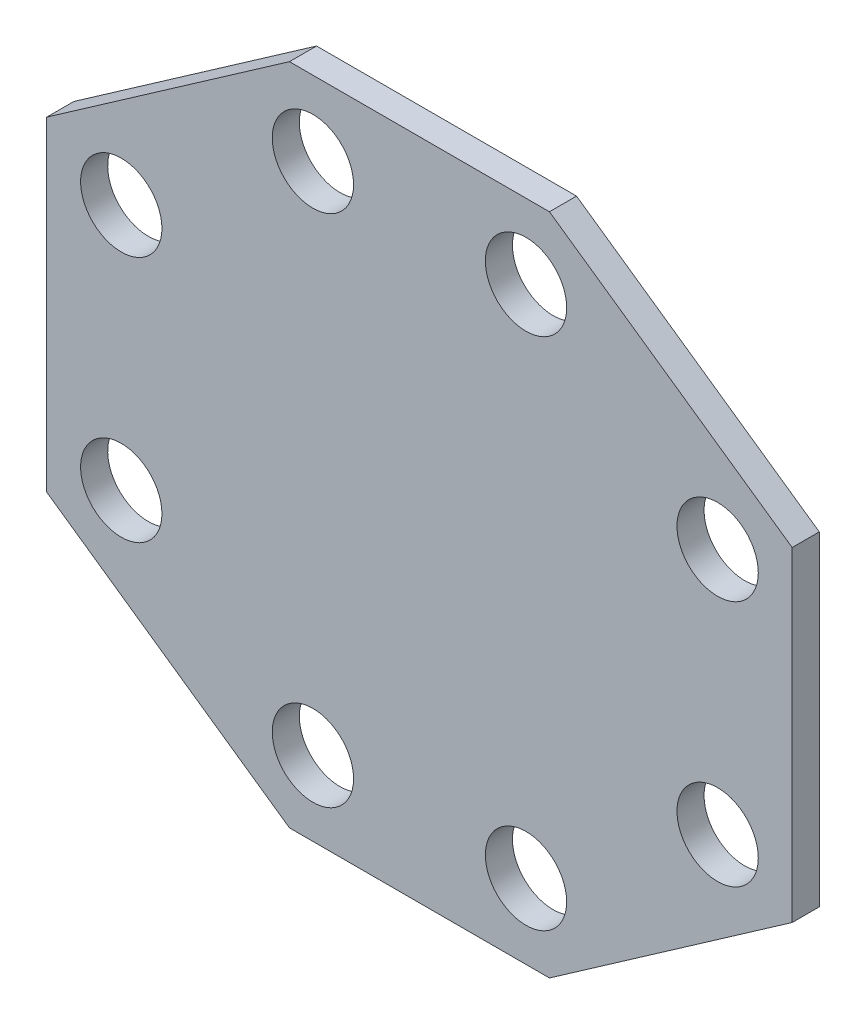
ISO-10303-21;
HEADER;
FILE_DESCRIPTION(('STEP AP214'),'2;1');
FILE_NAME('part.step','',(''),(''),'','','');
FILE_SCHEMA(('AUTOMOTIVE_DESIGN { 1 0 10303 214 1 1 1 1 }'));
ENDSEC;
DATA;
#1=APPLICATION_CONTEXT('core data for automotive mechanical design processes');
#2=APPLICATION_PROTOCOL_DEFINITION('international standard','automotive_design',2000,#1);
#3=PRODUCT_CONTEXT('',#1,'mechanical');
#4=PRODUCT('Part','Part','',(#3));
#5=PRODUCT_RELATED_PRODUCT_CATEGORY('part','',(#4));
#6=PRODUCT_DEFINITION_FORMATION('','',#4);
#7=PRODUCT_DEFINITION_CONTEXT('part definition',#1,'design');
#8=PRODUCT_DEFINITION('design','',#6,#7);
#9=PRODUCT_DEFINITION_SHAPE('','',#8);
#10=(LENGTH_UNIT() NAMED_UNIT(*) SI_UNIT(.MILLI.,.METRE.));
#11=(NAMED_UNIT(*) PLANE_ANGLE_UNIT() SI_UNIT($,.RADIAN.));
#12=(NAMED_UNIT(*) SI_UNIT($,.STERADIAN.) SOLID_ANGLE_UNIT());
#13=UNCERTAINTY_MEASURE_WITH_UNIT(LENGTH_MEASURE(1.E-05),#10,'distance_accuracy_value','');
#14=(GEOMETRIC_REPRESENTATION_CONTEXT(3) GLOBAL_UNCERTAINTY_ASSIGNED_CONTEXT((#13)) GLOBAL_UNIT_ASSIGNED_CONTEXT((#10,
#11,#12)) REPRESENTATION_CONTEXT('',''));
#15=CARTESIAN_POINT('',(0.,0.,0.));
#16=DIRECTION('',(0.,0.,1.));
#17=DIRECTION('',(1.,0.,0.));
#18=AXIS2_PLACEMENT_3D('',#15,#16,#17);
#19=CARTESIAN_POINT('',(0.,0.,0.));
#20=DIRECTION('',(0.,0.,-1.));
#21=DIRECTION('',(-1.,0.,0.));
#22=AXIS2_PLACEMENT_3D('',#19,#20,#21);
#23=PLANE('',#22);
#24=CARTESIAN_POINT('',(206.908610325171,-361.549268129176,0.));
#25=CARTESIAN_POINT('',(206.908689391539,-360.613056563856,0.));
#26=CARTESIAN_POINT('',(206.885827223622,-359.676831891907,0.));
#27=CARTESIAN_POINT('',(206.79423791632,-357.80887505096,0.));
#28=CARTESIAN_POINT('',(206.72562058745,-356.877137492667,0.));
#29=CARTESIAN_POINT('',(206.542537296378,-355.018152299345,0.));
#30=CARTESIAN_POINT('',(206.428070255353,-354.090904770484,0.));
#31=CARTESIAN_POINT('',(206.153428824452,-352.24089622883,0.));
#32=CARTESIAN_POINT('',(205.993143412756,-351.318151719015,0.));
#33=CARTESIAN_POINT('',(205.62785398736,-349.481657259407,0.));
#34=CARTESIAN_POINT('',(205.422854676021,-348.567906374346,0.));
#35=CARTESIAN_POINT('',(204.968665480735,-346.753746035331,0.));
#36=CARTESIAN_POINT('',(204.719581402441,-345.85331011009,0.));
#37=CARTESIAN_POINT('',(204.177334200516,-344.065763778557,0.));
#38=CARTESIAN_POINT('',(203.884169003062,-343.178654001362,0.));
#39=CARTESIAN_POINT('',(203.253872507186,-341.41773145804,0.));
#40=CARTESIAN_POINT('',(202.916634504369,-340.54395690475,0.));
#41=CARTESIAN_POINT('',(202.200067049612,-338.813984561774,0.));
#42=CARTESIAN_POINT('',(201.820743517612,-337.957784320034,0.));
#43=CARTESIAN_POINT('',(201.021356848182,-336.267090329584,0.));
#44=CARTESIAN_POINT('',(200.60139232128,-335.43254997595,0.));
#45=CARTESIAN_POINT('',(199.720831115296,-333.785138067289,0.));
#46=CARTESIAN_POINT('',(199.260232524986,-332.972267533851,0.));
#47=CARTESIAN_POINT('',(198.298508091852,-331.368145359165,0.));
#48=CARTESIAN_POINT('',(197.797285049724,-330.576952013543,0.));
#49=CARTESIAN_POINT('',(196.756985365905,-329.02001598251,0.));
#50=CARTESIAN_POINT('',(196.21791405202,-328.254269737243,0.));
#51=CARTESIAN_POINT('',(195.104049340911,-326.752014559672,0.));
#52=CARTESIAN_POINT('',(194.529343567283,-326.015440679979,0.));
#53=CARTESIAN_POINT('',(193.344307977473,-324.571472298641,0.));
#54=CARTESIAN_POINT('',(192.733976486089,-323.864079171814,0.));
#55=CARTESIAN_POINT('',(191.47778260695,-322.478402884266,0.));
#56=CARTESIAN_POINT('',(190.831836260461,-321.800195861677,0.));
#57=CARTESIAN_POINT('',(189.507782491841,-320.476128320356,0.));
#58=CARTESIAN_POINT('',(188.829679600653,-319.830263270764,0.));
#59=CARTESIAN_POINT('',(187.444142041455,-318.574177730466,0.));
#60=CARTESIAN_POINT('',(186.736780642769,-317.963876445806,0.));
#61=CARTESIAN_POINT('',(185.292810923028,-316.778842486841,0.));
#62=CARTESIAN_POINT('',(184.556201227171,-316.204111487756,0.));
#63=CARTESIAN_POINT('',(183.053812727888,-315.090131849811,0.));
#64=CARTESIAN_POINT('',(182.287966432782,-314.550974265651,0.));
#65=CARTESIAN_POINT('',(180.731041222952,-313.510658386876,0.));
#66=CARTESIAN_POINT('',(179.939965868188,-313.00949476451,0.));
#67=CARTESIAN_POINT('',(178.336000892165,-312.047849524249,0.));
#68=CARTESIAN_POINT('',(177.523167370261,-311.587274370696,0.));
#69=CARTESIAN_POINT('',(175.875754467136,-310.706715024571,0.));
#70=CARTESIAN_POINT('',(175.041174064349,-310.286732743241,0.));
#71=CARTESIAN_POINT('',(173.350326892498,-309.487259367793,0.));
#72=CARTESIAN_POINT('',(172.494011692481,-309.107870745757,0.));
#73=CARTESIAN_POINT('',(170.764046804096,-308.391285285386,0.));
#74=CARTESIAN_POINT('',(169.89039956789,-308.054082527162,0.));
#75=CARTESIAN_POINT('',(168.129646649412,-307.423833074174,0.));
#76=CARTESIAN_POINT('',(167.242577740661,-307.13068369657,0.));
#77=CARTESIAN_POINT('',(165.45503080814,-306.588438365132,0.));
#78=CARTESIAN_POINT('',(164.554552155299,-306.339344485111,0.));
#79=CARTESIAN_POINT('',(162.7402246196,-305.885100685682,0.));
#80=CARTESIAN_POINT('',(161.826348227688,-305.680060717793,0.));
#81=CARTESIAN_POINT('',(159.989825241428,-305.314743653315,0.));
#82=CARTESIAN_POINT('',(159.067179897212,-305.154460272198,0.));
#83=CARTESIAN_POINT('',(157.217303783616,-304.879826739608,0.));
#84=CARTESIAN_POINT('',(156.290089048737,-304.765368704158,0.));
#85=CARTESIAN_POINT('',(154.431102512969,-304.582275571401,0.));
#86=CARTESIAN_POINT('',(153.499330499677,-304.513642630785,0.));
#87=CARTESIAN_POINT('',(151.631246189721,-304.422084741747,0.));
#88=CARTESIAN_POINT('',(150.694928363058,-304.399272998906,0.));
#89=CARTESIAN_POINT('',(148.822423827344,-304.399263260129,0.));
#90=CARTESIAN_POINT('',(147.886237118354,-304.422058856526,0.));
#91=CARTESIAN_POINT('',(146.018327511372,-304.513595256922,0.));
#92=CARTESIAN_POINT('',(145.086599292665,-304.582227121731,0.));
#93=CARTESIAN_POINT('',(143.227612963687,-304.765322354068,0.));
#94=CARTESIAN_POINT('',(142.300355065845,-304.879787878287,0.));
#95=CARTESIAN_POINT('',(140.450303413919,-305.154434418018,0.));
#96=CARTESIAN_POINT('',(139.527526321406,-305.314727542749,0.));
#97=CARTESIAN_POINT('',(137.690999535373,-305.680025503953,0.));
#98=CARTESIAN_POINT('',(136.777248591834,-305.88502405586,0.));
#99=CARTESIAN_POINT('',(134.963088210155,-306.339212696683,0.));
#100=CARTESIAN_POINT('',(134.062652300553,-306.588296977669,0.));
#101=CARTESIAN_POINT('',(132.275105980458,-307.130544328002,0.));
#102=CARTESIAN_POINT('',(131.387996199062,-307.423709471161,0.));
#103=CARTESIAN_POINT('',(129.627073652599,-308.054005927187,0.));
#104=CARTESIAN_POINT('',(128.753299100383,-308.39124394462,0.));
#105=CARTESIAN_POINT('',(127.023326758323,-309.107811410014,0.));
#106=CARTESIAN_POINT('',(126.167126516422,-309.487134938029,0.));
#107=CARTESIAN_POINT('',(124.476432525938,-310.286521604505,0.));
#108=CARTESIAN_POINT('',(123.641892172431,-310.706486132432,0.));
#109=CARTESIAN_POINT('',(121.994480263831,-311.587047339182,0.));
#110=CARTESIAN_POINT('',(121.181609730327,-312.047645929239,0.));
#111=CARTESIAN_POINT('',(119.577487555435,-313.009370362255,0.));
#112=CARTESIAN_POINT('',(118.786294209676,-313.510593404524,0.));
#113=CARTESIAN_POINT('',(117.229358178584,-314.550893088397,0.));
#114=CARTESIAN_POINT('',(116.463611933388,-315.089964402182,0.));
#115=CARTESIAN_POINT('',(114.961356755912,-316.203829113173,0.));
#116=CARTESIAN_POINT('',(114.224782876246,-316.778534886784,0.));
#117=CARTESIAN_POINT('',(112.780814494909,-317.9635704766,0.));
#118=CARTESIAN_POINT('',(112.073421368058,-318.573901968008,0.));
#119=CARTESIAN_POINT('',(110.687745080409,-319.830095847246,0.));
#120=CARTESIAN_POINT('',(110.009538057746,-320.47604219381,0.));
#121=CARTESIAN_POINT('',(108.685470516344,-321.800095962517,0.));
#122=CARTESIAN_POINT('',(108.039605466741,-322.478198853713,0.));
#123=CARTESIAN_POINT('',(106.78351992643,-323.863736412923,0.));
#124=CARTESIAN_POINT('',(106.173218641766,-324.571097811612,0.));
#125=CARTESIAN_POINT('',(104.988184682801,-326.015067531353,0.));
#126=CARTESIAN_POINT('',(104.413453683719,-326.751677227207,0.));
#127=CARTESIAN_POINT('',(103.299474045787,-328.254065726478,0.));
#128=CARTESIAN_POINT('',(102.760316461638,-329.019912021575,0.));
#129=CARTESIAN_POINT('',(101.720000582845,-330.576837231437,0.));
#130=CARTESIAN_POINT('',(101.218836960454,-331.367912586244,0.));
#131=CARTESIAN_POINT('',(100.257191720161,-332.971877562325,0.));
#132=CARTESIAN_POINT('',(99.7966165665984,-333.784711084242,0.));
#133=CARTESIAN_POINT('',(98.916057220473,-335.432123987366,0.));
#134=CARTESIAN_POINT('',(98.4960749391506,-336.266704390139,0.));
#135=CARTESIAN_POINT('',(97.6966015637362,-337.957551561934,0.));
#136=CARTESIAN_POINT('',(97.3172129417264,-338.813866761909,0.));
#137=CARTESIAN_POINT('',(96.6006274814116,-340.543831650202,0.));
#138=CARTESIAN_POINT('',(96.2634247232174,-341.417478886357,0.));
#139=CARTESIAN_POINT('',(95.6331752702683,-343.178231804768,0.));
#140=CARTESIAN_POINT('',(95.3400258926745,-344.065300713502,0.));
#141=CARTESIAN_POINT('',(94.7977805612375,-345.852847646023,0.));
#142=CARTESIAN_POINT('',(94.5486866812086,-346.753326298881,0.));
#143=CARTESIAN_POINT('',(94.0944428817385,-348.567653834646,0.));
#144=CARTESIAN_POINT('',(93.8894029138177,-349.481530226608,0.));
#145=CARTESIAN_POINT('',(93.5240858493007,-351.318053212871,0.));
#146=CARTESIAN_POINT('',(93.3638024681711,-352.24069855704,0.));
#147=CARTESIAN_POINT('',(93.0891689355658,-354.090574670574,0.));
#148=CARTESIAN_POINT('',(92.9747109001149,-355.017789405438,0.));
#149=CARTESIAN_POINT('',(92.7916177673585,-356.876775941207,0.));
#150=CARTESIAN_POINT('',(92.7229848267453,-357.808547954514,0.));
#151=CARTESIAN_POINT('',(92.6314269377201,-359.676632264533,0.));
#152=CARTESIAN_POINT('',(92.6086151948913,-360.612950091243,0.));
#153=CARTESIAN_POINT('',(92.6086054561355,-362.48545462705,0.));
#154=CARTESIAN_POINT('',(92.6314010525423,-363.421641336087,0.));
#155=CARTESIAN_POINT('',(92.7229374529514,-365.28955094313,0.));
#156=CARTESIAN_POINT('',(92.7915693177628,-366.221279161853,0.));
#157=CARTESIAN_POINT('',(92.9746645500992,-368.080265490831,0.));
#158=CARTESIAN_POINT('',(93.089130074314,-369.007523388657,0.));
#159=CARTESIAN_POINT('',(93.363776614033,-370.857575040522,0.));
#160=CARTESIAN_POINT('',(93.5240697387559,-371.780352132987,0.));
#161=CARTESIAN_POINT('',(93.8893676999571,-373.616878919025,0.));
#162=CARTESIAN_POINT('',(94.0943662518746,-374.530629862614,0.));
#163=CARTESIAN_POINT('',(94.5485548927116,-376.344790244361,0.));
#164=CARTESIAN_POINT('',(94.7976391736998,-377.24522615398,0.));
#165=CARTESIAN_POINT('',(95.3398865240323,-379.032772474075,0.));
#166=CARTESIAN_POINT('',(95.6330516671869,-379.919882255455,0.));
#167=CARTESIAN_POINT('',(96.2633481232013,-381.68080480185,0.));
#168=CARTESIAN_POINT('',(96.6005861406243,-382.554579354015,0.));
#169=CARTESIAN_POINT('',(97.3171536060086,-384.284551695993,0.));
#170=CARTESIAN_POINT('',(97.6964771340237,-385.140751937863,0.));
#171=CARTESIAN_POINT('',(98.4958638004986,-386.831445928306,0.));
#172=CARTESIAN_POINT('',(98.9158283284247,-387.665986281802,0.));
#173=CARTESIAN_POINT('',(99.7963895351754,-389.313398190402,0.));
#174=CARTESIAN_POINT('',(100.256988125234,-390.126268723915,0.));
#175=CARTESIAN_POINT('',(101.21871255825,-391.730390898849,0.));
#176=CARTESIAN_POINT('',(101.719935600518,-392.52158424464,0.));
#177=CARTESIAN_POINT('',(102.760235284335,-394.078520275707,0.));
#178=CARTESIAN_POINT('',(103.299306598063,-394.844266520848,0.));
#179=CARTESIAN_POINT('',(104.413171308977,-396.346521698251,0.));
#180=CARTESIAN_POINT('',(104.987877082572,-397.083095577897,0.));
#181=CARTESIAN_POINT('',(106.172912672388,-398.527063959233,0.));
#182=CARTESIAN_POINT('',(106.783244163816,-399.234457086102,0.));
#183=CARTESIAN_POINT('',(108.039438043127,-400.620133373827,0.));
#184=CARTESIAN_POINT('',(108.685384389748,-401.298340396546,0.));
#185=CARTESIAN_POINT('',(110.009438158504,-402.622407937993,0.));
#186=CARTESIAN_POINT('',(110.68754104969,-403.268272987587,0.));
#187=CARTESIAN_POINT('',(112.073078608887,-404.524358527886,0.));
#188=CARTESIAN_POINT('',(112.780440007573,-405.134659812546,0.));
#189=CARTESIAN_POINT('',(114.224409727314,-406.319693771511,0.));
#190=CARTESIAN_POINT('',(114.961019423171,-406.894424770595,0.));
#191=CARTESIAN_POINT('',(116.463407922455,-408.008404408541,0.));
#192=CARTESIAN_POINT('',(117.229254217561,-408.5475619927,0.));
#193=CARTESIAN_POINT('',(118.786179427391,-409.587877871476,0.));
#194=CARTESIAN_POINT('',(119.577254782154,-410.089041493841,0.));
#195=CARTESIAN_POINT('',(121.181219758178,-411.050686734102,0.));
#196=CARTESIAN_POINT('',(121.994053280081,-411.511261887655,0.));
#197=CARTESIAN_POINT('',(123.641466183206,-412.39182123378,0.));
#198=CARTESIAN_POINT('',(124.476046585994,-412.81180351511,0.));
#199=CARTESIAN_POINT('',(126.166893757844,-413.611276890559,0.));
#200=CARTESIAN_POINT('',(127.023208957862,-413.990665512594,0.));
#201=CARTESIAN_POINT('',(128.753173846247,-414.707250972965,0.));
#202=CARTESIAN_POINT('',(129.626821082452,-415.04445373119,0.));
#203=CARTESIAN_POINT('',(131.387574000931,-415.674703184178,0.));
#204=CARTESIAN_POINT('',(132.274642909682,-415.967852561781,0.));
#205=CARTESIAN_POINT('',(134.062189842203,-416.510097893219,0.));
#206=CARTESIAN_POINT('',(134.962668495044,-416.75919177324,0.));
#207=CARTESIAN_POINT('',(136.776996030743,-417.21343557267,0.));
#208=CARTESIAN_POINT('',(137.690872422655,-417.418475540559,0.));
#209=CARTESIAN_POINT('',(139.527395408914,-417.783792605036,0.));
#210=CARTESIAN_POINT('',(140.45004075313,-417.944075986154,0.));
#211=CARTESIAN_POINT('',(142.299916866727,-418.218709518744,0.));
#212=CARTESIAN_POINT('',(143.227131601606,-418.333167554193,0.));
#213=CARTESIAN_POINT('',(145.086118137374,-418.51626068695,0.));
#214=CARTESIAN_POINT('',(146.017890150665,-418.584893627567,0.));
#215=CARTESIAN_POINT('',(147.885974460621,-418.676451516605,0.));
#216=CARTESIAN_POINT('',(148.822292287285,-418.699263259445,0.));
#217=CARTESIAN_POINT('',(150.694796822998,-418.699272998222,0.));
#218=CARTESIAN_POINT('',(151.630983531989,-418.676477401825,0.));
#219=CARTESIAN_POINT('',(153.49889313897,-418.584941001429,0.));
#220=CARTESIAN_POINT('',(154.430621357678,-418.51630913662,0.));
#221=CARTESIAN_POINT('',(156.289607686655,-418.333213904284,0.));
#222=CARTESIAN_POINT('',(157.216865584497,-418.218748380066,0.));
#223=CARTESIAN_POINT('',(159.066917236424,-417.944101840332,0.));
#224=CARTESIAN_POINT('',(159.989694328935,-417.783808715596,0.));
#225=CARTESIAN_POINT('',(161.826221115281,-417.418510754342,0.));
#226=CARTESIAN_POINT('',(162.739972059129,-417.213512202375,0.));
#227=CARTESIAN_POINT('',(164.554132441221,-416.759323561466,0.));
#228=CARTESIAN_POINT('',(165.454568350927,-416.510239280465,0.));
#229=CARTESIAN_POINT('',(167.242114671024,-415.967991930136,0.));
#230=CARTESIAN_POINT('',(168.129224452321,-415.674826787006,0.));
#231=CARTESIAN_POINT('',(169.890146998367,-415.044530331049,0.));
#232=CARTESIAN_POINT('',(170.763921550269,-414.707292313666,0.));
#233=CARTESIAN_POINT('',(172.493893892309,-413.990724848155,0.));
#234=CARTESIAN_POINT('',(173.350094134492,-413.611401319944,0.));
#235=CARTESIAN_POINT('',(175.040788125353,-412.812014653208,0.));
#236=CARTESIAN_POINT('',(175.875328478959,-412.392050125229,0.));
#237=CARTESIAN_POINT('',(177.52274038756,-411.511488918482,0.));
#238=CARTESIAN_POINT('',(178.335610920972,-411.050890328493,0.));
#239=CARTESIAN_POINT('',(179.939733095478,-410.08916589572,0.));
#240=CARTESIAN_POINT('',(180.73092644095,-409.587942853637,0.));
#241=CARTESIAN_POINT('',(182.287862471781,-408.547643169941,0.));
#242=CARTESIAN_POINT('',(183.053608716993,-408.008571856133,0.));
#243=CARTESIAN_POINT('',(184.555863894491,-406.894707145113,0.));
#244=CARTESIAN_POINT('',(185.292437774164,-406.320001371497,0.));
#245=CARTESIAN_POINT('',(186.736406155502,-405.134965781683,0.));
#246=CARTESIAN_POINT('',(187.443799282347,-404.524634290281,0.));
#247=CARTESIAN_POINT('',(188.829475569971,-403.268440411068,0.));
#248=CARTESIAN_POINT('',(189.507682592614,-402.622494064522,0.));
#249=CARTESIAN_POINT('',(190.831750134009,-401.298440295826,0.));
#250=CARTESIAN_POINT('',(191.477615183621,-400.620337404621,0.));
#251=CARTESIAN_POINT('',(192.733700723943,-399.234799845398,0.));
#252=CARTESIAN_POINT('',(193.34400200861,-398.527438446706,0.));
#253=CARTESIAN_POINT('',(194.529035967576,-397.083468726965,0.));
#254=CARTESIAN_POINT('',(195.103766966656,-396.346859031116,0.));
#255=CARTESIAN_POINT('',(196.217746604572,-394.844470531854,0.));
#256=CARTESIAN_POINT('',(196.756904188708,-394.078624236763,0.));
#257=CARTESIAN_POINT('',(197.797220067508,-392.521699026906,0.));
#258=CARTESIAN_POINT('',(198.29838368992,-391.730623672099,0.));
#259=CARTESIAN_POINT('',(199.260028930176,-390.126658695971,0.));
#260=CARTESIAN_POINT('',(199.720604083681,-389.313825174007,0.));
#261=CARTESIAN_POINT('',(200.601163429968,-387.666412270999,0.));
#262=CARTESIAN_POINT('',(201.021145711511,-386.83183186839,0.));
#263=CARTESIAN_POINT('',(201.820619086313,-385.140984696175,0.));
#264=CARTESIAN_POINT('',(202.200007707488,-384.284669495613,0.));
#265=CARTESIAN_POINT('',(202.91659317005,-382.554704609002,0.));
#266=CARTESIAN_POINT('',(203.253795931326,-381.681057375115,0.));
#267=CARTESIAN_POINT('',(203.884045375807,-379.920304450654,0.));
#268=CARTESIAN_POINT('',(204.177194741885,-379.033235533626,0.));
#269=CARTESIAN_POINT('',(204.719440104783,-377.245688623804,0.));
#270=CARTESIAN_POINT('',(204.96853402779,-376.345210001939,0.));
#271=CARTESIAN_POINT('',(205.422777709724,-374.530882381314,0.));
#272=CARTESIAN_POINT('',(205.627817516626,-373.617005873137,0.));
#273=CARTESIAN_POINT('',(205.993141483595,-371.780450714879,0.));
#274=CARTESIAN_POINT('',(206.153430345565,-370.857773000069,0.));
#275=CARTESIAN_POINT('',(206.428075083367,-369.007853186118,0.));
#276=CARTESIAN_POINT('',(206.542539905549,-368.0806272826,0.));
#277=CARTESIAN_POINT('',(206.725622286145,-366.221641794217,0.));
#278=CARTESIAN_POINT('',(206.794238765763,-365.289882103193,0.));
#279=CARTESIAN_POINT('',(206.885828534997,-363.421836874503,0.));
#280=CARTESIAN_POINT('',(206.908689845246,-362.485545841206,0.));
#281=CARTESIAN_POINT('',(206.908610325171,-361.549268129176,0.));
#282=B_SPLINE_CURVE_WITH_KNOTS('',3,(#24,#25,#26,#27,#28,#29,#30,#31,#32,#33,#34,#35,#36,#37,
#38,#39,#40,#41,#42,#43,#44,#45,#46,#47,#48,#49,#50,#51,#52,#53,#54,#55,#56,#57,#58,#59,#60,#61,
#62,#63,#64,#65,#66,#67,#68,#69,#70,#71,#72,#73,#74,#75,#76,#77,#78,#79,#80,#81,#82,#83,#84,#85,
#86,#87,#88,#89,#90,#91,#92,#93,#94,#95,#96,#97,#98,#99,#100,#101,#102,#103,#104,#105,#106,#107,
#108,#109,#110,#111,#112,#113,#114,#115,#116,#117,#118,#119,#120,#121,#122,#123,#124,#125,#126,
#127,#128,#129,#130,#131,#132,#133,#134,#135,#136,#137,#138,#139,#140,#141,#142,#143,#144,#145,
#146,#147,#148,#149,#150,#151,#152,#153,#154,#155,#156,#157,#158,#159,#160,#161,#162,#163,#164,
#165,#166,#167,#168,#169,#170,#171,#172,#173,#174,#175,#176,#177,#178,#179,#180,#181,#182,#183,
#184,#185,#186,#187,#188,#189,#190,#191,#192,#193,#194,#195,#196,#197,#198,#199,#200,#201,#202,
#203,#204,#205,#206,#207,#208,#209,#210,#211,#212,#213,#214,#215,#216,#217,#218,#219,#220,#221,
#222,#223,#224,#225,#226,#227,#228,#229,#230,#231,#232,#233,#234,#235,#236,#237,#238,#239,#240,
#241,#242,#243,#244,#245,#246,#247,#248,#249,#250,#251,#252,#253,#254,#255,#256,#257,#258,#259,
#260,#261,#262,#263,#264,#265,#266,#267,#268,#269,#270,#271,#272,#273,#274,#275,#276,#277,#278,
#279,#280,#281),.UNSPECIFIED.,.F.,.F.,(4,2,2,2,2,2,2,2,2,2,2,2,2,2,2,2,2,2,2,2,2,2,2,2,2,2,2,2,
2,2,2,2,2,2,2,2,2,2,2,2,2,2,2,2,2,2,2,2,2,2,2,2,2,2,2,2,2,2,2,2,2,2,2,2,2,2,2,2,2,2,2,2,2,2,2,2,
2,2,2,2,2,2,2,2,2,2,2,2,2,2,2,2,2,2,2,2,2,2,2,2,2,2,2,2,2,2,2,2,2,2,2,2,2,2,2,2,2,2,2,2,2,2,2,2,
2,2,2,2,4),(0.,2.80837150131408,5.6100271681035,8.41174876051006,11.2203175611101,
14.0285911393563,16.8302139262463,19.6319685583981,22.4406367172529,25.2489102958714,
28.0505330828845,30.8522877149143,33.6609558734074,36.4692294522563,39.2708522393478,
42.0726068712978,44.881275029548,47.6895486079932,50.4911713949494,53.292926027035,
56.1015941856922,58.9098677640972,61.7114905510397,64.5132451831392,67.3219133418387,
70.130186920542,72.9318097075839,75.7335643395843,78.5422324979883,81.3505060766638,
84.1521288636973,86.9538834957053,89.7625516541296,92.5708252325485,95.3724480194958,
98.1742026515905,100.982870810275,103.791144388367,106.592767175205,109.394521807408,
112.203189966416,115.011463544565,117.813086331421,120.614840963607,123.423509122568,
126.231782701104,129.033405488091,131.835160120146,134.643828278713,137.452101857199,
140.253724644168,143.05547927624,145.864147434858,148.672421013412,151.474043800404,
154.275798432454,157.084466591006,159.892740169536,162.694362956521,165.496117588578,
168.304785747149,171.113059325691,173.914682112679,176.716436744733,179.525104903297,
182.333378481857,185.135001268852,187.936755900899,190.745424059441,193.553697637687,
196.355320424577,199.157075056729,201.965743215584,204.774016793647,207.575639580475,
210.377394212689,213.186062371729,215.994335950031,218.795958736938,221.597713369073,
224.406381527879,227.214655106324,230.01627789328,232.818032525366,235.626700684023,
238.434974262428,241.23659704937,244.03835168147,246.847019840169,249.655293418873,
252.456916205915,255.258670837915,258.067338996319,260.875612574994,263.677235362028,
266.478989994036,269.28765815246,272.095931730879,274.897554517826,277.699309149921,
280.507977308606,283.316250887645,286.117873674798,288.919628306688,291.728296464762,
294.536570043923,297.33819283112,300.139947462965,302.9486156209,305.756889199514,
308.558511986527,311.360266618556,314.168934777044,316.977208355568,319.77883114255,
322.58058577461,325.389253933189,328.197527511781,330.999150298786,333.800904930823,
336.609573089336,339.417846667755,342.219469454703,345.021224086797,347.829892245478,
350.638265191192,353.439921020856,356.241642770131,359.050212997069),.UNSPECIFIED.);
#283=CARTESIAN_POINT('',(206.908610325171,-361.549268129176,0.));
#284=VERTEX_POINT('',#283);
#285=EDGE_CURVE('E270',#284,#284,#282,.T.);
#286=ORIENTED_EDGE('',*,*,#285,.T.);
#287=EDGE_LOOP('',(#286));
#288=FACE_BOUND('',#287,.T.);
#289=CARTESIAN_POINT('',(476.230268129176,173.588730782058,0.));
#290=CARTESIAN_POINT('',(476.230347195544,174.524942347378,0.));
#291=CARTESIAN_POINT('',(476.207485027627,175.461167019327,0.));
#292=CARTESIAN_POINT('',(476.115895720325,177.329123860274,0.));
#293=CARTESIAN_POINT('',(476.047278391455,178.260861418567,0.));
#294=CARTESIAN_POINT('',(475.864195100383,180.119846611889,0.));
#295=CARTESIAN_POINT('',(475.749728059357,181.04709414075,0.));
#296=CARTESIAN_POINT('',(475.475086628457,182.897102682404,0.));
#297=CARTESIAN_POINT('',(475.314801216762,183.819847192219,0.));
#298=CARTESIAN_POINT('',(474.949511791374,185.656341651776,0.));
#299=CARTESIAN_POINT('',(474.744512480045,186.570092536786,0.));
#300=CARTESIAN_POINT('',(474.290323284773,188.384252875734,0.));
#301=CARTESIAN_POINT('',(474.041239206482,189.284688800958,0.));
#302=CARTESIAN_POINT('',(473.498992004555,191.07223513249,0.));
#303=CARTESIAN_POINT('',(473.205826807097,191.959344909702,0.));
#304=CARTESIAN_POINT('',(472.57553031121,193.720267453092,0.));
#305=CARTESIAN_POINT('',(472.238292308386,194.594042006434,0.));
#306=CARTESIAN_POINT('',(471.521724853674,196.324014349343,0.));
#307=CARTESIAN_POINT('',(471.142401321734,197.180214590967,0.));
#308=CARTESIAN_POINT('',(470.343014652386,198.870908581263,0.));
#309=CARTESIAN_POINT('',(469.923050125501,199.705448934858,0.));
#310=CARTESIAN_POINT('',(469.042488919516,201.352860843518,0.));
#311=CARTESIAN_POINT('',(468.581890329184,202.165731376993,0.));
#312=CARTESIAN_POINT('',(467.620165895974,203.769853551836,0.));
#313=CARTESIAN_POINT('',(467.11894285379,204.561046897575,0.));
#314=CARTESIAN_POINT('',(466.078643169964,206.117982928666,0.));
#315=CARTESIAN_POINT('',(465.539571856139,206.883729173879,0.));
#316=CARTESIAN_POINT('',(464.425707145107,208.385984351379,0.));
#317=CARTESIAN_POINT('',(463.851001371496,209.122558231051,0.));
#318=CARTESIAN_POINT('',(462.665965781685,210.566526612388,0.));
#319=CARTESIAN_POINT('',(462.055634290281,211.273919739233,0.));
#320=CARTESIAN_POINT('',(460.799440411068,212.659596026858,0.));
#321=CARTESIAN_POINT('',(460.153494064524,213.337803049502,0.));
#322=CARTESIAN_POINT('',(458.829440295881,214.661870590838,0.));
#323=CARTESIAN_POINT('',(458.151337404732,215.307735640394,0.));
#324=CARTESIAN_POINT('',(456.765799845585,216.563821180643,0.));
#325=CARTESIAN_POINT('',(456.058438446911,217.17412246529,0.));
#326=CARTESIAN_POINT('',(454.614468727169,218.359156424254,0.));
#327=CARTESIAN_POINT('',(453.877859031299,218.93388742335,0.));
#328=CARTESIAN_POINT('',(452.375470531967,220.047867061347,0.));
#329=CARTESIAN_POINT('',(451.609624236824,220.587024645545,0.));
#330=CARTESIAN_POINT('',(450.052699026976,221.627340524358,0.));
#331=CARTESIAN_POINT('',(449.261623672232,222.128504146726,0.));
#332=CARTESIAN_POINT('',(447.657658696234,223.090149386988,0.));
#333=CARTESIAN_POINT('',(446.844825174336,223.55072454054,0.));
#334=CARTESIAN_POINT('',(445.197412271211,224.431283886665,0.));
#335=CARTESIAN_POINT('',(444.362831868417,224.851266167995,0.));
#336=CARTESIAN_POINT('',(442.671984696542,225.650739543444,0.));
#337=CARTESIAN_POINT('',(441.815669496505,226.030128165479,0.));
#338=CARTESIAN_POINT('',(440.08570460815,226.746713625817,0.));
#339=CARTESIAN_POINT('',(439.212057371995,227.083916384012,0.));
#340=CARTESIAN_POINT('',(437.451304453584,227.714165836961,0.));
#341=CARTESIAN_POINT('',(436.56423554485,228.007315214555,0.));
#342=CARTESIAN_POINT('',(434.776688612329,228.549560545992,0.));
#343=CARTESIAN_POINT('',(433.876209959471,228.798654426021,0.));
#344=CARTESIAN_POINT('',(432.061882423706,229.252898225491,0.));
#345=CARTESIAN_POINT('',(431.148006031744,229.457938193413,0.));
#346=CARTESIAN_POINT('',(429.311483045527,229.823255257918,0.));
#347=CARTESIAN_POINT('',(428.388837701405,229.983538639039,0.));
#348=CARTESIAN_POINT('',(426.538961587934,230.258172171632,0.));
#349=CARTESIAN_POINT('',(425.611746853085,230.372630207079,0.));
#350=CARTESIAN_POINT('',(423.752760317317,230.555723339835,0.));
#351=CARTESIAN_POINT('',(422.820988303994,230.62435628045,0.));
#352=CARTESIAN_POINT('',(420.952903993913,230.715914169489,0.));
#353=CARTESIAN_POINT('',(420.016586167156,230.738725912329,0.));
#354=CARTESIAN_POINT('',(418.144081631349,230.738735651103,0.));
#355=CARTESIAN_POINT('',(417.207894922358,230.715940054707,0.));
#356=CARTESIAN_POINT('',(415.339985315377,230.624403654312,0.));
#357=CARTESIAN_POINT('',(414.40825709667,230.555771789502,0.));
#358=CARTESIAN_POINT('',(412.549270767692,230.372676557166,0.));
#359=CARTESIAN_POINT('',(411.62201286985,230.258211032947,0.));
#360=CARTESIAN_POINT('',(409.771961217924,229.983564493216,0.));
#361=CARTESIAN_POINT('',(408.849184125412,229.823271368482,0.));
#362=CARTESIAN_POINT('',(407.012657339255,229.457973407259,0.));
#363=CARTESIAN_POINT('',(406.098906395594,229.252974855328,0.));
#364=CARTESIAN_POINT('',(404.284746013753,228.798786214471,0.));
#365=CARTESIAN_POINT('',(403.384310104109,228.549701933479,0.));
#366=CARTESIAN_POINT('',(401.596763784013,228.007454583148,0.));
#367=CARTESIAN_POINT('',(400.709654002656,227.71428944,0.));
#368=CARTESIAN_POINT('',(398.948731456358,227.083992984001,0.));
#369=CARTESIAN_POINT('',(398.074956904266,226.746754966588,0.));
#370=CARTESIAN_POINT('',(396.344984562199,226.030187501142,0.));
#371=CARTESIAN_POINT('',(395.488784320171,225.650863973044,0.));
#372=CARTESIAN_POINT('',(393.798090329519,224.851477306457,0.));
#373=CARTESIAN_POINT('',(392.963549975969,224.431512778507,0.));
#374=CARTESIAN_POINT('',(391.316138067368,223.550951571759,0.));
#375=CARTESIAN_POINT('',(390.503267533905,223.090352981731,0.));
#376=CARTESIAN_POINT('',(388.899145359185,222.128628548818,0.));
#377=CARTESIAN_POINT('',(388.107952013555,221.627405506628,0.));
#378=CARTESIAN_POINT('',(386.551015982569,220.587105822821,0.));
#379=CARTESIAN_POINT('',(385.785269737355,220.048034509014,0.));
#380=CARTESIAN_POINT('',(384.283014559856,218.934169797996,0.));
#381=CARTESIAN_POINT('',(383.546440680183,218.35946402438,0.));
#382=CARTESIAN_POINT('',(382.102472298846,217.174428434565,0.));
#383=CARTESIAN_POINT('',(381.395079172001,216.564096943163,0.));
#384=CARTESIAN_POINT('',(380.009402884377,215.30790306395,0.));
#385=CARTESIAN_POINT('',(379.331195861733,214.661956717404,0.));
#386=CARTESIAN_POINT('',(378.00712832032,213.33790294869,0.));
#387=CARTESIAN_POINT('',(377.361263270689,212.659800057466,0.));
#388=CARTESIAN_POINT('',(376.105177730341,211.274262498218,0.));
#389=CARTESIAN_POINT('',(375.494876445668,210.56690109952,0.));
#390=CARTESIAN_POINT('',(374.309842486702,209.122931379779,0.));
#391=CARTESIAN_POINT('',(373.735111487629,208.386321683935,0.));
#392=CARTESIAN_POINT('',(372.621131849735,206.8839331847,0.));
#393=CARTESIAN_POINT('',(372.081974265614,206.118086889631,0.));
#394=CARTESIAN_POINT('',(371.041658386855,204.56116167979,0.));
#395=CARTESIAN_POINT('',(370.540494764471,203.770086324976,0.));
#396=CARTESIAN_POINT('',(369.578849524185,202.166121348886,0.));
#397=CARTESIAN_POINT('',(369.118274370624,201.353287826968,0.));
#398=CARTESIAN_POINT('',(368.237715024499,199.705874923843,0.));
#399=CARTESIAN_POINT('',(367.817732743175,198.871294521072,0.));
#400=CARTESIAN_POINT('',(367.018259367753,197.180447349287,0.));
#401=CARTESIAN_POINT('',(366.638870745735,196.32413214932,0.));
#402=CARTESIAN_POINT('',(365.922285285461,194.594167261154,0.));
#403=CARTESIAN_POINT('',(365.585082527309,193.720520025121,0.));
#404=CARTESIAN_POINT('',(364.954833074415,191.959767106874,0.));
#405=CARTESIAN_POINT('',(364.661683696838,191.072698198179,0.));
#406=CARTESIAN_POINT('',(364.119438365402,189.285151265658,0.));
#407=CARTESIAN_POINT('',(363.870344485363,188.384672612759,0.));
#408=CARTESIAN_POINT('',(363.416100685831,186.570345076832,0.));
#409=CARTESIAN_POINT('',(363.211060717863,185.656468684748,0.));
#410=CARTESIAN_POINT('',(362.845743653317,183.819945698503,0.));
#411=CARTESIAN_POINT('',(362.685460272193,182.897300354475,0.));
#412=CARTESIAN_POINT('',(362.410826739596,181.047424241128,0.));
#413=CARTESIAN_POINT('',(362.296368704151,180.12020950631,0.));
#414=CARTESIAN_POINT('',(362.113275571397,178.261222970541,0.));
#415=CARTESIAN_POINT('',(362.044642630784,177.329450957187,0.));
#416=CARTESIAN_POINT('',(361.953084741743,175.461366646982,0.));
#417=CARTESIAN_POINT('',(361.930272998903,174.525048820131,0.));
#418=CARTESIAN_POINT('',(361.930263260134,172.65254428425,0.));
#419=CARTESIAN_POINT('',(361.953058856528,171.716357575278,0.));
#420=CARTESIAN_POINT('',(362.044595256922,169.848447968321,0.));
#421=CARTESIAN_POINT('',(362.113227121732,168.91671974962,0.));
#422=CARTESIAN_POINT('',(362.29632235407,167.057733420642,0.));
#423=CARTESIAN_POINT('',(362.410787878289,166.130475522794,0.));
#424=CARTESIAN_POINT('',(362.685434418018,164.280423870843,0.));
#425=CARTESIAN_POINT('',(362.845727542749,163.357646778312,0.));
#426=CARTESIAN_POINT('',(363.211025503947,161.521119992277,0.));
#427=CARTESIAN_POINT('',(363.416024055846,160.607369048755,0.));
#428=CARTESIAN_POINT('',(363.870212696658,158.793208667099,0.));
#429=CARTESIAN_POINT('',(364.119296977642,157.892772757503,0.));
#430=CARTESIAN_POINT('',(364.661544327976,156.105226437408,0.));
#431=CARTESIAN_POINT('',(364.954709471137,155.218116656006,0.));
#432=CARTESIAN_POINT('',(365.585005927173,153.45719410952,0.));
#433=CARTESIAN_POINT('',(365.922243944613,152.583419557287,0.));
#434=CARTESIAN_POINT('',(366.638811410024,150.853447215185,0.));
#435=CARTESIAN_POINT('',(367.018134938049,149.997246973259,0.));
#436=CARTESIAN_POINT('',(367.817521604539,148.306552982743,0.));
#437=CARTESIAN_POINT('',(368.237486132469,147.472012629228,0.));
#438=CARTESIAN_POINT('',(369.118047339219,145.824600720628,0.));
#439=CARTESIAN_POINT('',(369.578645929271,145.011730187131,0.));
#440=CARTESIAN_POINT('',(370.540370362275,143.407608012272,0.));
#441=CARTESIAN_POINT('',(371.041593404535,142.616414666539,0.));
#442=CARTESIAN_POINT('',(372.081893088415,141.059478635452,0.));
#443=CARTESIAN_POINT('',(372.620964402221,140.293732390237,0.));
#444=CARTESIAN_POINT('',(373.734829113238,138.791477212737,0.));
#445=CARTESIAN_POINT('',(374.309534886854,138.054903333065,0.));
#446=CARTESIAN_POINT('',(375.49457047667,136.610934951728,0.));
#447=CARTESIAN_POINT('',(376.104901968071,135.903541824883,0.));
#448=CARTESIAN_POINT('',(377.361095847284,134.517865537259,0.));
#449=CARTESIAN_POINT('',(378.00704219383,133.839658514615,0.));
#450=CARTESIAN_POINT('',(379.331095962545,132.515590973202,0.));
#451=CARTESIAN_POINT('',(380.009198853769,131.869725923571,0.));
#452=CARTESIAN_POINT('',(381.394736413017,130.613640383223,0.));
#453=CARTESIAN_POINT('',(382.102097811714,130.00333909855,0.));
#454=CARTESIAN_POINT('',(383.546067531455,128.818305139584,0.));
#455=CARTESIAN_POINT('',(384.282677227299,128.243574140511,0.));
#456=CARTESIAN_POINT('',(385.785065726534,127.129594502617,0.));
#457=CARTESIAN_POINT('',(386.550912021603,126.590436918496,0.));
#458=CARTESIAN_POINT('',(388.107837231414,125.550121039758,0.));
#459=CARTESIAN_POINT('',(388.898912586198,125.048957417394,0.));
#460=CARTESIAN_POINT('',(390.502877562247,124.087312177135,0.));
#461=CARTESIAN_POINT('',(391.315711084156,123.626737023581,0.));
#462=CARTESIAN_POINT('',(392.96312398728,122.746177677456,0.));
#463=CARTESIAN_POINT('',(393.797704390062,122.326195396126,0.));
#464=CARTESIAN_POINT('',(395.488551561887,121.526722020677,0.));
#465=CARTESIAN_POINT('',(396.344866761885,121.14733339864,0.));
#466=CARTESIAN_POINT('',(398.074831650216,120.430747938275,0.));
#467=CARTESIAN_POINT('',(398.948478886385,120.093545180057,0.));
#468=CARTESIAN_POINT('',(400.709231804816,119.463295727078,0.));
#469=CARTESIAN_POINT('',(401.596300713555,119.170146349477,0.));
#470=CARTESIAN_POINT('',(403.383847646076,118.62790101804,0.));
#471=CARTESIAN_POINT('',(404.284326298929,118.378807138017,0.));
#472=CARTESIAN_POINT('',(406.098653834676,117.924563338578,0.));
#473=CARTESIAN_POINT('',(407.012530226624,117.719523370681,0.));
#474=CARTESIAN_POINT('',(408.849053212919,117.354206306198,0.));
#475=CARTESIAN_POINT('',(409.771698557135,117.19392292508,0.));
#476=CARTESIAN_POINT('',(411.621574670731,116.91928939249,0.));
#477=CARTESIAN_POINT('',(412.548789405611,116.804831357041,0.));
#478=CARTESIAN_POINT('',(414.407775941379,116.621738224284,0.));
#479=CARTESIAN_POINT('',(415.33954795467,116.553105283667,0.));
#480=CARTESIAN_POINT('',(417.207632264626,116.461547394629,0.));
#481=CARTESIAN_POINT('',(418.14395009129,116.43873565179,0.));
#482=CARTESIAN_POINT('',(420.01645462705,116.438725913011,0.));
#483=CARTESIAN_POINT('',(420.952641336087,116.461521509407,0.));
#484=CARTESIAN_POINT('',(422.820550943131,116.553057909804,0.));
#485=CARTESIAN_POINT('',(423.752279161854,116.621689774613,0.));
#486=CARTESIAN_POINT('',(425.611265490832,116.804785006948,0.));
#487=CARTESIAN_POINT('',(426.538523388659,116.919250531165,0.));
#488=CARTESIAN_POINT('',(428.388575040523,117.193897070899,0.));
#489=CARTESIAN_POINT('',(429.311352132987,117.354190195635,0.));
#490=CARTESIAN_POINT('',(431.147878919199,117.719488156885,0.));
#491=CARTESIAN_POINT('',(432.061629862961,117.924486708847,0.));
#492=CARTESIAN_POINT('',(433.875790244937,118.378675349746,0.));
#493=CARTESIAN_POINT('',(434.776226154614,118.627759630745,0.));
#494=CARTESIAN_POINT('',(436.563772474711,119.170006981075,0.));
#495=CARTESIAN_POINT('',(437.450882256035,119.463172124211,0.));
#496=CARTESIAN_POINT('',(439.211804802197,120.093468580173,0.));
#497=CARTESIAN_POINT('',(440.085579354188,120.430706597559,0.));
#498=CARTESIAN_POINT('',(441.815551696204,121.147274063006,0.));
#499=CARTESIAN_POINT('',(442.671751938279,121.526597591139,0.));
#500=CARTESIAN_POINT('',(444.362445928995,122.325984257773,0.));
#501=CARTESIAN_POINT('',(445.196986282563,122.745948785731,0.));
#502=CARTESIAN_POINT('',(446.844398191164,123.626509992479,0.));
#503=CARTESIAN_POINT('',(447.657268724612,124.087108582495,0.));
#504=CARTESIAN_POINT('',(449.261390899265,125.048833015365,0.));
#505=CARTESIAN_POINT('',(450.052584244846,125.550056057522,0.));
#506=CARTESIAN_POINT('',(451.609520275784,126.590355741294,0.));
#507=CARTESIAN_POINT('',(452.375266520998,127.129427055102,0.));
#508=CARTESIAN_POINT('',(453.877521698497,128.24329176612,0.));
#509=CARTESIAN_POINT('',(454.614095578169,128.817997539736,0.));
#510=CARTESIAN_POINT('',(456.058063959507,130.003033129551,0.));
#511=CARTESIAN_POINT('',(456.765457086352,130.613364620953,0.));
#512=CARTESIAN_POINT('',(458.151133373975,131.869558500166,0.));
#513=CARTESIAN_POINT('',(458.829340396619,132.515504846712,0.));
#514=CARTESIAN_POINT('',(460.153407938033,133.839558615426,0.));
#515=CARTESIAN_POINT('',(460.799272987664,134.51766150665,0.));
#516=CARTESIAN_POINT('',(462.055358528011,135.903199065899,0.));
#517=CARTESIAN_POINT('',(462.665659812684,136.610560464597,0.));
#518=CARTESIAN_POINT('',(463.850693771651,138.054530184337,0.));
#519=CARTESIAN_POINT('',(464.425424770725,138.79113988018,0.));
#520=CARTESIAN_POINT('',(465.539404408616,140.293528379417,0.));
#521=CARTESIAN_POINT('',(466.078561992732,141.05937467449,0.));
#522=CARTESIAN_POINT('',(467.118877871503,142.616299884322,0.));
#523=CARTESIAN_POINT('',(467.620041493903,143.407375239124,0.));
#524=CARTESIAN_POINT('',(468.581686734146,145.011340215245,0.));
#525=CARTESIAN_POINT('',(469.042261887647,145.824173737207,0.));
#526=CARTESIAN_POINT('',(469.922821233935,147.471586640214,0.));
#527=CARTESIAN_POINT('',(470.342803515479,148.306167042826,0.));
#528=CARTESIAN_POINT('',(471.142276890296,149.997014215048,0.));
#529=CARTESIAN_POINT('',(471.521665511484,150.853329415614,0.));
#530=CARTESIAN_POINT('',(472.238250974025,152.583294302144,0.));
#531=CARTESIAN_POINT('',(472.575453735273,153.456941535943,0.));
#532=CARTESIAN_POINT('',(473.205703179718,155.217694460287,0.));
#533=CARTESIAN_POINT('',(473.498852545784,156.104763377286,0.));
#534=CARTESIAN_POINT('',(474.041097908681,157.892310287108,0.));
#535=CARTESIAN_POINT('',(474.290191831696,158.792788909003,0.));
#536=CARTESIAN_POINT('',(474.744435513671,160.607116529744,0.));
#537=CARTESIAN_POINT('',(474.949475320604,161.520993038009,0.));
#538=CARTESIAN_POINT('',(475.314799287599,163.357548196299,0.));
#539=CARTESIAN_POINT('',(475.475088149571,164.280225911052,0.));
#540=CARTESIAN_POINT('',(475.749732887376,166.130145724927,0.));
#541=CARTESIAN_POINT('',(475.864197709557,167.057371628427,0.));
#542=CARTESIAN_POINT('',(476.047280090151,168.916357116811,0.));
#543=CARTESIAN_POINT('',(476.115896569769,169.848116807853,0.));
#544=CARTESIAN_POINT('',(476.207486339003,171.716162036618,0.));
#545=CARTESIAN_POINT('',(476.230347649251,172.652453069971,0.));
#546=CARTESIAN_POINT('',(476.230268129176,173.588730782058,0.));
#547=B_SPLINE_CURVE_WITH_KNOTS('',3,(#289,#290,#291,#292,#293,#294,#295,#296,#297,#298,#299,
#300,#301,#302,#303,#304,#305,#306,#307,#308,#309,#310,#311,#312,#313,#314,#315,#316,#317,#318,
#319,#320,#321,#322,#323,#324,#325,#326,#327,#328,#329,#330,#331,#332,#333,#334,#335,#336,#337,
#338,#339,#340,#341,#342,#343,#344,#345,#346,#347,#348,#349,#350,#351,#352,#353,#354,#355,#356,
#357,#358,#359,#360,#361,#362,#363,#364,#365,#366,#367,#368,#369,#370,#371,#372,#373,#374,#375,
#376,#377,#378,#379,#380,#381,#382,#383,#384,#385,#386,#387,#388,#389,#390,#391,#392,#393,#394,
#395,#396,#397,#398,#399,#400,#401,#402,#403,#404,#405,#406,#407,#408,#409,#410,#411,#412,#413,
#414,#415,#416,#417,#418,#419,#420,#421,#422,#423,#424,#425,#426,#427,#428,#429,#430,#431,#432,
#433,#434,#435,#436,#437,#438,#439,#440,#441,#442,#443,#444,#445,#446,#447,#448,#449,#450,#451,
#452,#453,#454,#455,#456,#457,#458,#459,#460,#461,#462,#463,#464,#465,#466,#467,#468,#469,#470,
#471,#472,#473,#474,#475,#476,#477,#478,#479,#480,#481,#482,#483,#484,#485,#486,#487,#488,#489,
#490,#491,#492,#493,#494,#495,#496,#497,#498,#499,#500,#501,#502,#503,#504,#505,#506,#507,#508,
#509,#510,#511,#512,#513,#514,#515,#516,#517,#518,#519,#520,#521,#522,#523,#524,#525,#526,#527,
#528,#529,#530,#531,#532,#533,#534,#535,#536,#537,#538,#539,#540,#541,#542,#543,#544,#545,#546),
.UNSPECIFIED.,.F.,.F.,(4,2,2,2,2,2,2,2,2,2,2,2,2,2,2,2,2,2,2,2,2,2,2,2,2,2,2,2,2,2,2,2,2,2,2,2,
2,2,2,2,2,2,2,2,2,2,2,2,2,2,2,2,2,2,2,2,2,2,2,2,2,2,2,2,2,2,2,2,2,2,2,2,2,2,2,2,2,2,2,2,2,2,2,2,
2,2,2,2,2,2,2,2,2,2,2,2,2,2,2,2,2,2,2,2,2,2,2,2,2,2,2,2,2,2,2,2,2,2,2,2,2,2,2,2,2,2,2,2,4),(0.,
2.80837150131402,5.61002716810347,8.41174876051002,11.2203175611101,14.0285911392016,
16.8302139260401,19.631968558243,22.4406367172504,25.2489102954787,28.0505330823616,
30.8522877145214,33.6609558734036,36.4692294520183,39.2708522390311,42.0726068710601,
44.8812750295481,47.6895486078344,50.4911713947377,53.2929260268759,56.1015941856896,
58.9098677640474,61.7114905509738,64.5132451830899,67.3219133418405,70.1301869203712,
72.9318097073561,75.733564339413,78.5422324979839,81.350506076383,84.1521288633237,
86.953883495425,89.7625516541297,92.5708252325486,95.372448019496,98.1742026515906,
100.982870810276,103.791144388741,106.592767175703,109.394521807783,112.203189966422,
115.011463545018,117.813086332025,120.61484096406,123.423509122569,126.231782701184,
129.033405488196,131.835160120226,134.643828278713,137.452101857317,140.253724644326,
143.05547927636,145.86414743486,148.672421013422,151.474043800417,154.275798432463,
157.084466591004,159.892740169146,162.694362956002,165.496117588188,168.304785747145,
171.113059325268,173.914682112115,176.71643674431,179.525104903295,182.333378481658,
185.135001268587,187.9367559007,190.74542405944,193.553697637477,196.355320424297,
199.157075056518,201.965743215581,204.774016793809,207.575639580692,210.377394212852,
213.186062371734,215.994335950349,218.795958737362,221.597713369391,224.406381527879,
227.214655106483,230.016277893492,232.818032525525,235.626700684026,238.434974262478,
241.236597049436,244.038351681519,246.847019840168,249.655293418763,252.456916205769,
255.258670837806,258.067338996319,260.875612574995,263.677235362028,266.478989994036,
269.28765815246,272.09593173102,274.897554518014,277.699309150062,280.507977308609,
283.316250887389,286.117873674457,288.919628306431,291.728296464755,294.536570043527,
297.338192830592,300.139947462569,302.9486156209,305.756889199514,308.558511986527,
311.360266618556,314.168934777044,316.977208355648,319.778831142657,322.58058577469,
325.389253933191,328.197527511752,330.999150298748,333.800904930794,336.609573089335,
339.417846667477,342.219469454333,345.021224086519,347.829892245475,350.638265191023,
353.439921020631,356.241642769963,359.050212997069),.UNSPECIFIED.);
#548=CARTESIAN_POINT('',(476.230268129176,173.588730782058,0.));
#549=VERTEX_POINT('',#548);
#550=EDGE_CURVE('E373',#549,#549,#547,.T.);
#551=ORIENTED_EDGE('',*,*,#550,.T.);
#552=EDGE_LOOP('',(#551));
#553=FACE_BOUND('',#552,.T.);
#554=CARTESIAN_POINT('',(-92.6086103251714,361.549268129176,0.));
#555=CARTESIAN_POINT('',(-92.6085312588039,362.485479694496,0.));
#556=CARTESIAN_POINT('',(-92.6313934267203,363.421704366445,0.));
#557=CARTESIAN_POINT('',(-92.722982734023,365.289661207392,0.));
#558=CARTESIAN_POINT('',(-92.7916000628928,366.221398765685,0.));
#559=CARTESIAN_POINT('',(-92.9746833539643,368.080383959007,0.));
#560=CARTESIAN_POINT('',(-93.0891503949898,369.007631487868,0.));
#561=CARTESIAN_POINT('',(-93.363791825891,370.857640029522,0.));
#562=CARTESIAN_POINT('',(-93.5240772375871,371.780384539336,0.));
#563=CARTESIAN_POINT('',(-93.8893666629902,373.616878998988,0.));
#564=CARTESIAN_POINT('',(-94.094365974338,374.530629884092,0.));
#565=CARTESIAN_POINT('',(-94.5485551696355,376.344790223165,0.));
#566=CARTESIAN_POINT('',(-94.7976392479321,377.24522614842,0.));
#567=CARTESIAN_POINT('',(-95.3398864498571,379.032772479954,0.));
#568=CARTESIAN_POINT('',(-95.6330516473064,379.919882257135,0.));
#569=CARTESIAN_POINT('',(-96.263348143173,381.680804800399,0.));
#570=CARTESIAN_POINT('',(-96.6005861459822,382.554579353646,0.));
#571=CARTESIAN_POINT('',(-97.3171536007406,384.284551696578,0.));
#572=CARTESIAN_POINT('',(-97.6964771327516,385.140751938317,0.));
#573=CARTESIAN_POINT('',(-98.4958638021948,386.831445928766,0.));
#574=CARTESIAN_POINT('',(-98.9158283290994,387.665986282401,0.));
#575=CARTESIAN_POINT('',(-99.796389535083,389.313398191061,0.));
#576=CARTESIAN_POINT('',(-100.25698812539,390.126268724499,0.));
#577=CARTESIAN_POINT('',(-101.218712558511,391.730390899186,0.));
#578=CARTESIAN_POINT('',(-101.719935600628,392.521584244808,0.));
#579=CARTESIAN_POINT('',(-102.760235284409,394.078520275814,0.));
#580=CARTESIAN_POINT('',(-103.299306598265,394.844266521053,0.));
#581=CARTESIAN_POINT('',(-104.413171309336,396.346521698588,0.));
#582=CARTESIAN_POINT('',(-104.987877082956,397.083095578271,0.));
#583=CARTESIAN_POINT('',(-106.172912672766,398.527063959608,0.));
#584=CARTESIAN_POINT('',(-106.78324416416,399.234457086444,0.));
#585=CARTESIAN_POINT('',(-108.039438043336,400.620133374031,0.));
#586=CARTESIAN_POINT('',(-108.685384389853,401.298340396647,0.));
#587=CARTESIAN_POINT('',(-110.009438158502,402.622407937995,0.));
#588=CARTESIAN_POINT('',(-110.68754104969,403.268272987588,0.));
#589=CARTESIAN_POINT('',(-112.073078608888,404.524358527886,0.));
#590=CARTESIAN_POINT('',(-112.780440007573,405.134659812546,0.));
#591=CARTESIAN_POINT('',(-114.224409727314,406.319693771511,0.));
#592=CARTESIAN_POINT('',(-114.961019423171,406.894424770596,0.));
#593=CARTESIAN_POINT('',(-116.463407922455,408.008404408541,0.));
#594=CARTESIAN_POINT('',(-117.229254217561,408.547561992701,0.));
#595=CARTESIAN_POINT('',(-118.786179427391,409.587877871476,0.));
#596=CARTESIAN_POINT('',(-119.577254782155,410.089041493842,0.));
#597=CARTESIAN_POINT('',(-121.181219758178,411.050686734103,0.));
#598=CARTESIAN_POINT('',(-121.994053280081,411.511261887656,0.));
#599=CARTESIAN_POINT('',(-123.641466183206,412.39182123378,0.));
#600=CARTESIAN_POINT('',(-124.476046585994,412.81180351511,0.));
#601=CARTESIAN_POINT('',(-126.166893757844,413.61127689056,0.));
#602=CARTESIAN_POINT('',(-127.023208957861,413.990665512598,0.));
#603=CARTESIAN_POINT('',(-128.753173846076,414.707250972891,0.));
#604=CARTESIAN_POINT('',(-129.626821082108,415.044453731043,0.));
#605=CARTESIAN_POINT('',(-131.387574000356,415.674703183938,0.));
#606=CARTESIAN_POINT('',(-132.27464290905,415.967852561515,0.));
#607=CARTESIAN_POINT('',(-134.062189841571,416.51009789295,0.));
#608=CARTESIAN_POINT('',(-134.962668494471,416.75919177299,0.));
#609=CARTESIAN_POINT('',(-136.776996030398,417.213435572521,0.));
#610=CARTESIAN_POINT('',(-137.690872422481,417.418475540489,0.));
#611=CARTESIAN_POINT('',(-139.527395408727,417.783792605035,0.));
#612=CARTESIAN_POINT('',(-140.450040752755,417.944075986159,0.));
#613=CARTESIAN_POINT('',(-142.299916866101,418.218709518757,0.));
#614=CARTESIAN_POINT('',(-143.227131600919,418.333167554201,0.));
#615=CARTESIAN_POINT('',(-145.086118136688,418.516260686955,0.));
#616=CARTESIAN_POINT('',(-146.017890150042,418.584893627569,0.));
#617=CARTESIAN_POINT('',(-147.885974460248,418.67645151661,0.));
#618=CARTESIAN_POINT('',(-148.822292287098,418.699263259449,0.));
#619=CARTESIAN_POINT('',(-150.694796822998,418.699272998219,0.));
#620=CARTESIAN_POINT('',(-151.630983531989,418.676477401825,0.));
#621=CARTESIAN_POINT('',(-153.49889313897,418.584941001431,0.));
#622=CARTESIAN_POINT('',(-154.430621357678,418.516309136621,0.));
#623=CARTESIAN_POINT('',(-156.289607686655,418.333213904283,0.));
#624=CARTESIAN_POINT('',(-157.216865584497,418.218748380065,0.));
#625=CARTESIAN_POINT('',(-159.066917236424,417.944101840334,0.));
#626=CARTESIAN_POINT('',(-159.989694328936,417.783808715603,0.));
#627=CARTESIAN_POINT('',(-161.82622111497,417.418510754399,0.));
#628=CARTESIAN_POINT('',(-162.739972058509,417.213512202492,0.));
#629=CARTESIAN_POINT('',(-164.554132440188,416.759323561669,0.));
#630=CARTESIAN_POINT('',(-165.45456834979,416.510239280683,0.));
#631=CARTESIAN_POINT('',(-167.242114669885,415.96799193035,0.));
#632=CARTESIAN_POINT('',(-168.129224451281,415.674826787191,0.));
#633=CARTESIAN_POINT('',(-169.890146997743,415.044530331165,0.));
#634=CARTESIAN_POINT('',(-170.76392154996,414.707292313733,0.));
#635=CARTESIAN_POINT('',(-172.493893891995,413.990724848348,0.));
#636=CARTESIAN_POINT('',(-173.350094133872,413.611401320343,0.));
#637=CARTESIAN_POINT('',(-175.040788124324,412.812014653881,0.));
#638=CARTESIAN_POINT('',(-175.875328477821,412.392050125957,0.));
#639=CARTESIAN_POINT('',(-177.522740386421,411.511488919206,0.));
#640=CARTESIAN_POINT('',(-178.335610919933,411.050890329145,0.));
#641=CARTESIAN_POINT('',(-179.939733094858,410.089165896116,0.));
#642=CARTESIAN_POINT('',(-180.730926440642,409.587942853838,0.));
#643=CARTESIAN_POINT('',(-182.28786247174,408.547643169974,0.));
#644=CARTESIAN_POINT('',(-183.053608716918,408.008571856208,0.));
#645=CARTESIAN_POINT('',(-184.55586389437,406.894707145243,0.));
#646=CARTESIAN_POINT('',(-185.292437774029,406.320001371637,0.));
#647=CARTESIAN_POINT('',(-186.736406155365,405.134965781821,0.));
#648=CARTESIAN_POINT('',(-187.443799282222,404.524634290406,0.));
#649=CARTESIAN_POINT('',(-188.829475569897,403.268440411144,0.));
#650=CARTESIAN_POINT('',(-189.507682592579,402.622494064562,0.));
#651=CARTESIAN_POINT('',(-190.83175013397,401.298440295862,0.));
#652=CARTESIAN_POINT('',(-191.477615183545,400.620337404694,0.));
#653=CARTESIAN_POINT('',(-192.733700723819,399.234799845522,0.));
#654=CARTESIAN_POINT('',(-193.344002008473,398.527438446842,0.));
#655=CARTESIAN_POINT('',(-194.529035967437,397.083468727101,0.));
#656=CARTESIAN_POINT('',(-195.103766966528,396.346859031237,0.));
#657=CARTESIAN_POINT('',(-196.217746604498,394.844470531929,0.));
#658=CARTESIAN_POINT('',(-196.756904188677,394.078624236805,0.));
#659=CARTESIAN_POINT('',(-197.797220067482,392.521699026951,0.));
#660=CARTESIAN_POINT('',(-198.298383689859,391.730623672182,0.));
#661=CARTESIAN_POINT('',(-199.260028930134,390.126658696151,0.));
#662=CARTESIAN_POINT('',(-199.72060408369,389.313825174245,0.));
#663=CARTESIAN_POINT('',(-200.601163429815,387.66641227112,0.));
#664=CARTESIAN_POINT('',(-201.021145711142,386.831831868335,0.));
#665=CARTESIAN_POINT('',(-201.820619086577,385.140984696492,0.));
#666=CARTESIAN_POINT('',(-202.200007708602,384.28466949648,0.));
#667=CARTESIAN_POINT('',(-202.91659316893,382.55470460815,0.));
#668=CARTESIAN_POINT('',(-203.253795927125,381.681057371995,0.));
#669=CARTESIAN_POINT('',(-203.884045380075,379.920304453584,0.));
#670=CARTESIAN_POINT('',(-204.177194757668,379.03323554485,0.));
#671=CARTESIAN_POINT('',(-204.719440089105,377.245688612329,0.));
#672=CARTESIAN_POINT('',(-204.968533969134,376.345209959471,0.));
#673=CARTESIAN_POINT('',(-205.422777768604,374.530882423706,0.));
#674=CARTESIAN_POINT('',(-205.627817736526,373.617006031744,0.));
#675=CARTESIAN_POINT('',(-205.993134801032,371.780483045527,0.));
#676=CARTESIAN_POINT('',(-206.153418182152,370.857837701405,0.));
#677=CARTESIAN_POINT('',(-206.428051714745,369.007961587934,0.));
#678=CARTESIAN_POINT('',(-206.542509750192,368.080746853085,0.));
#679=CARTESIAN_POINT('',(-206.725602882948,366.221760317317,0.));
#680=CARTESIAN_POINT('',(-206.794235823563,365.289988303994,0.));
#681=CARTESIAN_POINT('',(-206.885793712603,363.421903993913,0.));
#682=CARTESIAN_POINT('',(-206.908605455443,362.485586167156,0.));
#683=CARTESIAN_POINT('',(-206.908615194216,360.613081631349,0.));
#684=CARTESIAN_POINT('',(-206.88581959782,359.676894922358,0.));
#685=CARTESIAN_POINT('',(-206.794283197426,357.808985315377,0.));
#686=CARTESIAN_POINT('',(-206.725651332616,356.87725709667,0.));
#687=CARTESIAN_POINT('',(-206.542556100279,355.018270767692,0.));
#688=CARTESIAN_POINT('',(-206.42809057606,354.09101286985,0.));
#689=CARTESIAN_POINT('',(-206.153444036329,352.240961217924,0.));
#690=CARTESIAN_POINT('',(-205.993150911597,351.318184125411,0.));
#691=CARTESIAN_POINT('',(-205.627852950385,349.481657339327,0.));
#692=CARTESIAN_POINT('',(-205.422854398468,348.567906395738,0.));
#693=CARTESIAN_POINT('',(-204.968665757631,346.753746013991,0.));
#694=CARTESIAN_POINT('',(-204.719581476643,345.853310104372,0.));
#695=CARTESIAN_POINT('',(-204.17733412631,344.065763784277,0.));
#696=CARTESIAN_POINT('',(-203.884168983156,343.178654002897,0.));
#697=CARTESIAN_POINT('',(-203.253872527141,341.417731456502,0.));
#698=CARTESIAN_POINT('',(-202.916634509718,340.543956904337,0.));
#699=CARTESIAN_POINT('',(-202.200067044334,338.813984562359,0.));
#700=CARTESIAN_POINT('',(-201.820743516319,337.957784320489,0.));
#701=CARTESIAN_POINT('',(-201.021356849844,336.267090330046,0.));
#702=CARTESIAN_POINT('',(-200.601392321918,335.43254997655,0.));
#703=CARTESIAN_POINT('',(-199.720831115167,333.78513806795,0.));
#704=CARTESIAN_POINT('',(-199.260232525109,332.972267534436,0.));
#705=CARTESIAN_POINT('',(-198.298508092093,331.368145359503,0.));
#706=CARTESIAN_POINT('',(-197.797285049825,330.576952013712,0.));
#707=CARTESIAN_POINT('',(-196.756985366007,329.020015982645,0.));
#708=CARTESIAN_POINT('',(-196.21791405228,328.254269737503,0.));
#709=CARTESIAN_POINT('',(-195.104049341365,326.752014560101,0.));
#710=CARTESIAN_POINT('',(-194.529343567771,326.015440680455,0.));
#711=CARTESIAN_POINT('',(-193.344307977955,324.571472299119,0.));
#712=CARTESIAN_POINT('',(-192.733976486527,323.86407917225,0.));
#713=CARTESIAN_POINT('',(-191.477782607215,322.478402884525,0.));
#714=CARTESIAN_POINT('',(-190.831836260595,321.800195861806,0.));
#715=CARTESIAN_POINT('',(-189.507782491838,320.476128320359,0.));
#716=CARTESIAN_POINT('',(-188.829679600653,319.830263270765,0.));
#717=CARTESIAN_POINT('',(-187.444142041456,318.574177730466,0.));
#718=CARTESIAN_POINT('',(-186.73678064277,317.963876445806,0.));
#719=CARTESIAN_POINT('',(-185.292810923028,316.778842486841,0.));
#720=CARTESIAN_POINT('',(-184.556201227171,316.204111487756,0.));
#721=CARTESIAN_POINT('',(-183.053812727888,315.090131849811,0.));
#722=CARTESIAN_POINT('',(-182.287966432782,314.550974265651,0.));
#723=CARTESIAN_POINT('',(-180.731041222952,313.510658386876,0.));
#724=CARTESIAN_POINT('',(-179.939965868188,313.009494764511,0.));
#725=CARTESIAN_POINT('',(-178.336000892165,312.04784952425,0.));
#726=CARTESIAN_POINT('',(-177.523167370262,311.587274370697,0.));
#727=CARTESIAN_POINT('',(-175.875754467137,310.706715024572,0.));
#728=CARTESIAN_POINT('',(-175.041174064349,310.286732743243,0.));
#729=CARTESIAN_POINT('',(-173.350326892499,309.487259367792,0.));
#730=CARTESIAN_POINT('',(-172.494011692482,309.107870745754,0.));
#731=CARTESIAN_POINT('',(-170.764046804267,308.391285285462,0.));
#732=CARTESIAN_POINT('',(-169.890399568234,308.054082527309,0.));
#733=CARTESIAN_POINT('',(-168.129646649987,307.423833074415,0.));
#734=CARTESIAN_POINT('',(-167.242577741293,307.130683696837,0.));
#735=CARTESIAN_POINT('',(-165.455030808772,306.588438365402,0.));
#736=CARTESIAN_POINT('',(-164.554552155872,306.339344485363,0.));
#737=CARTESIAN_POINT('',(-162.740224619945,305.885100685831,0.));
#738=CARTESIAN_POINT('',(-161.826348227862,305.680060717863,0.));
#739=CARTESIAN_POINT('',(-159.989825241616,305.314743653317,0.));
#740=CARTESIAN_POINT('',(-159.067179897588,305.154460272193,0.));
#741=CARTESIAN_POINT('',(-157.217303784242,304.879826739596,0.));
#742=CARTESIAN_POINT('',(-156.290089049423,304.765368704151,0.));
#743=CARTESIAN_POINT('',(-154.431102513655,304.582275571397,0.));
#744=CARTESIAN_POINT('',(-153.499330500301,304.513642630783,0.));
#745=CARTESIAN_POINT('',(-151.631246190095,304.422084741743,0.));
#746=CARTESIAN_POINT('',(-150.694928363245,304.399272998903,0.));
#747=CARTESIAN_POINT('',(-148.822423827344,304.399263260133,0.));
#748=CARTESIAN_POINT('',(-147.886237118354,304.422058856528,0.));
#749=CARTESIAN_POINT('',(-146.018327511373,304.513595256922,0.));
#750=CARTESIAN_POINT('',(-145.086599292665,304.582227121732,0.));
#751=CARTESIAN_POINT('',(-143.227612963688,304.765322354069,0.));
#752=CARTESIAN_POINT('',(-142.300355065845,304.879787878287,0.));
#753=CARTESIAN_POINT('',(-140.450303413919,305.154434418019,0.));
#754=CARTESIAN_POINT('',(-139.527526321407,305.314727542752,0.));
#755=CARTESIAN_POINT('',(-137.690999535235,305.680025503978,0.));
#756=CARTESIAN_POINT('',(-136.77724859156,305.885024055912,0.));
#757=CARTESIAN_POINT('',(-134.963088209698,306.339212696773,0.));
#758=CARTESIAN_POINT('',(-134.06265230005,306.588296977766,0.));
#759=CARTESIAN_POINT('',(-132.275105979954,307.130544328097,0.));
#760=CARTESIAN_POINT('',(-131.387996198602,307.423709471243,0.));
#761=CARTESIAN_POINT('',(-129.627073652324,308.054005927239,0.));
#762=CARTESIAN_POINT('',(-128.753299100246,308.391243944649,0.));
#763=CARTESIAN_POINT('',(-127.023326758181,309.1078114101,0.));
#764=CARTESIAN_POINT('',(-126.167126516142,309.487134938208,0.));
#765=CARTESIAN_POINT('',(-124.476432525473,310.286521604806,0.));
#766=CARTESIAN_POINT('',(-123.641892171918,310.706486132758,0.));
#767=CARTESIAN_POINT('',(-121.994480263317,311.587047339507,0.));
#768=CARTESIAN_POINT('',(-121.181609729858,312.047645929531,0.));
#769=CARTESIAN_POINT('',(-119.577487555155,313.009370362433,0.));
#770=CARTESIAN_POINT('',(-118.786294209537,313.510593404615,0.));
#771=CARTESIAN_POINT('',(-117.229358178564,314.550893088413,0.));
#772=CARTESIAN_POINT('',(-116.46361193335,315.08996440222,0.));
#773=CARTESIAN_POINT('',(-114.961356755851,316.203829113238,0.));
#774=CARTESIAN_POINT('',(-114.224782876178,316.778534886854,0.));
#775=CARTESIAN_POINT('',(-112.780814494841,317.96357047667,0.));
#776=CARTESIAN_POINT('',(-112.073421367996,318.573901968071,0.));
#777=CARTESIAN_POINT('',(-110.687745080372,319.830095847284,0.));
#778=CARTESIAN_POINT('',(-110.009538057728,320.476042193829,0.));
#779=CARTESIAN_POINT('',(-108.685470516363,321.800095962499,0.));
#780=CARTESIAN_POINT('',(-108.039605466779,322.478198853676,0.));
#781=CARTESIAN_POINT('',(-106.783519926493,323.863736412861,0.));
#782=CARTESIAN_POINT('',(-106.173218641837,324.571097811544,0.));
#783=CARTESIAN_POINT('',(-104.988184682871,326.015067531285,0.));
#784=CARTESIAN_POINT('',(-104.413453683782,326.751677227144,0.));
#785=CARTESIAN_POINT('',(-103.299474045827,328.254065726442,0.));
#786=CARTESIAN_POINT('',(-102.760316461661,329.01991202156,0.));
#787=CARTESIAN_POINT('',(-101.720000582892,330.576837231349,0.));
#788=CARTESIAN_POINT('',(-101.218836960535,331.367912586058,0.));
#789=CARTESIAN_POINT('',(-100.257191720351,332.971877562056,0.));
#790=CARTESIAN_POINT('',(-99.7966165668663,333.784711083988,0.));
#791=CARTESIAN_POINT('',(-98.9160572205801,335.432123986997,0.));
#792=CARTESIAN_POINT('',(-98.4960749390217,336.266704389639,0.));
#793=CARTESIAN_POINT('',(-97.6966015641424,337.957551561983,0.));
#794=CARTESIAN_POINT('',(-97.3172129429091,338.81386676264,0.));
#795=CARTESIAN_POINT('',(-96.6006274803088,340.543831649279,0.));
#796=CARTESIAN_POINT('',(-96.2634247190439,341.417478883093,0.));
#797=CARTESIAN_POINT('',(-95.6331752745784,343.178231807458,0.));
#798=CARTESIAN_POINT('',(-95.3400259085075,344.065300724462,0.));
#799=CARTESIAN_POINT('',(-94.7977805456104,345.852847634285,0.));
#800=CARTESIAN_POINT('',(-94.5486866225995,346.753326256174,0.));
#801=CARTESIAN_POINT('',(-94.0944429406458,348.567653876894,0.));
#802=CARTESIAN_POINT('',(-93.8894031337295,349.481530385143,0.));
#803=CARTESIAN_POINT('',(-93.524079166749,351.318085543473,0.));
#804=CARTESIAN_POINT('',(-93.3637903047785,352.240763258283,0.));
#805=CARTESIAN_POINT('',(-93.089145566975,354.090683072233,0.));
#806=CARTESIAN_POINT('',(-92.9746807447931,355.017908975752,0.));
#807=CARTESIAN_POINT('',(-92.791598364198,356.876894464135,0.));
#808=CARTESIAN_POINT('',(-92.7229818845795,357.808654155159,0.));
#809=CARTESIAN_POINT('',(-92.6313921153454,359.676699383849,0.));
#810=CARTESIAN_POINT('',(-92.6085308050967,360.612990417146,0.));
#811=CARTESIAN_POINT('',(-92.6086103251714,361.549268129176,0.));
#812=B_SPLINE_CURVE_WITH_KNOTS('',3,(#554,#555,#556,#557,#558,#559,#560,#561,#562,#563,#564,
#565,#566,#567,#568,#569,#570,#571,#572,#573,#574,#575,#576,#577,#578,#579,#580,#581,#582,#583,
#584,#585,#586,#587,#588,#589,#590,#591,#592,#593,#594,#595,#596,#597,#598,#599,#600,#601,#602,
#603,#604,#605,#606,#607,#608,#609,#610,#611,#612,#613,#614,#615,#616,#617,#618,#619,#620,#621,
#622,#623,#624,#625,#626,#627,#628,#629,#630,#631,#632,#633,#634,#635,#636,#637,#638,#639,#640,
#641,#642,#643,#644,#645,#646,#647,#648,#649,#650,#651,#652,#653,#654,#655,#656,#657,#658,#659,
#660,#661,#662,#663,#664,#665,#666,#667,#668,#669,#670,#671,#672,#673,#674,#675,#676,#677,#678,
#679,#680,#681,#682,#683,#684,#685,#686,#687,#688,#689,#690,#691,#692,#693,#694,#695,#696,#697,
#698,#699,#700,#701,#702,#703,#704,#705,#706,#707,#708,#709,#710,#711,#712,#713,#714,#715,#716,
#717,#718,#719,#720,#721,#722,#723,#724,#725,#726,#727,#728,#729,#730,#731,#732,#733,#734,#735,
#736,#737,#738,#739,#740,#741,#742,#743,#744,#745,#746,#747,#748,#749,#750,#751,#752,#753,#754,
#755,#756,#757,#758,#759,#760,#761,#762,#763,#764,#765,#766,#767,#768,#769,#770,#771,#772,#773,
#774,#775,#776,#777,#778,#779,#780,#781,#782,#783,#784,#785,#786,#787,#788,#789,#790,#791,#792,
#793,#794,#795,#796,#797,#798,#799,#800,#801,#802,#803,#804,#805,#806,#807,#808,#809,#810,#811),
.UNSPECIFIED.,.F.,.F.,(4,2,2,2,2,2,2,2,2,2,2,2,2,2,2,2,2,2,2,2,2,2,2,2,2,2,2,2,2,2,2,2,2,2,2,2,
2,2,2,2,2,2,2,2,2,2,2,2,2,2,2,2,2,2,2,2,2,2,2,2,2,2,2,2,2,2,2,2,2,2,2,2,2,2,2,2,2,2,2,2,2,2,2,2,
2,2,2,2,2,2,2,2,2,2,2,2,2,2,2,2,2,2,2,2,2,2,2,2,2,2,2,2,2,2,2,2,2,2,2,2,2,2,2,2,2,2,2,2,4),(0.,
2.80837150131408,5.6100271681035,8.41174876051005,11.2203175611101,14.0285911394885,
16.8302139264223,19.6319685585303,22.440636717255,25.2489102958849,28.0505330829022,
30.8522877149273,33.6609558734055,36.4692294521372,39.2708522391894,42.0726068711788,
44.881275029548,47.6895486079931,50.4911713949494,53.2929260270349,56.1015941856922,
58.9098677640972,61.7114905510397,64.5132451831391,67.3219133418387,70.130186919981,
72.9318097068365,75.7335643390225,78.5422324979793,81.3505060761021,84.15212886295,
86.9538834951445,89.7625516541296,92.5708252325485,95.3724480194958,98.1742026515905,
100.982870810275,103.791144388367,106.592767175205,109.394521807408,112.203189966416,
115.011463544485,117.813086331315,120.614840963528,123.423509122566,126.231782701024,
129.033405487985,131.835160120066,134.643828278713,137.45210185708,140.25372464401,
143.055479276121,145.864147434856,148.672421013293,151.474043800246,154.275798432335,
157.084466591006,159.892740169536,162.694362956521,165.496117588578,168.304785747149,
171.113059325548,173.914682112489,176.71643674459,179.525104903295,182.333378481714,
185.135001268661,187.936755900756,190.745424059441,193.553697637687,196.355320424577,
199.157075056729,201.965743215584,204.774016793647,207.575639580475,210.377394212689,
213.186062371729,215.994335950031,218.795958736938,221.597713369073,224.406381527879,
227.214655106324,230.01627789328,232.818032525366,235.626700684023,238.434974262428,
241.23659704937,244.03835168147,246.847019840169,249.655293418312,252.456916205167,
255.258670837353,258.06733899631,260.875612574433,263.677235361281,266.478989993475,
269.28765815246,272.095931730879,274.897554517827,277.699309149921,280.507977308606,
283.316250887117,286.117873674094,288.919628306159,291.728296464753,294.536570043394,
297.338192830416,300.139947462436,302.948615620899,305.756889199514,308.558511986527,
311.360266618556,314.168934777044,316.977208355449,319.778831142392,322.580585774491,
325.389253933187,328.197527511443,330.999150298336,333.800904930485,336.609573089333,
339.417846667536,342.219469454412,345.021224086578,347.829892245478,350.638265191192,
353.439921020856,356.241642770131,359.050212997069),.UNSPECIFIED.);
#813=CARTESIAN_POINT('',(-92.6086103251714,361.549268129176,0.));
#814=VERTEX_POINT('',#813);
#815=EDGE_CURVE('E351',#814,#814,#812,.T.);
#816=ORIENTED_EDGE('',*,*,#815,.T.);
#817=EDGE_LOOP('',(#816));
#818=FACE_BOUND('',#817,.T.);
#819=CARTESIAN_POINT('',(-361.930268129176,-173.588730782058,0.));
#820=CARTESIAN_POINT('',(-361.930189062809,-172.652519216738,0.));
#821=CARTESIAN_POINT('',(-361.953051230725,-171.716294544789,0.));
#822=CARTESIAN_POINT('',(-362.044640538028,-169.848337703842,0.));
#823=CARTESIAN_POINT('',(-362.113257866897,-168.916600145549,0.));
#824=CARTESIAN_POINT('',(-362.296341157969,-167.057614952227,0.));
#825=CARTESIAN_POINT('',(-362.410808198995,-166.130367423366,0.));
#826=CARTESIAN_POINT('',(-362.685449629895,-164.280358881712,0.));
#827=CARTESIAN_POINT('',(-362.84573504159,-163.357614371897,0.));
#828=CARTESIAN_POINT('',(-363.211024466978,-161.52111991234,0.));
#829=CARTESIAN_POINT('',(-363.416023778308,-160.60736902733,0.));
#830=CARTESIAN_POINT('',(-363.870212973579,-158.793208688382,0.));
#831=CARTESIAN_POINT('',(-364.119297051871,-157.892772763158,0.));
#832=CARTESIAN_POINT('',(-364.661544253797,-156.105226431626,0.));
#833=CARTESIAN_POINT('',(-364.954709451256,-155.218116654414,0.));
#834=CARTESIAN_POINT('',(-365.585005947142,-153.457194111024,0.));
#835=CARTESIAN_POINT('',(-365.922243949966,-152.583419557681,0.));
#836=CARTESIAN_POINT('',(-366.638811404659,-150.853447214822,0.));
#837=CARTESIAN_POINT('',(-367.018134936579,-149.997246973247,0.));
#838=CARTESIAN_POINT('',(-367.817521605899,-148.306552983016,0.));
#839=CARTESIAN_POINT('',(-368.237486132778,-147.472012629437,0.));
#840=CARTESIAN_POINT('',(-369.118047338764,-145.824600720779,0.));
#841=CARTESIAN_POINT('',(-369.578645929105,-145.011730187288,0.));
#842=CARTESIAN_POINT('',(-370.540370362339,-143.407608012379,0.));
#843=CARTESIAN_POINT('',(-371.04159340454,-142.616414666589,0.));
#844=CARTESIAN_POINT('',(-372.081893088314,-141.059478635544,0.));
#845=CARTESIAN_POINT('',(-372.620964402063,-140.293732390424,0.));
#846=CARTESIAN_POINT('',(-373.734829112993,-138.791477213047,0.));
#847=CARTESIAN_POINT('',(-374.309534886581,-138.054903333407,0.));
#848=CARTESIAN_POINT('',(-375.494570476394,-136.610934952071,0.));
#849=CARTESIAN_POINT('',(-376.104901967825,-135.903541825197,0.));
#850=CARTESIAN_POINT('',(-377.361095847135,-134.517865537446,0.));
#851=CARTESIAN_POINT('',(-378.007042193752,-133.839658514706,0.));
#852=CARTESIAN_POINT('',(-379.331095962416,-132.515590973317,0.));
#853=CARTESIAN_POINT('',(-380.009198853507,-131.869725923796,0.));
#854=CARTESIAN_POINT('',(-381.394736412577,-130.613640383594,0.));
#855=CARTESIAN_POINT('',(-382.102097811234,-130.003339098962,0.));
#856=CARTESIAN_POINT('',(-383.546067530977,-128.818305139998,0.));
#857=CARTESIAN_POINT('',(-384.282677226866,-128.24357414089,0.));
#858=CARTESIAN_POINT('',(-385.785065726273,-127.129594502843,0.));
#859=CARTESIAN_POINT('',(-386.550912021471,-126.590436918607,0.));
#860=CARTESIAN_POINT('',(-388.107837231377,-125.550121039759,0.));
#861=CARTESIAN_POINT('',(-388.898912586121,-125.048957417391,0.));
#862=CARTESIAN_POINT('',(-390.502877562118,-124.087312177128,0.));
#863=CARTESIAN_POINT('',(-391.315711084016,-123.626737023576,0.));
#864=CARTESIAN_POINT('',(-392.963123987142,-122.746177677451,0.));
#865=CARTESIAN_POINT('',(-393.797704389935,-122.326195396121,0.));
#866=CARTESIAN_POINT('',(-395.488551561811,-121.526722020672,0.));
#867=CARTESIAN_POINT('',(-396.344866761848,-121.147333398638,0.));
#868=CARTESIAN_POINT('',(-398.074831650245,-120.430747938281,0.));
#869=CARTESIAN_POINT('',(-398.948478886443,-120.093545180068,0.));
#870=CARTESIAN_POINT('',(-400.709231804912,-119.463295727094,0.));
#871=CARTESIAN_POINT('',(-401.59630071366,-119.170146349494,0.));
#872=CARTESIAN_POINT('',(-403.383847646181,-118.627901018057,0.));
#873=CARTESIAN_POINT('',(-404.284326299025,-118.378807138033,0.));
#874=CARTESIAN_POINT('',(-406.098653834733,-117.924563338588,0.));
#875=CARTESIAN_POINT('',(-407.012530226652,-117.719523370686,0.));
#876=CARTESIAN_POINT('',(-408.849053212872,-117.354206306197,0.));
#877=CARTESIAN_POINT('',(-409.771698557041,-117.193922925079,0.));
#878=CARTESIAN_POINT('',(-411.621574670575,-116.919289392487,0.));
#879=CARTESIAN_POINT('',(-412.548789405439,-116.804831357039,0.));
#880=CARTESIAN_POINT('',(-414.407775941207,-116.621738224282,0.));
#881=CARTESIAN_POINT('',(-415.339547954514,-116.553105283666,0.));
#882=CARTESIAN_POINT('',(-417.207632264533,-116.461547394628,0.));
#883=CARTESIAN_POINT('',(-418.143950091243,-116.438735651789,0.));
#884=CARTESIAN_POINT('',(-420.01645462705,-116.438725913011,0.));
#885=CARTESIAN_POINT('',(-420.952641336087,-116.461521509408,0.));
#886=CARTESIAN_POINT('',(-422.820550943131,-116.553057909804,0.));
#887=CARTESIAN_POINT('',(-423.752279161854,-116.621689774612,0.));
#888=CARTESIAN_POINT('',(-425.611265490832,-116.804785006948,0.));
#889=CARTESIAN_POINT('',(-426.538523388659,-116.919250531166,0.));
#890=CARTESIAN_POINT('',(-428.388575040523,-117.193897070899,0.));
#891=CARTESIAN_POINT('',(-429.311352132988,-117.354190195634,0.));
#892=CARTESIAN_POINT('',(-431.147878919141,-117.719488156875,0.));
#893=CARTESIAN_POINT('',(-432.061629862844,-117.924486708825,0.));
#894=CARTESIAN_POINT('',(-433.875790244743,-118.378675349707,0.));
#895=CARTESIAN_POINT('',(-434.776226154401,-118.627759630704,0.));
#896=CARTESIAN_POINT('',(-436.563772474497,-119.170006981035,0.));
#897=CARTESIAN_POINT('',(-437.45088225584,-119.463172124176,0.));
#898=CARTESIAN_POINT('',(-439.21180480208,-120.093468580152,0.));
#899=CARTESIAN_POINT('',(-440.085579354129,-120.430706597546,0.));
#900=CARTESIAN_POINT('',(-441.815551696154,-121.147274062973,0.));
#901=CARTESIAN_POINT('',(-442.671751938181,-121.526597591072,0.));
#902=CARTESIAN_POINT('',(-444.362445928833,-122.325984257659,0.));
#903=CARTESIAN_POINT('',(-445.196986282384,-122.745948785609,0.));
#904=CARTESIAN_POINT('',(-446.844398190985,-123.626509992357,0.));
#905=CARTESIAN_POINT('',(-447.657268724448,-124.087108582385,0.));
#906=CARTESIAN_POINT('',(-449.261390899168,-125.048833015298,0.));
#907=CARTESIAN_POINT('',(-450.052584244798,-125.550056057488,0.));
#908=CARTESIAN_POINT('',(-451.609520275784,-126.590355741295,0.));
#909=CARTESIAN_POINT('',(-452.375266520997,-127.129427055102,0.));
#910=CARTESIAN_POINT('',(-453.877521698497,-128.24329176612,0.));
#911=CARTESIAN_POINT('',(-454.614095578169,-128.817997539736,0.));
#912=CARTESIAN_POINT('',(-456.058063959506,-130.003033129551,0.));
#913=CARTESIAN_POINT('',(-456.765457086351,-130.613364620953,0.));
#914=CARTESIAN_POINT('',(-458.151133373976,-131.869558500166,0.));
#915=CARTESIAN_POINT('',(-458.82934039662,-132.515504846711,0.));
#916=CARTESIAN_POINT('',(-460.153407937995,-133.83955861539,0.));
#917=CARTESIAN_POINT('',(-460.799272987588,-134.517661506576,0.));
#918=CARTESIAN_POINT('',(-462.055358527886,-135.903199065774,0.));
#919=CARTESIAN_POINT('',(-462.665659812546,-136.61056046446,0.));
#920=CARTESIAN_POINT('',(-463.850693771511,-138.054530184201,0.));
#921=CARTESIAN_POINT('',(-464.425424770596,-138.791139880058,0.));
#922=CARTESIAN_POINT('',(-465.539404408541,-140.293528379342,0.));
#923=CARTESIAN_POINT('',(-466.078561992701,-141.059374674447,0.));
#924=CARTESIAN_POINT('',(-467.118877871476,-142.616299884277,0.));
#925=CARTESIAN_POINT('',(-467.620041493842,-143.407375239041,0.));
#926=CARTESIAN_POINT('',(-468.581686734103,-145.011340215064,0.));
#927=CARTESIAN_POINT('',(-469.042261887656,-145.824173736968,0.));
#928=CARTESIAN_POINT('',(-469.92282123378,-147.471586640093,0.));
#929=CARTESIAN_POINT('',(-470.34280351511,-148.306167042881,0.));
#930=CARTESIAN_POINT('',(-471.14227689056,-149.99701421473,0.));
#931=CARTESIAN_POINT('',(-471.521665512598,-150.853329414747,0.));
#932=CARTESIAN_POINT('',(-472.238250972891,-152.583294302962,0.));
#933=CARTESIAN_POINT('',(-472.575453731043,-153.456941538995,0.));
#934=CARTESIAN_POINT('',(-473.205703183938,-155.217694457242,0.));
#935=CARTESIAN_POINT('',(-473.498852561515,-156.104763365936,0.));
#936=CARTESIAN_POINT('',(-474.04109789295,-157.892310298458,0.));
#937=CARTESIAN_POINT('',(-474.29019177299,-158.792788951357,0.));
#938=CARTESIAN_POINT('',(-474.744435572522,-160.607116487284,0.));
#939=CARTESIAN_POINT('',(-474.949475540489,-161.520992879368,0.));
#940=CARTESIAN_POINT('',(-475.314792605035,-163.357515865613,0.));
#941=CARTESIAN_POINT('',(-475.475075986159,-164.280161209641,0.));
#942=CARTESIAN_POINT('',(-475.749709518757,-166.130037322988,0.));
#943=CARTESIAN_POINT('',(-475.864167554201,-167.057252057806,0.));
#944=CARTESIAN_POINT('',(-476.047260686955,-168.916238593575,0.));
#945=CARTESIAN_POINT('',(-476.115893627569,-169.848010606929,0.));
#946=CARTESIAN_POINT('',(-476.20745151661,-171.716094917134,0.));
#947=CARTESIAN_POINT('',(-476.23026325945,-172.652412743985,0.));
#948=CARTESIAN_POINT('',(-476.230272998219,-174.524917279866,0.));
#949=CARTESIAN_POINT('',(-476.207477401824,-175.461103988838,0.));
#950=CARTESIAN_POINT('',(-476.115941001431,-177.329013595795,0.));
#951=CARTESIAN_POINT('',(-476.04730913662,-178.260741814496,0.));
#952=CARTESIAN_POINT('',(-475.864213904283,-180.119728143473,0.));
#953=CARTESIAN_POINT('',(-475.749748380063,-181.046986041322,0.));
#954=CARTESIAN_POINT('',(-475.475101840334,-182.897037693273,0.));
#955=CARTESIAN_POINT('',(-475.314808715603,-183.819814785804,0.));
#956=CARTESIAN_POINT('',(-474.949510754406,-185.656341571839,0.));
#957=CARTESIAN_POINT('',(-474.744512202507,-186.570092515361,0.));
#958=CARTESIAN_POINT('',(-474.290323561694,-188.384252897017,0.));
#959=CARTESIAN_POINT('',(-474.04123928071,-189.284688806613,0.));
#960=CARTESIAN_POINT('',(-473.498991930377,-191.072235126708,0.));
#961=CARTESIAN_POINT('',(-473.205826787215,-191.95934490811,0.));
#962=CARTESIAN_POINT('',(-472.575530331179,-193.720267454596,0.));
#963=CARTESIAN_POINT('',(-472.238292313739,-194.594042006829,0.));
#964=CARTESIAN_POINT('',(-471.521724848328,-196.324014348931,0.));
#965=CARTESIAN_POINT('',(-471.142401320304,-197.180214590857,0.));
#966=CARTESIAN_POINT('',(-470.343014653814,-198.870908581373,0.));
#967=CARTESIAN_POINT('',(-469.923050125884,-199.705448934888,0.));
#968=CARTESIAN_POINT('',(-469.042488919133,-201.352860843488,0.));
#969=CARTESIAN_POINT('',(-468.581890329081,-202.165731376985,0.));
#970=CARTESIAN_POINT('',(-467.620165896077,-203.769853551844,0.));
#971=CARTESIAN_POINT('',(-467.118942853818,-204.561046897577,0.));
#972=CARTESIAN_POINT('',(-466.078643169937,-206.117982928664,0.));
#973=CARTESIAN_POINT('',(-465.539571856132,-206.883729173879,0.));
#974=CARTESIAN_POINT('',(-464.425707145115,-208.385984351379,0.));
#975=CARTESIAN_POINT('',(-463.851001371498,-209.122558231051,0.));
#976=CARTESIAN_POINT('',(-462.665965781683,-210.566526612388,0.));
#977=CARTESIAN_POINT('',(-462.055634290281,-211.273919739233,0.));
#978=CARTESIAN_POINT('',(-460.799440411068,-212.659596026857,0.));
#979=CARTESIAN_POINT('',(-460.153494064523,-213.337803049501,0.));
#980=CARTESIAN_POINT('',(-458.829440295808,-214.661870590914,0.));
#981=CARTESIAN_POINT('',(-458.151337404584,-215.307735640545,0.));
#982=CARTESIAN_POINT('',(-456.765799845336,-216.563821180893,0.));
#983=CARTESIAN_POINT('',(-456.058438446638,-217.174122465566,0.));
#984=CARTESIAN_POINT('',(-454.614468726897,-218.359156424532,0.));
#985=CARTESIAN_POINT('',(-453.877859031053,-218.933887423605,0.));
#986=CARTESIAN_POINT('',(-452.375470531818,-220.047867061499,0.));
#987=CARTESIAN_POINT('',(-451.609624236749,-220.58702464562,0.));
#988=CARTESIAN_POINT('',(-450.052699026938,-221.627340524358,0.));
#989=CARTESIAN_POINT('',(-449.261623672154,-222.128504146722,0.));
#990=CARTESIAN_POINT('',(-447.657658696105,-223.090149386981,0.));
#991=CARTESIAN_POINT('',(-446.844825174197,-223.550724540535,0.));
#992=CARTESIAN_POINT('',(-445.197412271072,-224.43128388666,0.));
#993=CARTESIAN_POINT('',(-444.362831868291,-224.85126616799,0.));
#994=CARTESIAN_POINT('',(-442.671984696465,-225.650739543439,0.));
#995=CARTESIAN_POINT('',(-441.815669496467,-226.030128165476,0.));
#996=CARTESIAN_POINT('',(-440.085704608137,-226.746713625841,0.));
#997=CARTESIAN_POINT('',(-439.212057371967,-227.083916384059,0.));
#998=CARTESIAN_POINT('',(-437.451304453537,-227.714165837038,0.));
#999=CARTESIAN_POINT('',(-436.564235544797,-228.007315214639,0.));
#1000=CARTESIAN_POINT('',(-434.776688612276,-228.549560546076,0.));
#1001=CARTESIAN_POINT('',(-433.876209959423,-228.798654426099,0.));
#1002=CARTESIAN_POINT('',(-432.061882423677,-229.252898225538,0.));
#1003=CARTESIAN_POINT('',(-431.148006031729,-229.457938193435,0.));
#1004=CARTESIAN_POINT('',(-429.311483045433,-229.823255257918,0.));
#1005=CARTESIAN_POINT('',(-428.388837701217,-229.983538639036,0.));
#1006=CARTESIAN_POINT('',(-426.538961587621,-230.258172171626,0.));
#1007=CARTESIAN_POINT('',(-425.611746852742,-230.372630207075,0.));
#1008=CARTESIAN_POINT('',(-423.752760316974,-230.555723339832,0.));
#1009=CARTESIAN_POINT('',(-422.820988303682,-230.624356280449,0.));
#1010=CARTESIAN_POINT('',(-420.952903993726,-230.715914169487,0.));
#1011=CARTESIAN_POINT('',(-420.016586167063,-230.738725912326,0.));
#1012=CARTESIAN_POINT('',(-418.144081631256,-230.738735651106,0.));
#1013=CARTESIAN_POINT('',(-417.207894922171,-230.71594005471,0.));
#1014=CARTESIAN_POINT('',(-415.339985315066,-230.624403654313,0.));
#1015=CARTESIAN_POINT('',(-414.408257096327,-230.555771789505,0.));
#1016=CARTESIAN_POINT('',(-412.549270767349,-230.372676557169,0.));
#1017=CARTESIAN_POINT('',(-411.622012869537,-230.258211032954,0.));
#1018=CARTESIAN_POINT('',(-409.771961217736,-229.983564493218,0.));
#1019=CARTESIAN_POINT('',(-408.849184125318,-229.823271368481,0.));
#1020=CARTESIAN_POINT('',(-407.012657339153,-229.457973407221,0.));
#1021=CARTESIAN_POINT('',(-406.098906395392,-229.252974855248,0.));
#1022=CARTESIAN_POINT('',(-404.284746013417,-228.798786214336,0.));
#1023=CARTESIAN_POINT('',(-403.384310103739,-228.549701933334,0.));
#1024=CARTESIAN_POINT('',(-401.596763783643,-228.007454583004,0.));
#1025=CARTESIAN_POINT('',(-400.709654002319,-227.714289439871,0.));
#1026=CARTESIAN_POINT('',(-398.948731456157,-227.083992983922,0.));
#1027=CARTESIAN_POINT('',(-398.074956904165,-226.746754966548,0.));
#1028=CARTESIAN_POINT('',(-396.344984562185,-226.030187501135,0.));
#1029=CARTESIAN_POINT('',(-395.488784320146,-225.650863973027,0.));
#1030=CARTESIAN_POINT('',(-393.798090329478,-224.851477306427,0.));
#1031=CARTESIAN_POINT('',(-392.963549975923,-224.431512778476,0.));
#1032=CARTESIAN_POINT('',(-391.316138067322,-223.550951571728,0.));
#1033=CARTESIAN_POINT('',(-390.503267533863,-223.090352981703,0.));
#1034=CARTESIAN_POINT('',(-388.89914535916,-222.128628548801,0.));
#1035=CARTESIAN_POINT('',(-388.107952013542,-221.62740550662,0.));
#1036=CARTESIAN_POINT('',(-386.551015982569,-220.587105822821,0.));
#1037=CARTESIAN_POINT('',(-385.785269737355,-220.048034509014,0.));
#1038=CARTESIAN_POINT('',(-384.283014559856,-218.934169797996,0.));
#1039=CARTESIAN_POINT('',(-383.546440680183,-218.35946402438,0.));
#1040=CARTESIAN_POINT('',(-382.102472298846,-217.174428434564,0.));
#1041=CARTESIAN_POINT('',(-381.395079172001,-216.564096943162,0.));
#1042=CARTESIAN_POINT('',(-380.009402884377,-215.30790306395,0.));
#1043=CARTESIAN_POINT('',(-379.331195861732,-214.661956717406,0.));
#1044=CARTESIAN_POINT('',(-378.007128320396,-213.337902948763,0.));
#1045=CARTESIAN_POINT('',(-377.36126327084,-212.659800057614,0.));
#1046=CARTESIAN_POINT('',(-376.105177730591,-211.274262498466,0.));
#1047=CARTESIAN_POINT('',(-375.494876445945,-210.566901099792,0.));
#1048=CARTESIAN_POINT('',(-374.30984248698,-209.122931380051,0.));
#1049=CARTESIAN_POINT('',(-373.735111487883,-208.386321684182,0.));
#1050=CARTESIAN_POINT('',(-372.621131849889,-206.883933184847,0.));
#1051=CARTESIAN_POINT('',(-372.081974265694,-206.118086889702,0.));
#1052=CARTESIAN_POINT('',(-371.041658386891,-204.561161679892,0.));
#1053=CARTESIAN_POINT('',(-370.540494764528,-203.770086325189,0.));
#1054=CARTESIAN_POINT('',(-369.578849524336,-202.166121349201,0.));
#1055=CARTESIAN_POINT('',(-369.11827437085,-201.35328782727,0.));
#1056=CARTESIAN_POINT('',(-368.237715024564,-199.705874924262,0.));
#1057=CARTESIAN_POINT('',(-367.817732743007,-198.871294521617,0.));
#1058=CARTESIAN_POINT('',(-367.018259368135,-197.180447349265,0.));
#1059=CARTESIAN_POINT('',(-366.638870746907,-196.3241321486,0.));
#1060=CARTESIAN_POINT('',(-365.922285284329,-194.594167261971,0.));
#1061=CARTESIAN_POINT('',(-365.58508252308,-193.720520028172,0.));
#1062=CARTESIAN_POINT('',(-364.954833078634,-191.959767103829,0.));
#1063=CARTESIAN_POINT('',(-364.661683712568,-191.07269818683,0.));
#1064=CARTESIAN_POINT('',(-364.119438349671,-189.285151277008,0.));
#1065=CARTESIAN_POINT('',(-363.870344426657,-188.384672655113,0.));
#1066=CARTESIAN_POINT('',(-363.416100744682,-186.570345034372,0.));
#1067=CARTESIAN_POINT('',(-363.211060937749,-185.656468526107,0.));
#1068=CARTESIAN_POINT('',(-362.845736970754,-183.819913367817,0.));
#1069=CARTESIAN_POINT('',(-362.685448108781,-182.897235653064,0.));
#1070=CARTESIAN_POINT('',(-362.410803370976,-181.047315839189,0.));
#1071=CARTESIAN_POINT('',(-362.296338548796,-180.120089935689,0.));
#1072=CARTESIAN_POINT('',(-362.113256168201,-178.261104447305,0.));
#1073=CARTESIAN_POINT('',(-362.044639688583,-177.329344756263,0.));
#1074=CARTESIAN_POINT('',(-361.953049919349,-175.461299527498,0.));
#1075=CARTESIAN_POINT('',(-361.930188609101,-174.525008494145,0.));
#1076=CARTESIAN_POINT('',(-361.930268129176,-173.588730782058,0.));
#1077=B_SPLINE_CURVE_WITH_KNOTS('',3,(#819,#820,#821,#822,#823,#824,#825,#826,#827,#828,#829,
#830,#831,#832,#833,#834,#835,#836,#837,#838,#839,#840,#841,#842,#843,#844,#845,#846,#847,#848,
#849,#850,#851,#852,#853,#854,#855,#856,#857,#858,#859,#860,#861,#862,#863,#864,#865,#866,#867,
#868,#869,#870,#871,#872,#873,#874,#875,#876,#877,#878,#879,#880,#881,#882,#883,#884,#885,#886,
#887,#888,#889,#890,#891,#892,#893,#894,#895,#896,#897,#898,#899,#900,#901,#902,#903,#904,#905,
#906,#907,#908,#909,#910,#911,#912,#913,#914,#915,#916,#917,#918,#919,#920,#921,#922,#923,#924,
#925,#926,#927,#928,#929,#930,#931,#932,#933,#934,#935,#936,#937,#938,#939,#940,#941,#942,#943,
#944,#945,#946,#947,#948,#949,#950,#951,#952,#953,#954,#955,#956,#957,#958,#959,#960,#961,#962,
#963,#964,#965,#966,#967,#968,#969,#970,#971,#972,#973,#974,#975,#976,#977,#978,#979,#980,#981,
#982,#983,#984,#985,#986,#987,#988,#989,#990,#991,#992,#993,#994,#995,#996,#997,#998,#999,#1000,
#1001,#1002,#1003,#1004,#1005,#1006,#1007,#1008,#1009,#1010,#1011,#1012,#1013,#1014,#1015,#1016,
#1017,#1018,#1019,#1020,#1021,#1022,#1023,#1024,#1025,#1026,#1027,#1028,#1029,#1030,#1031,#1032,
#1033,#1034,#1035,#1036,#1037,#1038,#1039,#1040,#1041,#1042,#1043,#1044,#1045,#1046,#1047,#1048,
#1049,#1050,#1051,#1052,#1053,#1054,#1055,#1056,#1057,#1058,#1059,#1060,#1061,#1062,#1063,#1064,
#1065,#1066,#1067,#1068,#1069,#1070,#1071,#1072,#1073,#1074,#1075,#1076),.UNSPECIFIED.,.F.,.F.,
(4,2,2,2,2,2,2,2,2,2,2,2,2,2,2,2,2,2,2,2,2,2,2,2,2,2,2,2,2,2,2,2,2,2,2,2,2,2,2,2,2,2,2,2,2,2,2,
2,2,2,2,2,2,2,2,2,2,2,2,2,2,2,2,2,2,2,2,2,2,2,2,2,2,2,2,2,2,2,2,2,2,2,2,2,2,2,2,2,2,2,2,2,2,2,2,
2,2,2,2,2,2,2,2,2,2,2,2,2,2,2,2,2,2,2,2,2,2,2,2,2,2,2,2,2,2,2,2,2,4),(0.,2.80837150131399,
5.61002716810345,8.41174876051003,11.2203175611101,14.0285911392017,16.8302139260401,
19.6319685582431,22.4406367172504,25.2489102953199,28.0505330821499,30.8522877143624,
33.6609558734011,36.469229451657,39.27085223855,42.0726068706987,44.8812750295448,
47.6895486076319,50.4911713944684,53.2929260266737,56.1015941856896,58.9098677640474,
61.7114905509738,64.5132451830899,67.3219133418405,70.1301869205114,72.9318097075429,
75.7335643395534,78.5422324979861,81.3505060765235,84.1521288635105,86.9538834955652,
89.7625516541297,92.5708252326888,95.3724480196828,98.1742026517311,100.982870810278,
103.791144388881,106.59276717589,109.394521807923,112.203189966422,115.011463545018,
117.813086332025,120.61484096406,123.423509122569,126.231782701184,129.033405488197,
131.835160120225,134.643828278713,137.452101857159,140.253724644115,143.0554792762,
145.864147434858,148.672421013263,151.474043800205,154.275798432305,157.084466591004,
159.892740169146,162.694362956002,165.496117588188,168.304785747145,171.113059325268,
173.914682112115,176.71643674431,179.525104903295,182.333378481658,185.135001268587,
187.9367559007,190.74542405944,193.553697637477,196.355320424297,199.157075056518,
201.965743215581,204.774016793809,207.575639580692,210.377394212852,213.186062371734,
215.994335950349,218.795958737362,221.597713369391,224.406381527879,227.214655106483,
230.016277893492,232.818032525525,235.626700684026,238.434974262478,241.236597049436,
244.038351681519,246.847019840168,249.655293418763,252.456916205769,255.258670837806,
258.067338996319,260.875612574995,263.677235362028,266.478989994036,269.287658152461,
272.09593173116,274.8975545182,277.699309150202,280.507977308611,283.316250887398,
286.117873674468,288.919628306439,291.728296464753,294.536570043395,297.338192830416,
300.139947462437,302.9486156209,305.756889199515,308.558511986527,311.360266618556,
314.168934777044,316.977208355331,319.778831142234,322.580585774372,325.389253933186,
328.197527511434,330.999150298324,333.800904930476,336.609573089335,339.417846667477,
342.219469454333,345.021224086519,347.829892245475,350.638265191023,353.439921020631,
356.241642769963,359.050212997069),.UNSPECIFIED.);
#1078=CARTESIAN_POINT('',(-361.930268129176,-173.588730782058,0.));
#1079=VERTEX_POINT('',#1078);
#1080=EDGE_CURVE('E161',#1079,#1079,#1077,.T.);
#1081=ORIENTED_EDGE('',*,*,#1080,.T.);
#1082=EDGE_LOOP('',(#1081));
#1083=FACE_BOUND('',#1082,.T.);
#1084=DIRECTION('',(0.,-1.,0.));
#1085=VECTOR('',#1084,1.);
#1086=CARTESIAN_POINT('',(-523.855268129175,-228.234235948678,0.));
#1087=LINE('',#1086,#1085);
#1088=CARTESIAN_POINT('',(-523.855268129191,228.234235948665,3.5527136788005E-11));
#1089=VERTEX_POINT('',#1088);
#1090=CARTESIAN_POINT('',(-523.855268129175,-228.234235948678,0.));
#1091=VERTEX_POINT('',#1090);
#1092=EDGE_CURVE('E158',#1089,#1091,#1087,.T.);
#1093=ORIENTED_EDGE('',*,*,#1092,.F.);
#1094=DIRECTION('',(-0.8200387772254,-0.572307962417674,0.));
#1095=VECTOR('',#1094,1.);
#1096=CARTESIAN_POINT('',(-523.855268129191,228.234235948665,3.5527136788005E-11));
#1097=LINE('',#1096,#1095);
#1098=CARTESIAN_POINT('',(-182.704923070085,466.324268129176,7.8159700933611E-11));
#1099=VERTEX_POINT('',#1098);
#1100=EDGE_CURVE('E108',#1099,#1089,#1097,.T.);
#1101=ORIENTED_EDGE('',*,*,#1100,.F.);
#1102=DIRECTION('',(-1.,0.,0.));
#1103=VECTOR('',#1102,1.);
#1104=CARTESIAN_POINT('',(-182.704923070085,466.324268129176,7.8159700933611E-11));
#1105=LINE('',#1104,#1103);
#1106=CARTESIAN_POINT('',(182.704923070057,466.324268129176,-7.105427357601E-12));
#1107=VERTEX_POINT('',#1106);
#1108=EDGE_CURVE('E105',#1107,#1099,#1105,.T.);
#1109=ORIENTED_EDGE('',*,*,#1108,.F.);
#1110=DIRECTION('',(-0.820038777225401,0.572307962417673,0.));
#1111=VECTOR('',#1110,1.);
#1112=CARTESIAN_POINT('',(182.704923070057,466.324268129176,-7.105427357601E-12));
#1113=LINE('',#1112,#1111);
#1114=CARTESIAN_POINT('',(523.855268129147,228.234235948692,3.5527136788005E-11));
#1115=VERTEX_POINT('',#1114);
#1116=EDGE_CURVE('E144',#1115,#1107,#1113,.T.);
#1117=ORIENTED_EDGE('',*,*,#1116,.F.);
#1118=DIRECTION('',(0.,1.,0.));
#1119=VECTOR('',#1118,1.);
#1120=CARTESIAN_POINT('',(523.855268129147,228.234235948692,3.5527136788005E-11));
#1121=LINE('',#1120,#1119);
#1122=CARTESIAN_POINT('',(523.855268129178,-228.234235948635,0.));
#1123=VERTEX_POINT('',#1122);
#1124=EDGE_CURVE('E175',#1123,#1115,#1121,.T.);
#1125=ORIENTED_EDGE('',*,*,#1124,.F.);
#1126=DIRECTION('',(0.820038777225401,0.572307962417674,0.));
#1127=VECTOR('',#1126,1.);
#1128=CARTESIAN_POINT('',(523.855268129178,-228.234235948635,0.));
#1129=LINE('',#1128,#1127);
#1130=CARTESIAN_POINT('',(182.704923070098,-466.324268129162,-4.2632564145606E-11));
#1131=VERTEX_POINT('',#1130);
#1132=EDGE_CURVE('E169',#1131,#1123,#1129,.T.);
#1133=ORIENTED_EDGE('',*,*,#1132,.F.);
#1134=DIRECTION('',(1.,0.,0.));
#1135=VECTOR('',#1134,1.);
#1136=CARTESIAN_POINT('',(182.704923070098,-466.324268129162,-4.2632564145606E-11));
#1137=LINE('',#1136,#1135);
#1138=CARTESIAN_POINT('',(-182.704923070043,-466.324268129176,4.2632564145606E-11));
#1139=VERTEX_POINT('',#1138);
#1140=EDGE_CURVE('E168',#1139,#1131,#1137,.T.);
#1141=ORIENTED_EDGE('',*,*,#1140,.F.);
#1142=DIRECTION('',(0.820038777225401,-0.572307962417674,0.));
#1143=VECTOR('',#1142,1.);
#1144=CARTESIAN_POINT('',(-182.704923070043,-466.324268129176,4.2632564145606E-11));
#1145=LINE('',#1144,#1143);
#1146=EDGE_CURVE('E162',#1091,#1139,#1145,.T.);
#1147=ORIENTED_EDGE('',*,*,#1146,.F.);
#1148=EDGE_LOOP('',(#1093,#1101,#1109,#1117,#1125,#1133,#1141,#1147));
#1149=FACE_BOUND('',#1148,.T.);
#1150=CARTESIAN_POINT('',(-361.930268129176,173.588730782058,0.));
#1151=CARTESIAN_POINT('',(-361.930189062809,174.524942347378,0.));
#1152=CARTESIAN_POINT('',(-361.953051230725,175.461167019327,0.));
#1153=CARTESIAN_POINT('',(-362.044640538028,177.329123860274,0.));
#1154=CARTESIAN_POINT('',(-362.113257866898,178.260861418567,0.));
#1155=CARTESIAN_POINT('',(-362.296341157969,180.119846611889,0.));
#1156=CARTESIAN_POINT('',(-362.410808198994,181.04709414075,0.));
#1157=CARTESIAN_POINT('',(-362.685449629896,182.897102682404,0.));
#1158=CARTESIAN_POINT('',(-362.845735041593,183.819847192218,0.));
#1159=CARTESIAN_POINT('',(-363.211024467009,185.656341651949,0.));
#1160=CARTESIAN_POINT('',(-363.416023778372,186.570092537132,0.));
#1161=CARTESIAN_POINT('',(-363.870212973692,188.38425287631,0.));
#1162=CARTESIAN_POINT('',(-364.119297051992,189.284688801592,0.));
#1163=CARTESIAN_POINT('',(-364.661544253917,191.072235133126,0.));
#1164=CARTESIAN_POINT('',(-364.954709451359,191.959344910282,0.));
#1165=CARTESIAN_POINT('',(-365.585005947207,193.72026745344,0.));
#1166=CARTESIAN_POINT('',(-365.922243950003,194.594042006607,0.));
#1167=CARTESIAN_POINT('',(-366.638811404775,196.32401434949,0.));
#1168=CARTESIAN_POINT('',(-367.018134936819,197.180214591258,0.));
#1169=CARTESIAN_POINT('',(-367.817521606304,198.870908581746,0.));
#1170=CARTESIAN_POINT('',(-368.237486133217,199.705448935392,0.));
#1171=CARTESIAN_POINT('',(-369.118047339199,201.352860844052,0.));
#1172=CARTESIAN_POINT('',(-369.578645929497,202.16573137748,0.));
#1173=CARTESIAN_POINT('',(-370.540370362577,203.769853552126,0.));
#1174=CARTESIAN_POINT('',(-371.041593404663,204.56104689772,0.));
#1175=CARTESIAN_POINT('',(-372.081893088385,206.117982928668,0.));
#1176=CARTESIAN_POINT('',(-372.620964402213,206.88372917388,0.));
#1177=CARTESIAN_POINT('',(-373.734829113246,208.385984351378,0.));
#1178=CARTESIAN_POINT('',(-374.309534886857,209.122558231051,0.));
#1179=CARTESIAN_POINT('',(-375.494570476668,210.566526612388,0.));
#1180=CARTESIAN_POINT('',(-376.104901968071,211.273919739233,0.));
#1181=CARTESIAN_POINT('',(-377.361095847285,212.659596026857,0.));
#1182=CARTESIAN_POINT('',(-378.00704219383,213.337803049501,0.));
#1183=CARTESIAN_POINT('',(-379.331095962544,214.661870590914,0.));
#1184=CARTESIAN_POINT('',(-380.009198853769,215.307735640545,0.));
#1185=CARTESIAN_POINT('',(-381.394736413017,216.563821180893,0.));
#1186=CARTESIAN_POINT('',(-382.102097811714,217.174122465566,0.));
#1187=CARTESIAN_POINT('',(-383.546067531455,218.359156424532,0.));
#1188=CARTESIAN_POINT('',(-384.282677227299,218.933887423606,0.));
#1189=CARTESIAN_POINT('',(-385.785065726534,220.047867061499,0.));
#1190=CARTESIAN_POINT('',(-386.550912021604,220.587024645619,0.));
#1191=CARTESIAN_POINT('',(-388.107837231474,221.6273405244,0.));
#1192=CARTESIAN_POINT('',(-388.898912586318,222.128504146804,0.));
#1193=CARTESIAN_POINT('',(-390.502877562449,223.090149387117,0.));
#1194=CARTESIAN_POINT('',(-391.315711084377,223.550724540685,0.));
#1195=CARTESIAN_POINT('',(-392.963123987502,224.431283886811,0.));
#1196=CARTESIAN_POINT('',(-393.797704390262,224.851266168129,0.));
#1197=CARTESIAN_POINT('',(-395.488551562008,225.650739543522,0.));
#1198=CARTESIAN_POINT('',(-396.344866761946,226.030128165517,0.));
#1199=CARTESIAN_POINT('',(-398.074831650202,226.746713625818,0.));
#1200=CARTESIAN_POINT('',(-398.948478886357,227.083916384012,0.));
#1201=CARTESIAN_POINT('',(-400.709231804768,227.714165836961,0.));
#1202=CARTESIAN_POINT('',(-401.596300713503,228.007315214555,0.));
#1203=CARTESIAN_POINT('',(-403.383847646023,228.549560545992,0.));
#1204=CARTESIAN_POINT('',(-404.284326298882,228.79865442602,0.));
#1205=CARTESIAN_POINT('',(-406.098653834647,229.252898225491,0.));
#1206=CARTESIAN_POINT('',(-407.012530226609,229.457938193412,0.));
#1207=CARTESIAN_POINT('',(-408.849053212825,229.823255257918,0.));
#1208=CARTESIAN_POINT('',(-409.771698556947,229.983538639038,0.));
#1209=CARTESIAN_POINT('',(-411.621574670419,230.258172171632,0.));
#1210=CARTESIAN_POINT('',(-412.548789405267,230.372630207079,0.));
#1211=CARTESIAN_POINT('',(-414.407775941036,230.555723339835,0.));
#1212=CARTESIAN_POINT('',(-415.339547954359,230.62435628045,0.));
#1213=CARTESIAN_POINT('',(-417.207632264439,230.715914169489,0.));
#1214=CARTESIAN_POINT('',(-418.143950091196,230.738725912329,0.));
#1215=CARTESIAN_POINT('',(-420.016454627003,230.738735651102,0.));
#1216=CARTESIAN_POINT('',(-420.952641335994,230.715940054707,0.));
#1217=CARTESIAN_POINT('',(-422.820550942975,230.624403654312,0.));
#1218=CARTESIAN_POINT('',(-423.752279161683,230.555771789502,0.));
#1219=CARTESIAN_POINT('',(-425.61126549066,230.372676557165,0.));
#1220=CARTESIAN_POINT('',(-426.538523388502,230.258211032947,0.));
#1221=CARTESIAN_POINT('',(-428.388575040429,229.983564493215,0.));
#1222=CARTESIAN_POINT('',(-429.311352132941,229.823271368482,0.));
#1223=CARTESIAN_POINT('',(-431.147878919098,229.457973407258,0.));
#1224=CARTESIAN_POINT('',(-432.061629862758,229.252974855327,0.));
#1225=CARTESIAN_POINT('',(-433.8757902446,228.798786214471,0.));
#1226=CARTESIAN_POINT('',(-434.776226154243,228.549701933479,0.));
#1227=CARTESIAN_POINT('',(-436.563772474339,228.007454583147,0.));
#1228=CARTESIAN_POINT('',(-437.450882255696,227.71428944,0.));
#1229=CARTESIAN_POINT('',(-439.211804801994,227.083992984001,0.));
#1230=CARTESIAN_POINT('',(-440.085579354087,226.746754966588,0.));
#1231=CARTESIAN_POINT('',(-441.815551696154,226.030187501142,0.));
#1232=CARTESIAN_POINT('',(-442.671751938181,225.650863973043,0.));
#1233=CARTESIAN_POINT('',(-444.362445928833,224.851477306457,0.));
#1234=CARTESIAN_POINT('',(-445.196986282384,224.431512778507,0.));
#1235=CARTESIAN_POINT('',(-446.844398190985,223.550951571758,0.));
#1236=CARTESIAN_POINT('',(-447.657268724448,223.090352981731,0.));
#1237=CARTESIAN_POINT('',(-449.261390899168,222.128628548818,0.));
#1238=CARTESIAN_POINT('',(-450.052584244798,221.627405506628,0.));
#1239=CARTESIAN_POINT('',(-451.609520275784,220.58710582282,0.));
#1240=CARTESIAN_POINT('',(-452.375266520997,220.048034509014,0.));
#1241=CARTESIAN_POINT('',(-453.877521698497,218.934169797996,0.));
#1242=CARTESIAN_POINT('',(-454.614095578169,218.359464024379,0.));
#1243=CARTESIAN_POINT('',(-456.058063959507,217.174428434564,0.));
#1244=CARTESIAN_POINT('',(-456.765457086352,216.564096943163,0.));
#1245=CARTESIAN_POINT('',(-458.151133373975,215.30790306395,0.));
#1246=CARTESIAN_POINT('',(-458.829340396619,214.661956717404,0.));
#1247=CARTESIAN_POINT('',(-460.153407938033,213.337902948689,0.));
#1248=CARTESIAN_POINT('',(-460.799272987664,212.659800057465,0.));
#1249=CARTESIAN_POINT('',(-462.055358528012,211.274262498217,0.));
#1250=CARTESIAN_POINT('',(-462.665659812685,210.56690109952,0.));
#1251=CARTESIAN_POINT('',(-463.85069377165,209.122931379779,0.));
#1252=CARTESIAN_POINT('',(-464.425424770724,208.386321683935,0.));
#1253=CARTESIAN_POINT('',(-465.539404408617,206.8839331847,0.));
#1254=CARTESIAN_POINT('',(-466.078561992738,206.11808688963,0.));
#1255=CARTESIAN_POINT('',(-467.118877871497,204.56116167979,0.));
#1256=CARTESIAN_POINT('',(-467.620041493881,203.770086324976,0.));
#1257=CARTESIAN_POINT('',(-468.581686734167,202.166121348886,0.));
#1258=CARTESIAN_POINT('',(-469.042261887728,201.353287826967,0.));
#1259=CARTESIAN_POINT('',(-469.922821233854,199.705874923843,0.));
#1260=CARTESIAN_POINT('',(-470.342803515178,198.871294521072,0.));
#1261=CARTESIAN_POINT('',(-471.142276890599,197.180447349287,0.));
#1262=CARTESIAN_POINT('',(-471.521665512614,196.324132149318,0.));
#1263=CARTESIAN_POINT('',(-472.238250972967,194.594167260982,0.));
#1264=CARTESIAN_POINT('',(-472.575453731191,193.720520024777,0.));
#1265=CARTESIAN_POINT('',(-473.205703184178,191.959767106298,0.));
#1266=CARTESIAN_POINT('',(-473.498852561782,191.072698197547,0.));
#1267=CARTESIAN_POINT('',(-474.04109789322,189.285151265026,0.));
#1268=CARTESIAN_POINT('',(-474.290191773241,188.384672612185,0.));
#1269=CARTESIAN_POINT('',(-474.74443557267,186.570345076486,0.));
#1270=CARTESIAN_POINT('',(-474.949475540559,185.656468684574,0.));
#1271=CARTESIAN_POINT('',(-475.314792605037,183.819945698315,0.));
#1272=CARTESIAN_POINT('',(-475.475075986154,182.897300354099,0.));
#1273=CARTESIAN_POINT('',(-475.749709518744,181.047424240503,0.));
#1274=CARTESIAN_POINT('',(-475.864167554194,180.120209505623,0.));
#1275=CARTESIAN_POINT('',(-476.047260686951,178.261222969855,0.));
#1276=CARTESIAN_POINT('',(-476.115893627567,177.329450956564,0.));
#1277=CARTESIAN_POINT('',(-476.207451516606,175.461366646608,0.));
#1278=CARTESIAN_POINT('',(-476.230263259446,174.525048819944,0.));
#1279=CARTESIAN_POINT('',(-476.230272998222,172.652544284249,0.));
#1280=CARTESIAN_POINT('',(-476.207477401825,171.716357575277,0.));
#1281=CARTESIAN_POINT('',(-476.11594100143,169.848447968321,0.));
#1282=CARTESIAN_POINT('',(-476.04730913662,168.91671974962,0.));
#1283=CARTESIAN_POINT('',(-475.864213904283,167.057733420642,0.));
#1284=CARTESIAN_POINT('',(-475.749748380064,166.130475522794,0.));
#1285=CARTESIAN_POINT('',(-475.475101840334,164.280423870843,0.));
#1286=CARTESIAN_POINT('',(-475.314808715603,163.357646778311,0.));
#1287=CARTESIAN_POINT('',(-474.949510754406,161.521119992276,0.));
#1288=CARTESIAN_POINT('',(-474.744512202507,160.607369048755,0.));
#1289=CARTESIAN_POINT('',(-474.290323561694,158.793208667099,0.));
#1290=CARTESIAN_POINT('',(-474.04123928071,157.892772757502,0.));
#1291=CARTESIAN_POINT('',(-473.498991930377,156.105226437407,0.));
#1292=CARTESIAN_POINT('',(-473.205826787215,155.218116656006,0.));
#1293=CARTESIAN_POINT('',(-472.575530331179,153.45719410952,0.));
#1294=CARTESIAN_POINT('',(-472.23829231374,152.583419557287,0.));
#1295=CARTESIAN_POINT('',(-471.521724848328,150.853447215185,0.));
#1296=CARTESIAN_POINT('',(-471.142401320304,149.997246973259,0.));
#1297=CARTESIAN_POINT('',(-470.343014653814,148.306552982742,0.));
#1298=CARTESIAN_POINT('',(-469.923050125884,147.472012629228,0.));
#1299=CARTESIAN_POINT('',(-469.042488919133,145.824600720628,0.));
#1300=CARTESIAN_POINT('',(-468.581890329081,145.011730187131,0.));
#1301=CARTESIAN_POINT('',(-467.620165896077,143.407608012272,0.));
#1302=CARTESIAN_POINT('',(-467.118942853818,142.616414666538,0.));
#1303=CARTESIAN_POINT('',(-466.078643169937,141.059478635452,0.));
#1304=CARTESIAN_POINT('',(-465.539571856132,140.293732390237,0.));
#1305=CARTESIAN_POINT('',(-464.425707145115,138.791477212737,0.));
#1306=CARTESIAN_POINT('',(-463.851001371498,138.054903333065,0.));
#1307=CARTESIAN_POINT('',(-462.665965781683,136.610934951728,0.));
#1308=CARTESIAN_POINT('',(-462.055634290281,135.903541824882,0.));
#1309=CARTESIAN_POINT('',(-460.799440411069,134.517865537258,0.));
#1310=CARTESIAN_POINT('',(-460.153494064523,133.839658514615,0.));
#1311=CARTESIAN_POINT('',(-458.829440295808,132.515590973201,0.));
#1312=CARTESIAN_POINT('',(-458.151337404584,131.86972592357,0.));
#1313=CARTESIAN_POINT('',(-456.765799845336,130.613640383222,0.));
#1314=CARTESIAN_POINT('',(-456.058438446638,130.003339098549,0.));
#1315=CARTESIAN_POINT('',(-454.614468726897,128.818305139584,0.));
#1316=CARTESIAN_POINT('',(-453.877859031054,128.24357414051,0.));
#1317=CARTESIAN_POINT('',(-452.375470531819,127.129594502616,0.));
#1318=CARTESIAN_POINT('',(-451.609624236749,126.590436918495,0.));
#1319=CARTESIAN_POINT('',(-450.052699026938,125.550121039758,0.));
#1320=CARTESIAN_POINT('',(-449.261623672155,125.048957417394,0.));
#1321=CARTESIAN_POINT('',(-447.657658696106,124.087312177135,0.));
#1322=CARTESIAN_POINT('',(-446.844825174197,123.626737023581,0.));
#1323=CARTESIAN_POINT('',(-445.197412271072,122.746177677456,0.));
#1324=CARTESIAN_POINT('',(-444.362831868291,122.326195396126,0.));
#1325=CARTESIAN_POINT('',(-442.671984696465,121.526722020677,0.));
#1326=CARTESIAN_POINT('',(-441.815669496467,121.14733339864,0.));
#1327=CARTESIAN_POINT('',(-440.085704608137,120.430747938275,0.));
#1328=CARTESIAN_POINT('',(-439.212057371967,120.093545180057,0.));
#1329=CARTESIAN_POINT('',(-437.451304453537,119.463295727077,0.));
#1330=CARTESIAN_POINT('',(-436.564235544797,119.170146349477,0.));
#1331=CARTESIAN_POINT('',(-434.776688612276,118.627901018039,0.));
#1332=CARTESIAN_POINT('',(-433.876209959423,118.378807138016,0.));
#1333=CARTESIAN_POINT('',(-432.061882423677,117.924563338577,0.));
#1334=CARTESIAN_POINT('',(-431.148006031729,117.719523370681,0.));
#1335=CARTESIAN_POINT('',(-429.311483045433,117.354206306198,0.));
#1336=CARTESIAN_POINT('',(-428.388837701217,117.19392292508,0.));
#1337=CARTESIAN_POINT('',(-426.538961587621,116.91928939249,0.));
#1338=CARTESIAN_POINT('',(-425.611746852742,116.80483135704,0.));
#1339=CARTESIAN_POINT('',(-423.752760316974,116.621738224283,0.));
#1340=CARTESIAN_POINT('',(-422.820988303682,116.553105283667,0.));
#1341=CARTESIAN_POINT('',(-420.952903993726,116.461547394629,0.));
#1342=CARTESIAN_POINT('',(-420.016586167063,116.438735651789,0.));
#1343=CARTESIAN_POINT('',(-418.144081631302,116.43872591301,0.));
#1344=CARTESIAN_POINT('',(-417.207894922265,116.461521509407,0.));
#1345=CARTESIAN_POINT('',(-415.339985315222,116.553057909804,0.));
#1346=CARTESIAN_POINT('',(-414.408257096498,116.621689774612,0.));
#1347=CARTESIAN_POINT('',(-412.549270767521,116.804785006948,0.));
#1348=CARTESIAN_POINT('',(-411.622012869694,116.919250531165,0.));
#1349=CARTESIAN_POINT('',(-409.77196121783,117.193897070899,0.));
#1350=CARTESIAN_POINT('',(-408.849184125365,117.354190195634,0.));
#1351=CARTESIAN_POINT('',(-407.012657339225,117.719488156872,0.));
#1352=CARTESIAN_POINT('',(-406.098906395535,117.92448670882,0.));
#1353=CARTESIAN_POINT('',(-404.284746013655,118.378675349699,0.));
#1354=CARTESIAN_POINT('',(-403.384310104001,118.627759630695,0.));
#1355=CARTESIAN_POINT('',(-401.596763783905,119.170006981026,0.));
#1356=CARTESIAN_POINT('',(-400.709654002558,119.463172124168,0.));
#1357=CARTESIAN_POINT('',(-398.9487314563,120.093468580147,0.));
#1358=CARTESIAN_POINT('',(-398.074956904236,120.430706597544,0.));
#1359=CARTESIAN_POINT('',(-396.34498456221,121.147274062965,0.));
#1360=CARTESIAN_POINT('',(-395.488784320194,121.526597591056,0.));
#1361=CARTESIAN_POINT('',(-393.798090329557,122.325984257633,0.));
#1362=CARTESIAN_POINT('',(-392.963549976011,122.74594878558,0.));
#1363=CARTESIAN_POINT('',(-391.31613806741,123.626509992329,0.));
#1364=CARTESIAN_POINT('',(-390.503267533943,124.087108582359,0.));
#1365=CARTESIAN_POINT('',(-388.899145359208,125.048833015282,0.));
#1366=CARTESIAN_POINT('',(-388.107952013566,125.55005605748,0.));
#1367=CARTESIAN_POINT('',(-386.551015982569,126.590355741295,0.));
#1368=CARTESIAN_POINT('',(-385.785269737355,127.129427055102,0.));
#1369=CARTESIAN_POINT('',(-384.283014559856,128.24329176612,0.));
#1370=CARTESIAN_POINT('',(-383.546440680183,128.817997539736,0.));
#1371=CARTESIAN_POINT('',(-382.102472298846,130.003033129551,0.));
#1372=CARTESIAN_POINT('',(-381.395079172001,130.613364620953,0.));
#1373=CARTESIAN_POINT('',(-380.009402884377,131.869558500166,0.));
#1374=CARTESIAN_POINT('',(-379.331195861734,132.515504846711,0.));
#1375=CARTESIAN_POINT('',(-378.00712832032,133.839558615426,0.));
#1376=CARTESIAN_POINT('',(-377.361263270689,134.51766150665,0.));
#1377=CARTESIAN_POINT('',(-376.105177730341,135.903199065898,0.));
#1378=CARTESIAN_POINT('',(-375.494876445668,136.610560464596,0.));
#1379=CARTESIAN_POINT('',(-374.309842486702,138.054530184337,0.));
#1380=CARTESIAN_POINT('',(-373.735111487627,138.791139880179,0.));
#1381=CARTESIAN_POINT('',(-372.621131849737,140.293528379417,0.));
#1382=CARTESIAN_POINT('',(-372.08197426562,141.05937467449,0.));
#1383=CARTESIAN_POINT('',(-371.041658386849,142.616299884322,0.));
#1384=CARTESIAN_POINT('',(-370.540494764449,143.407375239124,0.));
#1385=CARTESIAN_POINT('',(-369.578849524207,145.011340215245,0.));
#1386=CARTESIAN_POINT('',(-369.118274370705,145.824173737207,0.));
#1387=CARTESIAN_POINT('',(-368.237715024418,147.471586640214,0.));
#1388=CARTESIAN_POINT('',(-367.817732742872,148.306167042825,0.));
#1389=CARTESIAN_POINT('',(-367.018259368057,149.997014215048,0.));
#1390=CARTESIAN_POINT('',(-366.638870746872,150.853329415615,0.));
#1391=CARTESIAN_POINT('',(-365.922285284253,152.583294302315,0.));
#1392=CARTESIAN_POINT('',(-365.585082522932,153.456941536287,0.));
#1393=CARTESIAN_POINT('',(-364.954833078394,155.217694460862,0.));
#1394=CARTESIAN_POINT('',(-364.661683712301,156.104763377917,0.));
#1395=CARTESIAN_POINT('',(-364.119438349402,157.89231028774,0.));
#1396=CARTESIAN_POINT('',(-363.870344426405,158.792788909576,0.));
#1397=CARTESIAN_POINT('',(-363.416100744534,160.607116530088,0.));
#1398=CARTESIAN_POINT('',(-363.211060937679,161.520993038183,0.));
#1399=CARTESIAN_POINT('',(-362.845736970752,163.357548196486,0.));
#1400=CARTESIAN_POINT('',(-362.685448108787,164.280225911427,0.));
#1401=CARTESIAN_POINT('',(-362.410803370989,166.130145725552,0.));
#1402=CARTESIAN_POINT('',(-362.296338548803,167.057371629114,0.));
#1403=CARTESIAN_POINT('',(-362.113256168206,168.916357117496,0.));
#1404=CARTESIAN_POINT('',(-362.044639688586,169.848116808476,0.));
#1405=CARTESIAN_POINT('',(-361.953049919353,171.716162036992,0.));
#1406=CARTESIAN_POINT('',(-361.930188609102,172.652453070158,0.));
#1407=CARTESIAN_POINT('',(-361.930268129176,173.588730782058,0.));
#1408=B_SPLINE_CURVE_WITH_KNOTS('',3,(#1150,#1151,#1152,#1153,#1154,#1155,#1156,#1157,#1158,
#1159,#1160,#1161,#1162,#1163,#1164,#1165,#1166,#1167,#1168,#1169,#1170,#1171,#1172,#1173,#1174,
#1175,#1176,#1177,#1178,#1179,#1180,#1181,#1182,#1183,#1184,#1185,#1186,#1187,#1188,#1189,#1190,
#1191,#1192,#1193,#1194,#1195,#1196,#1197,#1198,#1199,#1200,#1201,#1202,#1203,#1204,#1205,#1206,
#1207,#1208,#1209,#1210,#1211,#1212,#1213,#1214,#1215,#1216,#1217,#1218,#1219,#1220,#1221,#1222,
#1223,#1224,#1225,#1226,#1227,#1228,#1229,#1230,#1231,#1232,#1233,#1234,#1235,#1236,#1237,#1238,
#1239,#1240,#1241,#1242,#1243,#1244,#1245,#1246,#1247,#1248,#1249,#1250,#1251,#1252,#1253,#1254,
#1255,#1256,#1257,#1258,#1259,#1260,#1261,#1262,#1263,#1264,#1265,#1266,#1267,#1268,#1269,#1270,
#1271,#1272,#1273,#1274,#1275,#1276,#1277,#1278,#1279,#1280,#1281,#1282,#1283,#1284,#1285,#1286,
#1287,#1288,#1289,#1290,#1291,#1292,#1293,#1294,#1295,#1296,#1297,#1298,#1299,#1300,#1301,#1302,
#1303,#1304,#1305,#1306,#1307,#1308,#1309,#1310,#1311,#1312,#1313,#1314,#1315,#1316,#1317,#1318,
#1319,#1320,#1321,#1322,#1323,#1324,#1325,#1326,#1327,#1328,#1329,#1330,#1331,#1332,#1333,#1334,
#1335,#1336,#1337,#1338,#1339,#1340,#1341,#1342,#1343,#1344,#1345,#1346,#1347,#1348,#1349,#1350,
#1351,#1352,#1353,#1354,#1355,#1356,#1357,#1358,#1359,#1360,#1361,#1362,#1363,#1364,#1365,#1366,
#1367,#1368,#1369,#1370,#1371,#1372,#1373,#1374,#1375,#1376,#1377,#1378,#1379,#1380,#1381,#1382,
#1383,#1384,#1385,#1386,#1387,#1388,#1389,#1390,#1391,#1392,#1393,#1394,#1395,#1396,#1397,#1398,
#1399,#1400,#1401,#1402,#1403,#1404,#1405,#1406,#1407),.UNSPECIFIED.,.F.,.F.,(4,2,2,2,2,2,2,2,2,
2,2,2,2,2,2,2,2,2,2,2,2,2,2,2,2,2,2,2,2,2,2,2,2,2,2,2,2,2,2,2,2,2,2,2,2,2,2,2,2,2,2,2,2,2,2,2,2,
2,2,2,2,2,2,2,2,2,2,2,2,2,2,2,2,2,2,2,2,2,2,2,2,2,2,2,2,2,2,2,2,2,2,2,2,2,2,2,2,2,2,2,2,2,2,2,2,
2,2,2,2,2,2,2,2,2,2,2,2,2,2,2,2,2,2,2,2,2,2,2,4),(0.,2.80837150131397,5.61002716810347,
8.41174876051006,11.2203175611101,14.0285911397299,16.830213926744,19.6319685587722,
22.4406367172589,25.2489102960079,28.0505330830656,30.8522877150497,33.6609558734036,
36.4692294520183,39.2708522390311,42.0726068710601,44.881275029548,47.689548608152,
50.4911713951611,53.2929260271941,56.1015941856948,58.9098677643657,61.7114905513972,
64.5132451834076,67.3219133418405,70.1301869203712,72.9318097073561,75.733564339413,
78.5422324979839,81.350506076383,84.1521288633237,86.9538834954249,89.7625516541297,
92.5708252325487,95.372448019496,98.1742026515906,100.982870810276,103.791144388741,
106.592767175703,109.394521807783,112.203189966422,115.011463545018,117.813086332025,
120.61484096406,123.423509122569,126.231782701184,129.033405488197,131.835160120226,
134.643828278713,137.452101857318,140.253724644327,143.05547927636,145.86414743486,
148.672421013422,151.474043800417,154.275798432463,157.084466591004,159.892740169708,
162.69436295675,165.49611758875,168.304785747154,171.113059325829,173.914682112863,
176.716436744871,179.525104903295,182.333378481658,185.135001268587,187.9367559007,
190.74542405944,193.553697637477,196.355320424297,199.157075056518,201.965743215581,
204.774016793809,207.575639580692,210.377394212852,213.186062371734,215.994335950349,
218.795958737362,221.597713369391,224.406381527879,227.214655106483,230.016277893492,
232.818032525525,235.626700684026,238.434974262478,241.236597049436,244.038351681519,
246.847019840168,249.655293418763,252.456916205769,255.258670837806,258.067338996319,
260.875612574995,263.677235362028,266.478989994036,269.28765815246,272.09593173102,
274.897554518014,277.699309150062,280.507977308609,283.31625088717,286.117873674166,
288.919628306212,291.728296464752,294.536570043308,297.3381928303,300.13994746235,
302.9486156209,305.756889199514,308.558511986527,311.360266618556,314.168934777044,
316.977208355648,319.778831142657,322.58058577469,325.389253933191,328.197527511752,
330.999150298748,333.800904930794,336.609573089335,339.417846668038,342.21946945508,
345.021224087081,347.829892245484,350.638265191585,353.439921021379,356.241642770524,
359.050212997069),.UNSPECIFIED.);
#1409=CARTESIAN_POINT('',(-361.930268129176,173.588730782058,0.));
#1410=VERTEX_POINT('',#1409);
#1411=EDGE_CURVE('E349',#1410,#1410,#1408,.T.);
#1412=ORIENTED_EDGE('',*,*,#1411,.T.);
#1413=EDGE_LOOP('',(#1412));
#1414=FACE_BOUND('',#1413,.T.);
#1415=CARTESIAN_POINT('',(206.908610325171,361.549268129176,0.));
#1416=CARTESIAN_POINT('',(206.908689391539,362.485479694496,0.));
#1417=CARTESIAN_POINT('',(206.885827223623,363.421704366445,0.));
#1418=CARTESIAN_POINT('',(206.79423791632,365.289661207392,0.));
#1419=CARTESIAN_POINT('',(206.72562058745,366.221398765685,0.));
#1420=CARTESIAN_POINT('',(206.542537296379,368.080383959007,0.));
#1421=CARTESIAN_POINT('',(206.428070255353,369.007631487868,0.));
#1422=CARTESIAN_POINT('',(206.153428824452,370.857640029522,0.));
#1423=CARTESIAN_POINT('',(205.993143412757,371.780384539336,0.));
#1424=CARTESIAN_POINT('',(205.62785398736,373.616878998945,0.));
#1425=CARTESIAN_POINT('',(205.422854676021,374.530629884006,0.));
#1426=CARTESIAN_POINT('',(204.968665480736,376.344790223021,0.));
#1427=CARTESIAN_POINT('',(204.719581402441,377.245226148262,0.));
#1428=CARTESIAN_POINT('',(204.177334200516,379.032772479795,0.));
#1429=CARTESIAN_POINT('',(203.884169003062,379.91988225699,0.));
#1430=CARTESIAN_POINT('',(203.253872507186,381.680804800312,0.));
#1431=CARTESIAN_POINT('',(202.916634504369,382.554579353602,0.));
#1432=CARTESIAN_POINT('',(202.200067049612,384.284551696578,0.));
#1433=CARTESIAN_POINT('',(201.820743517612,385.140751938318,0.));
#1434=CARTESIAN_POINT('',(201.021356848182,386.831445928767,0.));
#1435=CARTESIAN_POINT('',(200.60139232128,387.665986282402,0.));
#1436=CARTESIAN_POINT('',(199.720831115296,389.313398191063,0.));
#1437=CARTESIAN_POINT('',(199.260232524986,390.126268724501,0.));
#1438=CARTESIAN_POINT('',(198.298508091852,391.730390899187,0.));
#1439=CARTESIAN_POINT('',(197.797285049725,392.521584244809,0.));
#1440=CARTESIAN_POINT('',(196.756985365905,394.078520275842,0.));
#1441=CARTESIAN_POINT('',(196.217914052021,394.844266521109,0.));
#1442=CARTESIAN_POINT('',(195.104049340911,396.34652169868,0.));
#1443=CARTESIAN_POINT('',(194.529343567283,397.083095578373,0.));
#1444=CARTESIAN_POINT('',(193.344307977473,398.527063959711,0.));
#1445=CARTESIAN_POINT('',(192.733976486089,399.234457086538,0.));
#1446=CARTESIAN_POINT('',(191.47778260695,400.620133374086,0.));
#1447=CARTESIAN_POINT('',(190.831836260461,401.298340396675,0.));
#1448=CARTESIAN_POINT('',(189.507782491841,402.622407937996,0.));
#1449=CARTESIAN_POINT('',(188.829679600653,403.268272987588,0.));
#1450=CARTESIAN_POINT('',(187.444142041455,404.524358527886,0.));
#1451=CARTESIAN_POINT('',(186.73678064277,405.134659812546,0.));
#1452=CARTESIAN_POINT('',(185.292810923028,406.319693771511,0.));
#1453=CARTESIAN_POINT('',(184.556201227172,406.894424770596,0.));
#1454=CARTESIAN_POINT('',(183.053812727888,408.008404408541,0.));
#1455=CARTESIAN_POINT('',(182.287966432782,408.547561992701,0.));
#1456=CARTESIAN_POINT('',(180.731041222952,409.587877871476,0.));
#1457=CARTESIAN_POINT('',(179.939965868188,410.089041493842,0.));
#1458=CARTESIAN_POINT('',(178.336000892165,411.050686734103,0.));
#1459=CARTESIAN_POINT('',(177.523167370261,411.511261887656,0.));
#1460=CARTESIAN_POINT('',(175.875754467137,412.391821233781,0.));
#1461=CARTESIAN_POINT('',(175.041174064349,412.811803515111,0.));
#1462=CARTESIAN_POINT('',(173.350326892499,413.61127689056,0.));
#1463=CARTESIAN_POINT('',(172.494011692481,413.990665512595,0.));
#1464=CARTESIAN_POINT('',(170.764046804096,414.707250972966,0.));
#1465=CARTESIAN_POINT('',(169.89039956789,415.04445373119,0.));
#1466=CARTESIAN_POINT('',(168.129646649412,415.674703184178,0.));
#1467=CARTESIAN_POINT('',(167.242577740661,415.967852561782,0.));
#1468=CARTESIAN_POINT('',(165.45503080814,416.51009789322,0.));
#1469=CARTESIAN_POINT('',(164.554552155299,416.759191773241,0.));
#1470=CARTESIAN_POINT('',(162.7402246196,417.21343557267,0.));
#1471=CARTESIAN_POINT('',(161.826348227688,417.418475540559,0.));
#1472=CARTESIAN_POINT('',(159.989825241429,417.783792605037,0.));
#1473=CARTESIAN_POINT('',(159.067179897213,417.944075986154,0.));
#1474=CARTESIAN_POINT('',(157.217303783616,418.218709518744,0.));
#1475=CARTESIAN_POINT('',(156.290089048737,418.333167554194,0.));
#1476=CARTESIAN_POINT('',(154.431102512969,418.516260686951,0.));
#1477=CARTESIAN_POINT('',(153.499330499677,418.584893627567,0.));
#1478=CARTESIAN_POINT('',(151.631246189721,418.676451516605,0.));
#1479=CARTESIAN_POINT('',(150.694928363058,418.699263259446,0.));
#1480=CARTESIAN_POINT('',(148.822423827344,418.699272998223,0.));
#1481=CARTESIAN_POINT('',(147.886237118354,418.676477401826,0.));
#1482=CARTESIAN_POINT('',(146.018327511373,418.58494100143,0.));
#1483=CARTESIAN_POINT('',(145.086599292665,418.516309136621,0.));
#1484=CARTESIAN_POINT('',(143.227612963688,418.333213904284,0.));
#1485=CARTESIAN_POINT('',(142.300355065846,418.218748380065,0.));
#1486=CARTESIAN_POINT('',(140.450303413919,417.944101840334,0.));
#1487=CARTESIAN_POINT('',(139.527526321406,417.783808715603,0.));
#1488=CARTESIAN_POINT('',(137.690999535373,417.418510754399,0.));
#1489=CARTESIAN_POINT('',(136.777248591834,417.213512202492,0.));
#1490=CARTESIAN_POINT('',(134.963088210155,416.759323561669,0.));
#1491=CARTESIAN_POINT('',(134.062652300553,416.510239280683,0.));
#1492=CARTESIAN_POINT('',(132.275105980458,415.96799193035,0.));
#1493=CARTESIAN_POINT('',(131.387996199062,415.674826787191,0.));
#1494=CARTESIAN_POINT('',(129.6270736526,415.044530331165,0.));
#1495=CARTESIAN_POINT('',(128.753299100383,414.707292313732,0.));
#1496=CARTESIAN_POINT('',(127.023326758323,413.990724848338,0.));
#1497=CARTESIAN_POINT('',(126.167126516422,413.611401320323,0.));
#1498=CARTESIAN_POINT('',(124.476432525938,412.812014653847,0.));
#1499=CARTESIAN_POINT('',(123.641892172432,412.39205012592,0.));
#1500=CARTESIAN_POINT('',(121.994480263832,411.51148891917,0.));
#1501=CARTESIAN_POINT('',(121.181609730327,411.050890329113,0.));
#1502=CARTESIAN_POINT('',(119.577487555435,410.089165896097,0.));
#1503=CARTESIAN_POINT('',(118.786294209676,409.587942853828,0.));
#1504=CARTESIAN_POINT('',(117.229358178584,408.547643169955,0.));
#1505=CARTESIAN_POINT('',(116.463611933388,408.00857185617,0.));
#1506=CARTESIAN_POINT('',(114.961356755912,406.894707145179,0.));
#1507=CARTESIAN_POINT('',(114.224782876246,406.320001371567,0.));
#1508=CARTESIAN_POINT('',(112.78081449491,405.134965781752,0.));
#1509=CARTESIAN_POINT('',(112.073421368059,404.524634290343,0.));
#1510=CARTESIAN_POINT('',(110.687745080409,403.268440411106,0.));
#1511=CARTESIAN_POINT('',(110.009538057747,402.622494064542,0.));
#1512=CARTESIAN_POINT('',(108.685470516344,401.298440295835,0.));
#1513=CARTESIAN_POINT('',(108.039605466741,400.620337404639,0.));
#1514=CARTESIAN_POINT('',(106.78351992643,399.234799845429,0.));
#1515=CARTESIAN_POINT('',(106.173218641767,398.52743844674,0.));
#1516=CARTESIAN_POINT('',(104.988184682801,397.083468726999,0.));
#1517=CARTESIAN_POINT('',(104.413453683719,396.346859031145,0.));
#1518=CARTESIAN_POINT('',(103.299474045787,394.844470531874,0.));
#1519=CARTESIAN_POINT('',(102.760316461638,394.078624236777,0.));
#1520=CARTESIAN_POINT('',(101.720000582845,392.521699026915,0.));
#1521=CARTESIAN_POINT('',(101.218836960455,391.730623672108,0.));
#1522=CARTESIAN_POINT('',(100.257191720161,390.126658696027,0.));
#1523=CARTESIAN_POINT('',(99.7966165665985,389.31382517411,0.));
#1524=CARTESIAN_POINT('',(98.9160572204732,387.666412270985,0.));
#1525=CARTESIAN_POINT('',(98.4960749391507,386.831831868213,0.));
#1526=CARTESIAN_POINT('',(97.6966015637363,385.140984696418,0.));
#1527=CARTESIAN_POINT('',(97.3172129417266,384.284669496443,0.));
#1528=CARTESIAN_POINT('',(96.6006274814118,382.55470460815,0.));
#1529=CARTESIAN_POINT('',(96.2634247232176,381.681057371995,0.));
#1530=CARTESIAN_POINT('',(95.6331752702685,379.920304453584,0.));
#1531=CARTESIAN_POINT('',(95.3400258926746,379.03323554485,0.));
#1532=CARTESIAN_POINT('',(94.7977805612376,377.245688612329,0.));
#1533=CARTESIAN_POINT('',(94.5486866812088,376.345209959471,0.));
#1534=CARTESIAN_POINT('',(94.0944428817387,374.530882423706,0.));
#1535=CARTESIAN_POINT('',(93.8894029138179,373.617006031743,0.));
#1536=CARTESIAN_POINT('',(93.5240858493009,371.780483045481,0.));
#1537=CARTESIAN_POINT('',(93.3638024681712,370.857837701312,0.));
#1538=CARTESIAN_POINT('',(93.089168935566,369.007961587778,0.));
#1539=CARTESIAN_POINT('',(92.9747109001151,368.080746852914,0.));
#1540=CARTESIAN_POINT('',(92.7916177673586,366.221760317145,0.));
#1541=CARTESIAN_POINT('',(92.7229848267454,365.289988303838,0.));
#1542=CARTESIAN_POINT('',(92.6314269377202,363.421903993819,0.));
#1543=CARTESIAN_POINT('',(92.6086151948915,362.485586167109,0.));
#1544=CARTESIAN_POINT('',(92.6086054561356,360.613081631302,0.));
#1545=CARTESIAN_POINT('',(92.6314010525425,359.676894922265,0.));
#1546=CARTESIAN_POINT('',(92.7229374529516,357.808985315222,0.));
#1547=CARTESIAN_POINT('',(92.7915693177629,356.877257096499,0.));
#1548=CARTESIAN_POINT('',(92.9746645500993,355.018270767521,0.));
#1549=CARTESIAN_POINT('',(93.0891300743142,354.091012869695,0.));
#1550=CARTESIAN_POINT('',(93.3637766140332,352.24096121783,0.));
#1551=CARTESIAN_POINT('',(93.524069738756,351.318184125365,0.));
#1552=CARTESIAN_POINT('',(93.8893676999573,349.481657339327,0.));
#1553=CARTESIAN_POINT('',(94.0943662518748,348.567906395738,0.));
#1554=CARTESIAN_POINT('',(94.5485548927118,346.753746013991,0.));
#1555=CARTESIAN_POINT('',(94.7976391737,345.853310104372,0.));
#1556=CARTESIAN_POINT('',(95.3398865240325,344.065763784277,0.));
#1557=CARTESIAN_POINT('',(95.633051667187,343.178654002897,0.));
#1558=CARTESIAN_POINT('',(96.2633481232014,341.417731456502,0.));
#1559=CARTESIAN_POINT('',(96.6005861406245,340.543956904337,0.));
#1560=CARTESIAN_POINT('',(97.3171536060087,338.813984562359,0.));
#1561=CARTESIAN_POINT('',(97.6964771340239,337.957784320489,0.));
#1562=CARTESIAN_POINT('',(98.4958638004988,336.267090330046,0.));
#1563=CARTESIAN_POINT('',(98.9158283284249,335.43254997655,0.));
#1564=CARTESIAN_POINT('',(99.7963895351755,333.78513806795,0.));
#1565=CARTESIAN_POINT('',(100.256988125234,332.972267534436,0.));
#1566=CARTESIAN_POINT('',(101.21871255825,331.368145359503,0.));
#1567=CARTESIAN_POINT('',(101.719935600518,330.576952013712,0.));
#1568=CARTESIAN_POINT('',(102.760235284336,329.020015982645,0.));
#1569=CARTESIAN_POINT('',(103.299306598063,328.254269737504,0.));
#1570=CARTESIAN_POINT('',(104.413171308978,326.752014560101,0.));
#1571=CARTESIAN_POINT('',(104.987877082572,326.015440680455,0.));
#1572=CARTESIAN_POINT('',(106.172912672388,324.571472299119,0.));
#1573=CARTESIAN_POINT('',(106.783244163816,323.86407917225,0.));
#1574=CARTESIAN_POINT('',(108.039438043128,322.478402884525,0.));
#1575=CARTESIAN_POINT('',(108.685384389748,321.800195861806,0.));
#1576=CARTESIAN_POINT('',(110.009438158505,320.476128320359,0.));
#1577=CARTESIAN_POINT('',(110.68754104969,319.830263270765,0.));
#1578=CARTESIAN_POINT('',(112.073078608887,318.574177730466,0.));
#1579=CARTESIAN_POINT('',(112.780440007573,317.963876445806,0.));
#1580=CARTESIAN_POINT('',(114.224409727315,316.778842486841,0.));
#1581=CARTESIAN_POINT('',(114.961019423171,316.204111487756,0.));
#1582=CARTESIAN_POINT('',(116.463407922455,315.090131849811,0.));
#1583=CARTESIAN_POINT('',(117.229254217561,314.550974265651,0.));
#1584=CARTESIAN_POINT('',(118.786179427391,313.510658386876,0.));
#1585=CARTESIAN_POINT('',(119.577254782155,313.009494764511,0.));
#1586=CARTESIAN_POINT('',(121.181219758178,312.04784952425,0.));
#1587=CARTESIAN_POINT('',(121.994053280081,311.587274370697,0.));
#1588=CARTESIAN_POINT('',(123.641466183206,310.706715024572,0.));
#1589=CARTESIAN_POINT('',(124.476046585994,310.286732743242,0.));
#1590=CARTESIAN_POINT('',(126.166893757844,309.487259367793,0.));
#1591=CARTESIAN_POINT('',(127.023208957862,309.107870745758,0.));
#1592=CARTESIAN_POINT('',(128.753173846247,308.391285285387,0.));
#1593=CARTESIAN_POINT('',(129.626821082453,308.054082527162,0.));
#1594=CARTESIAN_POINT('',(131.387574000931,307.423833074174,0.));
#1595=CARTESIAN_POINT('',(132.274642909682,307.130683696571,0.));
#1596=CARTESIAN_POINT('',(134.062189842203,306.588438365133,0.));
#1597=CARTESIAN_POINT('',(134.962668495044,306.339344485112,0.));
#1598=CARTESIAN_POINT('',(136.776996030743,305.885100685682,0.));
#1599=CARTESIAN_POINT('',(137.690872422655,305.680060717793,0.));
#1600=CARTESIAN_POINT('',(139.527395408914,305.314743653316,0.));
#1601=CARTESIAN_POINT('',(140.45004075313,305.154460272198,0.));
#1602=CARTESIAN_POINT('',(142.299916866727,304.879826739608,0.));
#1603=CARTESIAN_POINT('',(143.227131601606,304.765368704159,0.));
#1604=CARTESIAN_POINT('',(145.086118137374,304.582275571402,0.));
#1605=CARTESIAN_POINT('',(146.017890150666,304.513642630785,0.));
#1606=CARTESIAN_POINT('',(147.885974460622,304.422084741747,0.));
#1607=CARTESIAN_POINT('',(148.822292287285,304.399272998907,0.));
#1608=CARTESIAN_POINT('',(150.694796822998,304.39926326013,0.));
#1609=CARTESIAN_POINT('',(151.630983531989,304.422058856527,0.));
#1610=CARTESIAN_POINT('',(153.49889313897,304.513595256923,0.));
#1611=CARTESIAN_POINT('',(154.430621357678,304.582227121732,0.));
#1612=CARTESIAN_POINT('',(156.289607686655,304.765322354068,0.));
#1613=CARTESIAN_POINT('',(157.216865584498,304.879787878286,0.));
#1614=CARTESIAN_POINT('',(159.066917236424,305.15443441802,0.));
#1615=CARTESIAN_POINT('',(159.989694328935,305.314727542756,0.));
#1616=CARTESIAN_POINT('',(161.826221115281,305.680025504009,0.));
#1617=CARTESIAN_POINT('',(162.73997205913,305.885024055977,0.));
#1618=CARTESIAN_POINT('',(164.554132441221,306.339212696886,0.));
#1619=CARTESIAN_POINT('',(165.454568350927,306.588296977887,0.));
#1620=CARTESIAN_POINT('',(167.242114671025,307.130544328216,0.));
#1621=CARTESIAN_POINT('',(168.129224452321,307.423709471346,0.));
#1622=CARTESIAN_POINT('',(169.890146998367,308.054005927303,0.));
#1623=CARTESIAN_POINT('',(170.76392155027,308.391243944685,0.));
#1624=CARTESIAN_POINT('',(172.493893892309,309.107811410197,0.));
#1625=CARTESIAN_POINT('',(173.350094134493,309.487134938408,0.));
#1626=CARTESIAN_POINT('',(175.040788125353,310.286521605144,0.));
#1627=CARTESIAN_POINT('',(175.875328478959,310.706486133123,0.));
#1628=CARTESIAN_POINT('',(177.52274038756,311.58704733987,0.));
#1629=CARTESIAN_POINT('',(178.335610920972,312.047645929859,0.));
#1630=CARTESIAN_POINT('',(179.939733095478,313.009370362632,0.));
#1631=CARTESIAN_POINT('',(180.73092644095,313.510593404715,0.));
#1632=CARTESIAN_POINT('',(182.287862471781,314.550893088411,0.));
#1633=CARTESIAN_POINT('',(183.053608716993,315.089964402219,0.));
#1634=CARTESIAN_POINT('',(184.555863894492,316.203829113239,0.));
#1635=CARTESIAN_POINT('',(185.292437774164,316.778534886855,0.));
#1636=CARTESIAN_POINT('',(186.736406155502,317.963570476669,0.));
#1637=CARTESIAN_POINT('',(187.443799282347,318.573901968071,0.));
#1638=CARTESIAN_POINT('',(188.829475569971,319.830095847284,0.));
#1639=CARTESIAN_POINT('',(189.507682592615,320.47604219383,0.));
#1640=CARTESIAN_POINT('',(190.831750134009,321.800095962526,0.));
#1641=CARTESIAN_POINT('',(191.477615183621,322.478198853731,0.));
#1642=CARTESIAN_POINT('',(192.733700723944,323.863736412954,0.));
#1643=CARTESIAN_POINT('',(193.34400200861,324.571097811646,0.));
#1644=CARTESIAN_POINT('',(194.529035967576,326.015067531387,0.));
#1645=CARTESIAN_POINT('',(195.103766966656,326.751677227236,0.));
#1646=CARTESIAN_POINT('',(196.217746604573,328.254065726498,0.));
#1647=CARTESIAN_POINT('',(196.756904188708,329.019912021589,0.));
#1648=CARTESIAN_POINT('',(197.797220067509,330.576837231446,0.));
#1649=CARTESIAN_POINT('',(198.29838368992,331.367912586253,0.));
#1650=CARTESIAN_POINT('',(199.260028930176,332.971877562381,0.));
#1651=CARTESIAN_POINT('',(199.720604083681,333.784711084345,0.));
#1652=CARTESIAN_POINT('',(200.601163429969,335.432123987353,0.));
#1653=CARTESIAN_POINT('',(201.021145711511,336.266704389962,0.));
#1654=CARTESIAN_POINT('',(201.820619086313,337.957551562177,0.));
#1655=CARTESIAN_POINT('',(202.200007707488,338.813866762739,0.));
#1656=CARTESIAN_POINT('',(202.91659317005,340.54383164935,0.));
#1657=CARTESIAN_POINT('',(203.253795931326,341.417478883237,0.));
#1658=CARTESIAN_POINT('',(203.884045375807,343.178231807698,0.));
#1659=CARTESIAN_POINT('',(204.177194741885,344.065300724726,0.));
#1660=CARTESIAN_POINT('',(204.719440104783,345.852847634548,0.));
#1661=CARTESIAN_POINT('',(204.96853402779,346.753326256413,0.));
#1662=CARTESIAN_POINT('',(205.422777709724,348.567653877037,0.));
#1663=CARTESIAN_POINT('',(205.627817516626,349.481530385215,0.));
#1664=CARTESIAN_POINT('',(205.993141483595,351.318085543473,0.));
#1665=CARTESIAN_POINT('',(206.153430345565,352.240763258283,0.));
#1666=CARTESIAN_POINT('',(206.428075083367,354.090683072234,0.));
#1667=CARTESIAN_POINT('',(206.54253990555,355.017908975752,0.));
#1668=CARTESIAN_POINT('',(206.725622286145,356.876894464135,0.));
#1669=CARTESIAN_POINT('',(206.794238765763,357.808654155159,0.));
#1670=CARTESIAN_POINT('',(206.885828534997,359.676699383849,0.));
#1671=CARTESIAN_POINT('',(206.908689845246,360.612990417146,0.));
#1672=CARTESIAN_POINT('',(206.908610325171,361.549268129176,0.));
#1673=B_SPLINE_CURVE_WITH_KNOTS('',3,(#1415,#1416,#1417,#1418,#1419,#1420,#1421,#1422,#1423,
#1424,#1425,#1426,#1427,#1428,#1429,#1430,#1431,#1432,#1433,#1434,#1435,#1436,#1437,#1438,#1439,
#1440,#1441,#1442,#1443,#1444,#1445,#1446,#1447,#1448,#1449,#1450,#1451,#1452,#1453,#1454,#1455,
#1456,#1457,#1458,#1459,#1460,#1461,#1462,#1463,#1464,#1465,#1466,#1467,#1468,#1469,#1470,#1471,
#1472,#1473,#1474,#1475,#1476,#1477,#1478,#1479,#1480,#1481,#1482,#1483,#1484,#1485,#1486,#1487,
#1488,#1489,#1490,#1491,#1492,#1493,#1494,#1495,#1496,#1497,#1498,#1499,#1500,#1501,#1502,#1503,
#1504,#1505,#1506,#1507,#1508,#1509,#1510,#1511,#1512,#1513,#1514,#1515,#1516,#1517,#1518,#1519,
#1520,#1521,#1522,#1523,#1524,#1525,#1526,#1527,#1528,#1529,#1530,#1531,#1532,#1533,#1534,#1535,
#1536,#1537,#1538,#1539,#1540,#1541,#1542,#1543,#1544,#1545,#1546,#1547,#1548,#1549,#1550,#1551,
#1552,#1553,#1554,#1555,#1556,#1557,#1558,#1559,#1560,#1561,#1562,#1563,#1564,#1565,#1566,#1567,
#1568,#1569,#1570,#1571,#1572,#1573,#1574,#1575,#1576,#1577,#1578,#1579,#1580,#1581,#1582,#1583,
#1584,#1585,#1586,#1587,#1588,#1589,#1590,#1591,#1592,#1593,#1594,#1595,#1596,#1597,#1598,#1599,
#1600,#1601,#1602,#1603,#1604,#1605,#1606,#1607,#1608,#1609,#1610,#1611,#1612,#1613,#1614,#1615,
#1616,#1617,#1618,#1619,#1620,#1621,#1622,#1623,#1624,#1625,#1626,#1627,#1628,#1629,#1630,#1631,
#1632,#1633,#1634,#1635,#1636,#1637,#1638,#1639,#1640,#1641,#1642,#1643,#1644,#1645,#1646,#1647,
#1648,#1649,#1650,#1651,#1652,#1653,#1654,#1655,#1656,#1657,#1658,#1659,#1660,#1661,#1662,#1663,
#1664,#1665,#1666,#1667,#1668,#1669,#1670,#1671,#1672),.UNSPECIFIED.,.F.,.F.,(4,2,2,2,2,2,2,2,2,
2,2,2,2,2,2,2,2,2,2,2,2,2,2,2,2,2,2,2,2,2,2,2,2,2,2,2,2,2,2,2,2,2,2,2,2,2,2,2,2,2,2,2,2,2,2,2,2,
2,2,2,2,2,2,2,2,2,2,2,2,2,2,2,2,2,2,2,2,2,2,2,2,2,2,2,2,2,2,2,2,2,2,2,2,2,2,2,2,2,2,2,2,2,2,2,2,
2,2,2,2,2,2,2,2,2,2,2,2,2,2,2,2,2,2,2,2,2,2,2,4),(0.,2.80837150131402,5.6100271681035,
8.41174876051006,11.2203175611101,14.0285911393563,16.8302139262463,19.6319685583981,
22.4406367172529,25.2489102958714,28.0505330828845,30.8522877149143,33.6609558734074,
36.4692294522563,39.2708522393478,42.0726068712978,44.881275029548,47.6895486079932,
50.4911713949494,53.292926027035,56.1015941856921,58.9098677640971,61.7114905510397,
64.5132451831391,67.3219133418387,70.1301869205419,72.9318097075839,75.7335643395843,
78.5422324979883,81.3505060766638,84.1521288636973,86.9538834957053,89.7625516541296,
92.5708252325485,95.3724480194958,98.1742026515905,100.982870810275,103.791144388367,
106.592767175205,109.394521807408,112.203189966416,115.011463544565,117.813086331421,
120.614840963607,123.423509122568,126.231782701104,129.033405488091,131.835160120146,
134.643828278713,137.452101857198,140.253724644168,143.05547927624,145.864147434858,
148.672421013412,151.474043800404,154.275798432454,157.084466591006,159.892740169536,
162.694362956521,165.496117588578,168.304785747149,171.113059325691,173.91468211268,
176.716436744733,179.525104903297,182.333378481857,185.135001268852,187.936755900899,
190.745424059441,193.553697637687,196.355320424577,199.157075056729,201.965743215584,
204.774016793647,207.575639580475,210.377394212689,213.186062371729,215.994335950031,
218.795958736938,221.597713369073,224.406381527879,227.214655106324,230.01627789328,
232.818032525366,235.626700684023,238.434974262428,241.23659704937,244.03835168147,
246.847019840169,249.655293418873,252.456916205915,255.258670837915,258.067338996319,
260.875612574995,263.677235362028,266.478989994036,269.28765815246,272.095931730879,
274.897554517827,277.699309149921,280.507977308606,283.316250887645,286.117873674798,
288.919628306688,291.728296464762,294.536570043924,297.33819283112,300.139947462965,
302.9486156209,305.756889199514,308.558511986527,311.360266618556,314.168934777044,
316.977208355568,319.778831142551,322.58058577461,325.389253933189,328.197527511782,
330.999150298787,333.800904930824,336.609573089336,339.417846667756,342.219469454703,
345.021224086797,347.829892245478,350.638265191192,353.439921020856,356.241642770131,
359.050212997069),.UNSPECIFIED.);
#1674=CARTESIAN_POINT('',(206.908610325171,361.549268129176,0.));
#1675=VERTEX_POINT('',#1674);
#1676=EDGE_CURVE('E364',#1675,#1675,#1673,.T.);
#1677=ORIENTED_EDGE('',*,*,#1676,.T.);
#1678=EDGE_LOOP('',(#1677));
#1679=FACE_BOUND('',#1678,.T.);
#1680=CARTESIAN_POINT('',(476.230268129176,-173.588730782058,0.));
#1681=CARTESIAN_POINT('',(476.230347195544,-172.652519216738,0.));
#1682=CARTESIAN_POINT('',(476.207485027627,-171.716294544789,0.));
#1683=CARTESIAN_POINT('',(476.115895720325,-169.848337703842,0.));
#1684=CARTESIAN_POINT('',(476.047278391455,-168.916600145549,0.));
#1685=CARTESIAN_POINT('',(475.864195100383,-167.057614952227,0.));
#1686=CARTESIAN_POINT('',(475.749728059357,-166.130367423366,0.));
#1687=CARTESIAN_POINT('',(475.475086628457,-164.280358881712,0.));
#1688=CARTESIAN_POINT('',(475.314801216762,-163.357614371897,0.));
#1689=CARTESIAN_POINT('',(474.949511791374,-161.52111991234,0.));
#1690=CARTESIAN_POINT('',(474.744512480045,-160.60736902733,0.));
#1691=CARTESIAN_POINT('',(474.290323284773,-158.793208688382,0.));
#1692=CARTESIAN_POINT('',(474.041239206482,-157.892772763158,0.));
#1693=CARTESIAN_POINT('',(473.498992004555,-156.105226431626,0.));
#1694=CARTESIAN_POINT('',(473.205826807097,-155.218116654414,0.));
#1695=CARTESIAN_POINT('',(472.57553031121,-153.457194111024,0.));
#1696=CARTESIAN_POINT('',(472.238292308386,-152.583419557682,0.));
#1697=CARTESIAN_POINT('',(471.521724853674,-150.853447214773,0.));
#1698=CARTESIAN_POINT('',(471.142401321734,-149.997246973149,0.));
#1699=CARTESIAN_POINT('',(470.343014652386,-148.306552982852,0.));
#1700=CARTESIAN_POINT('',(469.923050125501,-147.472012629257,0.));
#1701=CARTESIAN_POINT('',(469.042488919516,-145.824600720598,0.));
#1702=CARTESIAN_POINT('',(468.581890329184,-145.011730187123,0.));
#1703=CARTESIAN_POINT('',(467.620165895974,-143.40760801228,0.));
#1704=CARTESIAN_POINT('',(467.11894285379,-142.616414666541,0.));
#1705=CARTESIAN_POINT('',(466.078643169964,-141.05947863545,0.));
#1706=CARTESIAN_POINT('',(465.539571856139,-140.293732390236,0.));
#1707=CARTESIAN_POINT('',(464.425707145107,-138.791477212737,0.));
#1708=CARTESIAN_POINT('',(463.851001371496,-138.054903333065,0.));
#1709=CARTESIAN_POINT('',(462.665965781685,-136.610934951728,0.));
#1710=CARTESIAN_POINT('',(462.055634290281,-135.903541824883,0.));
#1711=CARTESIAN_POINT('',(460.799440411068,-134.517865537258,0.));
#1712=CARTESIAN_POINT('',(460.153494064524,-133.839658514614,0.));
#1713=CARTESIAN_POINT('',(458.829440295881,-132.515590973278,0.));
#1714=CARTESIAN_POINT('',(458.151337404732,-131.869725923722,0.));
#1715=CARTESIAN_POINT('',(456.765799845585,-130.613640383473,0.));
#1716=CARTESIAN_POINT('',(456.058438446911,-130.003339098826,0.));
#1717=CARTESIAN_POINT('',(454.614468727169,-128.818305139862,0.));
#1718=CARTESIAN_POINT('',(453.877859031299,-128.243574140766,0.));
#1719=CARTESIAN_POINT('',(452.375470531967,-127.129594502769,0.));
#1720=CARTESIAN_POINT('',(451.609624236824,-126.590436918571,0.));
#1721=CARTESIAN_POINT('',(450.052699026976,-125.550121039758,0.));
#1722=CARTESIAN_POINT('',(449.261623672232,-125.04895741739,0.));
#1723=CARTESIAN_POINT('',(447.657658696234,-124.087312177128,0.));
#1724=CARTESIAN_POINT('',(446.844825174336,-123.626737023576,0.));
#1725=CARTESIAN_POINT('',(445.197412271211,-122.746177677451,0.));
#1726=CARTESIAN_POINT('',(444.362831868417,-122.326195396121,0.));
#1727=CARTESIAN_POINT('',(442.671984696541,-121.526722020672,0.));
#1728=CARTESIAN_POINT('',(441.815669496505,-121.147333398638,0.));
#1729=CARTESIAN_POINT('',(440.085704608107,-120.430747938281,0.));
#1730=CARTESIAN_POINT('',(439.212057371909,-120.093545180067,0.));
#1731=CARTESIAN_POINT('',(437.45130445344,-119.463295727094,0.));
#1732=CARTESIAN_POINT('',(436.564235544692,-119.170146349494,0.));
#1733=CARTESIAN_POINT('',(434.776688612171,-118.627901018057,0.));
#1734=CARTESIAN_POINT('',(433.876209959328,-118.378807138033,0.));
#1735=CARTESIAN_POINT('',(432.061882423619,-117.924563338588,0.));
#1736=CARTESIAN_POINT('',(431.1480060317,-117.719523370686,0.));
#1737=CARTESIAN_POINT('',(429.31148304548,-117.354206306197,0.));
#1738=CARTESIAN_POINT('',(428.388837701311,-117.193922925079,0.));
#1739=CARTESIAN_POINT('',(426.538961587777,-116.919289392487,0.));
#1740=CARTESIAN_POINT('',(425.611746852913,-116.804831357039,0.));
#1741=CARTESIAN_POINT('',(423.752760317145,-116.621738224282,0.));
#1742=CARTESIAN_POINT('',(422.820988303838,-116.553105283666,0.));
#1743=CARTESIAN_POINT('',(420.95290399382,-116.461547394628,0.));
#1744=CARTESIAN_POINT('',(420.016586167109,-116.438735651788,0.));
#1745=CARTESIAN_POINT('',(418.144081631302,-116.438725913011,0.));
#1746=CARTESIAN_POINT('',(417.207894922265,-116.461521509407,0.));
#1747=CARTESIAN_POINT('',(415.339985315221,-116.553057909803,0.));
#1748=CARTESIAN_POINT('',(414.408257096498,-116.621689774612,0.));
#1749=CARTESIAN_POINT('',(412.549270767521,-116.804785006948,0.));
#1750=CARTESIAN_POINT('',(411.622012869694,-116.919250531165,0.));
#1751=CARTESIAN_POINT('',(409.77196121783,-117.193897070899,0.));
#1752=CARTESIAN_POINT('',(408.849184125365,-117.354190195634,0.));
#1753=CARTESIAN_POINT('',(407.012657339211,-117.719488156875,0.));
#1754=CARTESIAN_POINT('',(406.098906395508,-117.924486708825,0.));
#1755=CARTESIAN_POINT('',(404.284746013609,-118.378675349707,0.));
#1756=CARTESIAN_POINT('',(403.384310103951,-118.627759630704,0.));
#1757=CARTESIAN_POINT('',(401.596763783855,-119.170006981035,0.));
#1758=CARTESIAN_POINT('',(400.709654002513,-119.463172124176,0.));
#1759=CARTESIAN_POINT('',(398.948731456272,-120.093468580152,0.));
#1760=CARTESIAN_POINT('',(398.074956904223,-120.430706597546,0.));
#1761=CARTESIAN_POINT('',(396.344984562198,-121.147274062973,0.));
#1762=CARTESIAN_POINT('',(395.488784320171,-121.526597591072,0.));
#1763=CARTESIAN_POINT('',(393.798090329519,-122.325984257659,0.));
#1764=CARTESIAN_POINT('',(392.963549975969,-122.745948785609,0.));
#1765=CARTESIAN_POINT('',(391.316138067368,-123.626509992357,0.));
#1766=CARTESIAN_POINT('',(390.503267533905,-124.087108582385,0.));
#1767=CARTESIAN_POINT('',(388.899145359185,-125.048833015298,0.));
#1768=CARTESIAN_POINT('',(388.107952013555,-125.550056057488,0.));
#1769=CARTESIAN_POINT('',(386.551015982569,-126.590355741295,0.));
#1770=CARTESIAN_POINT('',(385.785269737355,-127.129427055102,0.));
#1771=CARTESIAN_POINT('',(384.283014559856,-128.24329176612,0.));
#1772=CARTESIAN_POINT('',(383.546440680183,-128.817997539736,0.));
#1773=CARTESIAN_POINT('',(382.102472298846,-130.003033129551,0.));
#1774=CARTESIAN_POINT('',(381.395079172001,-130.613364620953,0.));
#1775=CARTESIAN_POINT('',(380.009402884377,-131.869558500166,0.));
#1776=CARTESIAN_POINT('',(379.331195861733,-132.515504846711,0.));
#1777=CARTESIAN_POINT('',(378.00712832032,-133.839558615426,0.));
#1778=CARTESIAN_POINT('',(377.361263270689,-134.51766150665,0.));
#1779=CARTESIAN_POINT('',(376.105177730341,-135.903199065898,0.));
#1780=CARTESIAN_POINT('',(375.494876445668,-136.610560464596,0.));
#1781=CARTESIAN_POINT('',(374.309842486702,-138.054530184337,0.));
#1782=CARTESIAN_POINT('',(373.735111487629,-138.79113988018,0.));
#1783=CARTESIAN_POINT('',(372.621131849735,-140.293528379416,0.));
#1784=CARTESIAN_POINT('',(372.081974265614,-141.059374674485,0.));
#1785=CARTESIAN_POINT('',(371.041658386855,-142.616299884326,0.));
#1786=CARTESIAN_POINT('',(370.540494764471,-143.40737523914,0.));
#1787=CARTESIAN_POINT('',(369.578849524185,-145.011340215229,0.));
#1788=CARTESIAN_POINT('',(369.118274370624,-145.824173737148,0.));
#1789=CARTESIAN_POINT('',(368.237715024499,-147.471586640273,0.));
#1790=CARTESIAN_POINT('',(367.817732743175,-148.306167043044,0.));
#1791=CARTESIAN_POINT('',(367.018259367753,-149.997014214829,0.));
#1792=CARTESIAN_POINT('',(366.638870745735,-150.853329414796,0.));
#1793=CARTESIAN_POINT('',(365.922285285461,-152.583294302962,0.));
#1794=CARTESIAN_POINT('',(365.585082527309,-153.456941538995,0.));
#1795=CARTESIAN_POINT('',(364.954833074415,-155.217694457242,0.));
#1796=CARTESIAN_POINT('',(364.661683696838,-156.104763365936,0.));
#1797=CARTESIAN_POINT('',(364.119438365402,-157.892310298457,0.));
#1798=CARTESIAN_POINT('',(363.870344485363,-158.792788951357,0.));
#1799=CARTESIAN_POINT('',(363.416100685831,-160.607116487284,0.));
#1800=CARTESIAN_POINT('',(363.211060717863,-161.520992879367,0.));
#1801=CARTESIAN_POINT('',(362.845743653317,-163.357515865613,0.));
#1802=CARTESIAN_POINT('',(362.685460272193,-164.280161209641,0.));
#1803=CARTESIAN_POINT('',(362.410826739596,-166.130037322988,0.));
#1804=CARTESIAN_POINT('',(362.296368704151,-167.057252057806,0.));
#1805=CARTESIAN_POINT('',(362.113275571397,-168.916238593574,0.));
#1806=CARTESIAN_POINT('',(362.044642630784,-169.848010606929,0.));
#1807=CARTESIAN_POINT('',(361.953084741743,-171.716094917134,0.));
#1808=CARTESIAN_POINT('',(361.930272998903,-172.652412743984,0.));
#1809=CARTESIAN_POINT('',(361.930263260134,-174.524917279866,0.));
#1810=CARTESIAN_POINT('',(361.953058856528,-175.461103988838,0.));
#1811=CARTESIAN_POINT('',(362.044595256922,-177.329013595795,0.));
#1812=CARTESIAN_POINT('',(362.113227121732,-178.260741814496,0.));
#1813=CARTESIAN_POINT('',(362.29632235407,-180.119728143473,0.));
#1814=CARTESIAN_POINT('',(362.410787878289,-181.046986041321,0.));
#1815=CARTESIAN_POINT('',(362.685434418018,-182.897037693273,0.));
#1816=CARTESIAN_POINT('',(362.845727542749,-183.819814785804,0.));
#1817=CARTESIAN_POINT('',(363.211025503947,-185.656341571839,0.));
#1818=CARTESIAN_POINT('',(363.416024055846,-186.570092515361,0.));
#1819=CARTESIAN_POINT('',(363.870212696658,-188.384252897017,0.));
#1820=CARTESIAN_POINT('',(364.119296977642,-189.284688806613,0.));
#1821=CARTESIAN_POINT('',(364.661544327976,-191.072235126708,0.));
#1822=CARTESIAN_POINT('',(364.954709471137,-191.95934490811,0.));
#1823=CARTESIAN_POINT('',(365.585005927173,-193.720267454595,0.));
#1824=CARTESIAN_POINT('',(365.922243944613,-194.594042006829,0.));
#1825=CARTESIAN_POINT('',(366.638811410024,-196.324014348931,0.));
#1826=CARTESIAN_POINT('',(367.018134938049,-197.180214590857,0.));
#1827=CARTESIAN_POINT('',(367.817521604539,-198.870908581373,0.));
#1828=CARTESIAN_POINT('',(368.237486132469,-199.705448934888,0.));
#1829=CARTESIAN_POINT('',(369.118047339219,-201.352860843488,0.));
#1830=CARTESIAN_POINT('',(369.578645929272,-202.165731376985,0.));
#1831=CARTESIAN_POINT('',(370.540370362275,-203.769853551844,0.));
#1832=CARTESIAN_POINT('',(371.041593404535,-204.561046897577,0.));
#1833=CARTESIAN_POINT('',(372.081893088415,-206.117982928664,0.));
#1834=CARTESIAN_POINT('',(372.620964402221,-206.883729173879,0.));
#1835=CARTESIAN_POINT('',(373.734829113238,-208.385984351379,0.));
#1836=CARTESIAN_POINT('',(374.309534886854,-209.122558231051,0.));
#1837=CARTESIAN_POINT('',(375.49457047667,-210.566526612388,0.));
#1838=CARTESIAN_POINT('',(376.104901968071,-211.273919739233,0.));
#1839=CARTESIAN_POINT('',(377.361095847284,-212.659596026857,0.));
#1840=CARTESIAN_POINT('',(378.00704219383,-213.337803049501,0.));
#1841=CARTESIAN_POINT('',(379.331095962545,-214.661870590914,0.));
#1842=CARTESIAN_POINT('',(380.009198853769,-215.307735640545,0.));
#1843=CARTESIAN_POINT('',(381.394736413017,-216.563821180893,0.));
#1844=CARTESIAN_POINT('',(382.102097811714,-217.174122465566,0.));
#1845=CARTESIAN_POINT('',(383.546067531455,-218.359156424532,0.));
#1846=CARTESIAN_POINT('',(384.282677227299,-218.933887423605,0.));
#1847=CARTESIAN_POINT('',(385.785065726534,-220.047867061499,0.));
#1848=CARTESIAN_POINT('',(386.550912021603,-220.58702464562,0.));
#1849=CARTESIAN_POINT('',(388.107837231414,-221.627340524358,0.));
#1850=CARTESIAN_POINT('',(388.898912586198,-222.128504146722,0.));
#1851=CARTESIAN_POINT('',(390.502877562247,-223.090149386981,0.));
#1852=CARTESIAN_POINT('',(391.315711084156,-223.550724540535,0.));
#1853=CARTESIAN_POINT('',(392.96312398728,-224.43128388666,0.));
#1854=CARTESIAN_POINT('',(393.797704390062,-224.85126616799,0.));
#1855=CARTESIAN_POINT('',(395.488551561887,-225.650739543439,0.));
#1856=CARTESIAN_POINT('',(396.344866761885,-226.030128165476,0.));
#1857=CARTESIAN_POINT('',(398.074831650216,-226.746713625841,0.));
#1858=CARTESIAN_POINT('',(398.948478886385,-227.083916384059,0.));
#1859=CARTESIAN_POINT('',(400.709231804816,-227.714165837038,0.));
#1860=CARTESIAN_POINT('',(401.596300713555,-228.007315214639,0.));
#1861=CARTESIAN_POINT('',(403.383847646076,-228.549560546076,0.));
#1862=CARTESIAN_POINT('',(404.284326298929,-228.798654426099,0.));
#1863=CARTESIAN_POINT('',(406.098653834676,-229.252898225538,0.));
#1864=CARTESIAN_POINT('',(407.012530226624,-229.457938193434,0.));
#1865=CARTESIAN_POINT('',(408.849053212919,-229.823255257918,0.));
#1866=CARTESIAN_POINT('',(409.771698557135,-229.983538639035,0.));
#1867=CARTESIAN_POINT('',(411.621574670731,-230.258172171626,0.));
#1868=CARTESIAN_POINT('',(412.548789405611,-230.372630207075,0.));
#1869=CARTESIAN_POINT('',(414.407775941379,-230.555723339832,0.));
#1870=CARTESIAN_POINT('',(415.33954795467,-230.624356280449,0.));
#1871=CARTESIAN_POINT('',(417.207632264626,-230.715914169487,0.));
#1872=CARTESIAN_POINT('',(418.14395009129,-230.738725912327,0.));
#1873=CARTESIAN_POINT('',(420.016454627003,-230.738735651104,0.));
#1874=CARTESIAN_POINT('',(420.952641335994,-230.715940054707,0.));
#1875=CARTESIAN_POINT('',(422.820550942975,-230.624403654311,0.));
#1876=CARTESIAN_POINT('',(423.752279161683,-230.555771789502,0.));
#1877=CARTESIAN_POINT('',(425.61126549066,-230.372676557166,0.));
#1878=CARTESIAN_POINT('',(426.538523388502,-230.258211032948,0.));
#1879=CARTESIAN_POINT('',(428.388575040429,-229.983564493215,0.));
#1880=CARTESIAN_POINT('',(429.31135213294,-229.82327136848,0.));
#1881=CARTESIAN_POINT('',(431.147878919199,-229.45797340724,0.));
#1882=CARTESIAN_POINT('',(432.061629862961,-229.25297485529,0.));
#1883=CARTESIAN_POINT('',(433.875790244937,-228.798786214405,0.));
#1884=CARTESIAN_POINT('',(434.776226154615,-228.549701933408,0.));
#1885=CARTESIAN_POINT('',(436.563772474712,-228.007454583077,0.));
#1886=CARTESIAN_POINT('',(437.450882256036,-227.71428943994,0.));
#1887=CARTESIAN_POINT('',(439.211804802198,-227.083992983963,0.));
#1888=CARTESIAN_POINT('',(440.085579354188,-226.746754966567,0.));
#1889=CARTESIAN_POINT('',(441.81555169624,-226.030187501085,0.));
#1890=CARTESIAN_POINT('',(442.671751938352,-225.650863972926,0.));
#1891=CARTESIAN_POINT('',(444.362445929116,-224.851477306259,0.));
#1892=CARTESIAN_POINT('',(445.196986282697,-224.431512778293,0.));
#1893=CARTESIAN_POINT('',(446.844398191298,-223.550951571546,0.));
#1894=CARTESIAN_POINT('',(447.657268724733,-223.090352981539,0.));
#1895=CARTESIAN_POINT('',(449.261390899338,-222.128628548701,0.));
#1896=CARTESIAN_POINT('',(450.052584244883,-221.627405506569,0.));
#1897=CARTESIAN_POINT('',(451.609520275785,-220.587105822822,0.));
#1898=CARTESIAN_POINT('',(452.375266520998,-220.048034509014,0.));
#1899=CARTESIAN_POINT('',(453.877521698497,-218.934169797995,0.));
#1900=CARTESIAN_POINT('',(454.614095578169,-218.359464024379,0.));
#1901=CARTESIAN_POINT('',(456.058063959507,-217.174428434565,0.));
#1902=CARTESIAN_POINT('',(456.765457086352,-216.564096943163,0.));
#1903=CARTESIAN_POINT('',(458.151133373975,-215.30790306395,0.));
#1904=CARTESIAN_POINT('',(458.829340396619,-214.661956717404,0.));
#1905=CARTESIAN_POINT('',(460.153407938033,-213.33790294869,0.));
#1906=CARTESIAN_POINT('',(460.799272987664,-212.659800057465,0.));
#1907=CARTESIAN_POINT('',(462.055358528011,-211.274262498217,0.));
#1908=CARTESIAN_POINT('',(462.665659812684,-210.566901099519,0.));
#1909=CARTESIAN_POINT('',(463.850693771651,-209.122931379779,0.));
#1910=CARTESIAN_POINT('',(464.425424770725,-208.386321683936,0.));
#1911=CARTESIAN_POINT('',(465.539404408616,-206.883933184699,0.));
#1912=CARTESIAN_POINT('',(466.078561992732,-206.118086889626,0.));
#1913=CARTESIAN_POINT('',(467.118877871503,-204.561161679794,0.));
#1914=CARTESIAN_POINT('',(467.620041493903,-203.770086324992,0.));
#1915=CARTESIAN_POINT('',(468.581686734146,-202.166121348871,0.));
#1916=CARTESIAN_POINT('',(469.042261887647,-201.353287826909,0.));
#1917=CARTESIAN_POINT('',(469.922821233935,-199.705874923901,0.));
#1918=CARTESIAN_POINT('',(470.342803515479,-198.87129452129,0.));
#1919=CARTESIAN_POINT('',(471.142276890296,-197.180447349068,0.));
#1920=CARTESIAN_POINT('',(471.521665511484,-196.324132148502,0.));
#1921=CARTESIAN_POINT('',(472.238250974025,-194.594167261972,0.));
#1922=CARTESIAN_POINT('',(472.575453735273,-193.720520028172,0.));
#1923=CARTESIAN_POINT('',(473.205703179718,-191.959767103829,0.));
#1924=CARTESIAN_POINT('',(473.498852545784,-191.07269818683,0.));
#1925=CARTESIAN_POINT('',(474.041097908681,-189.285151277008,0.));
#1926=CARTESIAN_POINT('',(474.290191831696,-188.384672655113,0.));
#1927=CARTESIAN_POINT('',(474.744435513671,-186.570345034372,0.));
#1928=CARTESIAN_POINT('',(474.949475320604,-185.656468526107,0.));
#1929=CARTESIAN_POINT('',(475.314799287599,-183.819913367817,0.));
#1930=CARTESIAN_POINT('',(475.475088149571,-182.897235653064,0.));
#1931=CARTESIAN_POINT('',(475.749732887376,-181.047315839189,0.));
#1932=CARTESIAN_POINT('',(475.864197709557,-180.120089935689,0.));
#1933=CARTESIAN_POINT('',(476.047280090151,-178.261104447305,0.));
#1934=CARTESIAN_POINT('',(476.115896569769,-177.329344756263,0.));
#1935=CARTESIAN_POINT('',(476.207486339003,-175.461299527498,0.));
#1936=CARTESIAN_POINT('',(476.230347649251,-174.525008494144,0.));
#1937=CARTESIAN_POINT('',(476.230268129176,-173.588730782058,0.));
#1938=B_SPLINE_CURVE_WITH_KNOTS('',3,(#1680,#1681,#1682,#1683,#1684,#1685,#1686,#1687,#1688,
#1689,#1690,#1691,#1692,#1693,#1694,#1695,#1696,#1697,#1698,#1699,#1700,#1701,#1702,#1703,#1704,
#1705,#1706,#1707,#1708,#1709,#1710,#1711,#1712,#1713,#1714,#1715,#1716,#1717,#1718,#1719,#1720,
#1721,#1722,#1723,#1724,#1725,#1726,#1727,#1728,#1729,#1730,#1731,#1732,#1733,#1734,#1735,#1736,
#1737,#1738,#1739,#1740,#1741,#1742,#1743,#1744,#1745,#1746,#1747,#1748,#1749,#1750,#1751,#1752,
#1753,#1754,#1755,#1756,#1757,#1758,#1759,#1760,#1761,#1762,#1763,#1764,#1765,#1766,#1767,#1768,
#1769,#1770,#1771,#1772,#1773,#1774,#1775,#1776,#1777,#1778,#1779,#1780,#1781,#1782,#1783,#1784,
#1785,#1786,#1787,#1788,#1789,#1790,#1791,#1792,#1793,#1794,#1795,#1796,#1797,#1798,#1799,#1800,
#1801,#1802,#1803,#1804,#1805,#1806,#1807,#1808,#1809,#1810,#1811,#1812,#1813,#1814,#1815,#1816,
#1817,#1818,#1819,#1820,#1821,#1822,#1823,#1824,#1825,#1826,#1827,#1828,#1829,#1830,#1831,#1832,
#1833,#1834,#1835,#1836,#1837,#1838,#1839,#1840,#1841,#1842,#1843,#1844,#1845,#1846,#1847,#1848,
#1849,#1850,#1851,#1852,#1853,#1854,#1855,#1856,#1857,#1858,#1859,#1860,#1861,#1862,#1863,#1864,
#1865,#1866,#1867,#1868,#1869,#1870,#1871,#1872,#1873,#1874,#1875,#1876,#1877,#1878,#1879,#1880,
#1881,#1882,#1883,#1884,#1885,#1886,#1887,#1888,#1889,#1890,#1891,#1892,#1893,#1894,#1895,#1896,
#1897,#1898,#1899,#1900,#1901,#1902,#1903,#1904,#1905,#1906,#1907,#1908,#1909,#1910,#1911,#1912,
#1913,#1914,#1915,#1916,#1917,#1918,#1919,#1920,#1921,#1922,#1923,#1924,#1925,#1926,#1927,#1928,
#1929,#1930,#1931,#1932,#1933,#1934,#1935,#1936,#1937),.UNSPECIFIED.,.F.,.F.,(4,2,2,2,2,2,2,2,2,
2,2,2,2,2,2,2,2,2,2,2,2,2,2,2,2,2,2,2,2,2,2,2,2,2,2,2,2,2,2,2,2,2,2,2,2,2,2,2,2,2,2,2,2,2,2,2,2,
2,2,2,2,2,2,2,2,2,2,2,2,2,2,2,2,2,2,2,2,2,2,2,2,2,2,2,2,2,2,2,2,2,2,2,2,2,2,2,2,2,2,2,2,2,2,2,2,
2,2,2,2,2,2,2,2,2,2,2,2,2,2,2,2,2,2,2,2,2,2,2,4),(0.,2.80837150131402,5.61002716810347,
8.41174876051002,11.2203175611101,14.0285911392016,16.8302139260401,19.631968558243,
22.4406367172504,25.2489102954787,28.0505330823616,30.8522877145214,33.6609558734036,
36.4692294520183,39.2708522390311,42.0726068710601,44.8812750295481,47.6895486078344,
50.4911713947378,53.2929260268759,56.1015941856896,58.9098677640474,61.7114905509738,
64.5132451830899,67.3219133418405,70.1301869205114,72.9318097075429,75.7335643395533,
78.5422324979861,81.3505060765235,84.1521288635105,86.9538834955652,89.7625516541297,
92.5708252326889,95.3724480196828,98.1742026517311,100.982870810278,103.791144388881,
106.59276717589,109.394521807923,112.203189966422,115.011463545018,117.813086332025,
120.61484096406,123.423509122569,126.231782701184,129.033405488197,131.835160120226,
134.643828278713,137.452101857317,140.253724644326,143.05547927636,145.86414743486,
148.672421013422,151.474043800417,154.275798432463,157.084466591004,159.892740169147,
162.694362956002,165.496117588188,168.304785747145,171.113059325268,173.914682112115,
176.71643674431,179.525104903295,182.333378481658,185.135001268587,187.9367559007,
190.74542405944,193.553697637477,196.355320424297,199.157075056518,201.965743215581,
204.774016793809,207.575639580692,210.377394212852,213.186062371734,215.994335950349,
218.795958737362,221.597713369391,224.406381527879,227.214655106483,230.016277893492,
232.818032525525,235.626700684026,238.434974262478,241.236597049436,244.038351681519,
246.847019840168,249.655293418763,252.456916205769,255.258670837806,258.067338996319,
260.875612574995,263.677235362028,266.478989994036,269.287658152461,272.095931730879,
274.897554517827,277.699309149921,280.507977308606,283.316250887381,286.117873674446,
288.919628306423,291.728296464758,294.536570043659,297.338192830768,300.139947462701,
302.9486156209,305.756889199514,308.558511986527,311.360266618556,314.168934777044,
316.977208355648,319.778831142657,322.58058577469,325.389253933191,328.197527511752,
330.999150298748,333.800904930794,336.609573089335,339.417846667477,342.219469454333,
345.021224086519,347.829892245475,350.638265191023,353.439921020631,356.241642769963,
359.050212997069),.UNSPECIFIED.);
#1939=CARTESIAN_POINT('',(476.230268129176,-173.588730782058,0.));
#1940=VERTEX_POINT('',#1939);
#1941=EDGE_CURVE('E385',#1940,#1940,#1938,.T.);
#1942=ORIENTED_EDGE('',*,*,#1941,.T.);
#1943=EDGE_LOOP('',(#1942));
#1944=FACE_BOUND('',#1943,.T.);
#1945=CARTESIAN_POINT('',(-92.6086103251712,-361.549268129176,0.));
#1946=CARTESIAN_POINT('',(-92.6085312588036,-360.613056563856,0.));
#1947=CARTESIAN_POINT('',(-92.6313934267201,-359.676831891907,0.));
#1948=CARTESIAN_POINT('',(-92.7229827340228,-357.80887505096,0.));
#1949=CARTESIAN_POINT('',(-92.7916000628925,-356.877137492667,0.));
#1950=CARTESIAN_POINT('',(-92.974683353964,-355.018152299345,0.));
#1951=CARTESIAN_POINT('',(-93.0891503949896,-354.090904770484,0.));
#1952=CARTESIAN_POINT('',(-93.3637918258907,-352.24089622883,0.));
#1953=CARTESIAN_POINT('',(-93.5240772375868,-351.318151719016,0.));
#1954=CARTESIAN_POINT('',(-93.8893666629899,-349.481657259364,0.));
#1955=CARTESIAN_POINT('',(-94.0943659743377,-348.56790637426,0.));
#1956=CARTESIAN_POINT('',(-94.5485551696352,-346.753746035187,0.));
#1957=CARTESIAN_POINT('',(-94.7976392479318,-345.853310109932,0.));
#1958=CARTESIAN_POINT('',(-95.3398864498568,-344.065763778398,0.));
#1959=CARTESIAN_POINT('',(-95.6330516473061,-343.178654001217,0.));
#1960=CARTESIAN_POINT('',(-96.2633481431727,-341.417731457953,0.));
#1961=CARTESIAN_POINT('',(-96.6005861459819,-340.543956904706,0.));
#1962=CARTESIAN_POINT('',(-97.3171536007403,-338.813984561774,0.));
#1963=CARTESIAN_POINT('',(-97.6964771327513,-337.957784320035,0.));
#1964=CARTESIAN_POINT('',(-98.4958638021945,-336.267090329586,0.));
#1965=CARTESIAN_POINT('',(-98.9158283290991,-335.432549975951,0.));
#1966=CARTESIAN_POINT('',(-99.7963895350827,-333.785138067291,0.));
#1967=CARTESIAN_POINT('',(-100.25698812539,-332.972267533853,0.));
#1968=CARTESIAN_POINT('',(-101.218712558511,-331.368145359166,0.));
#1969=CARTESIAN_POINT('',(-101.719935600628,-330.576952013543,0.));
#1970=CARTESIAN_POINT('',(-102.760235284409,-329.020015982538,0.));
#1971=CARTESIAN_POINT('',(-103.299306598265,-328.254269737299,0.));
#1972=CARTESIAN_POINT('',(-104.413171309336,-326.752014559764,0.));
#1973=CARTESIAN_POINT('',(-104.987877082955,-326.015440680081,0.));
#1974=CARTESIAN_POINT('',(-106.172912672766,-324.571472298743,0.));
#1975=CARTESIAN_POINT('',(-106.78324416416,-323.864079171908,0.));
#1976=CARTESIAN_POINT('',(-108.039438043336,-322.478402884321,0.));
#1977=CARTESIAN_POINT('',(-108.685384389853,-321.800195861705,0.));
#1978=CARTESIAN_POINT('',(-110.009438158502,-320.476128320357,0.));
#1979=CARTESIAN_POINT('',(-110.687541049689,-319.830263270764,0.));
#1980=CARTESIAN_POINT('',(-112.073078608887,-318.574177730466,0.));
#1981=CARTESIAN_POINT('',(-112.780440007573,-317.963876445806,0.));
#1982=CARTESIAN_POINT('',(-114.224409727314,-316.778842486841,0.));
#1983=CARTESIAN_POINT('',(-114.961019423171,-316.204111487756,0.));
#1984=CARTESIAN_POINT('',(-116.463407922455,-315.090131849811,0.));
#1985=CARTESIAN_POINT('',(-117.229254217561,-314.550974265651,0.));
#1986=CARTESIAN_POINT('',(-118.786179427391,-313.510658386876,0.));
#1987=CARTESIAN_POINT('',(-119.577254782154,-313.00949476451,0.));
#1988=CARTESIAN_POINT('',(-121.181219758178,-312.047849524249,0.));
#1989=CARTESIAN_POINT('',(-121.994053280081,-311.587274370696,0.));
#1990=CARTESIAN_POINT('',(-123.641466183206,-310.706715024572,0.));
#1991=CARTESIAN_POINT('',(-124.476046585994,-310.286732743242,0.));
#1992=CARTESIAN_POINT('',(-126.166893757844,-309.487259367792,0.));
#1993=CARTESIAN_POINT('',(-127.02320895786,-309.107870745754,0.));
#1994=CARTESIAN_POINT('',(-128.753173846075,-308.391285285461,0.));
#1995=CARTESIAN_POINT('',(-129.626821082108,-308.054082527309,0.));
#1996=CARTESIAN_POINT('',(-131.387574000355,-307.423833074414,0.));
#1997=CARTESIAN_POINT('',(-132.27464290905,-307.130683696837,0.));
#1998=CARTESIAN_POINT('',(-134.062189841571,-306.588438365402,0.));
#1999=CARTESIAN_POINT('',(-134.962668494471,-306.339344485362,0.));
#2000=CARTESIAN_POINT('',(-136.776996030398,-305.885100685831,0.));
#2001=CARTESIAN_POINT('',(-137.690872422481,-305.680060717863,0.));
#2002=CARTESIAN_POINT('',(-139.527395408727,-305.314743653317,0.));
#2003=CARTESIAN_POINT('',(-140.450040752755,-305.154460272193,0.));
#2004=CARTESIAN_POINT('',(-142.299916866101,-304.879826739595,0.));
#2005=CARTESIAN_POINT('',(-143.227131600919,-304.765368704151,0.));
#2006=CARTESIAN_POINT('',(-145.086118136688,-304.582275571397,0.));
#2007=CARTESIAN_POINT('',(-146.017890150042,-304.513642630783,0.));
#2008=CARTESIAN_POINT('',(-147.885974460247,-304.422084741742,0.));
#2009=CARTESIAN_POINT('',(-148.822292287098,-304.399272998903,0.));
#2010=CARTESIAN_POINT('',(-150.694796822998,-304.399263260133,0.));
#2011=CARTESIAN_POINT('',(-151.630983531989,-304.422058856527,0.));
#2012=CARTESIAN_POINT('',(-153.49889313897,-304.513595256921,0.));
#2013=CARTESIAN_POINT('',(-154.430621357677,-304.582227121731,0.));
#2014=CARTESIAN_POINT('',(-156.289607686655,-304.765322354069,0.));
#2015=CARTESIAN_POINT('',(-157.216865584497,-304.879787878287,0.));
#2016=CARTESIAN_POINT('',(-159.066917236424,-305.154434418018,0.));
#2017=CARTESIAN_POINT('',(-159.989694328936,-305.314727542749,0.));
#2018=CARTESIAN_POINT('',(-161.82622111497,-305.680025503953,0.));
#2019=CARTESIAN_POINT('',(-162.739972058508,-305.88502405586,0.));
#2020=CARTESIAN_POINT('',(-164.554132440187,-306.339212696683,0.));
#2021=CARTESIAN_POINT('',(-165.454568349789,-306.588296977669,0.));
#2022=CARTESIAN_POINT('',(-167.242114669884,-307.130544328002,0.));
#2023=CARTESIAN_POINT('',(-168.12922445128,-307.423709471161,0.));
#2024=CARTESIAN_POINT('',(-169.890146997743,-308.054005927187,0.));
#2025=CARTESIAN_POINT('',(-170.76392154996,-308.391243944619,0.));
#2026=CARTESIAN_POINT('',(-172.493893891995,-309.107811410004,0.));
#2027=CARTESIAN_POINT('',(-173.350094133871,-309.487134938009,0.));
#2028=CARTESIAN_POINT('',(-175.040788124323,-310.286521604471,0.));
#2029=CARTESIAN_POINT('',(-175.875328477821,-310.706486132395,0.));
#2030=CARTESIAN_POINT('',(-177.522740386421,-311.587047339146,0.));
#2031=CARTESIAN_POINT('',(-178.335610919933,-312.047645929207,0.));
#2032=CARTESIAN_POINT('',(-179.939733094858,-313.009370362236,0.));
#2033=CARTESIAN_POINT('',(-180.730926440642,-313.510593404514,0.));
#2034=CARTESIAN_POINT('',(-182.287862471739,-314.550893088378,0.));
#2035=CARTESIAN_POINT('',(-183.053608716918,-315.089964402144,0.));
#2036=CARTESIAN_POINT('',(-184.555863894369,-316.203829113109,0.));
#2037=CARTESIAN_POINT('',(-185.292437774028,-316.778534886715,0.));
#2038=CARTESIAN_POINT('',(-186.736406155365,-317.963570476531,0.));
#2039=CARTESIAN_POINT('',(-187.443799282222,-318.573901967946,0.));
#2040=CARTESIAN_POINT('',(-188.829475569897,-319.830095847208,0.));
#2041=CARTESIAN_POINT('',(-189.507682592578,-320.47604219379,0.));
#2042=CARTESIAN_POINT('',(-190.83175013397,-321.80009596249,0.));
#2043=CARTESIAN_POINT('',(-191.477615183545,-322.478198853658,0.));
#2044=CARTESIAN_POINT('',(-192.733700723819,-323.86373641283,0.));
#2045=CARTESIAN_POINT('',(-193.344002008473,-324.57109781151,0.));
#2046=CARTESIAN_POINT('',(-194.529035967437,-326.015067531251,0.));
#2047=CARTESIAN_POINT('',(-195.103766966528,-326.751677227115,0.));
#2048=CARTESIAN_POINT('',(-196.217746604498,-328.254065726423,0.));
#2049=CARTESIAN_POINT('',(-196.756904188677,-329.019912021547,0.));
#2050=CARTESIAN_POINT('',(-197.797220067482,-330.576837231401,0.));
#2051=CARTESIAN_POINT('',(-198.298383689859,-331.36791258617,0.));
#2052=CARTESIAN_POINT('',(-199.260028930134,-332.971877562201,0.));
#2053=CARTESIAN_POINT('',(-199.72060408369,-333.784711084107,0.));
#2054=CARTESIAN_POINT('',(-200.601163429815,-335.432123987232,0.));
#2055=CARTESIAN_POINT('',(-201.021145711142,-336.266704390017,0.));
#2056=CARTESIAN_POINT('',(-201.820619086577,-337.95755156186,0.));
#2057=CARTESIAN_POINT('',(-202.200007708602,-338.813866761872,0.));
#2058=CARTESIAN_POINT('',(-202.91659316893,-340.543831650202,0.));
#2059=CARTESIAN_POINT('',(-203.253795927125,-341.417478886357,0.));
#2060=CARTESIAN_POINT('',(-203.884045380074,-343.178231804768,0.));
#2061=CARTESIAN_POINT('',(-204.177194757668,-344.065300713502,0.));
#2062=CARTESIAN_POINT('',(-204.719440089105,-345.852847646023,0.));
#2063=CARTESIAN_POINT('',(-204.968533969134,-346.753326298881,0.));
#2064=CARTESIAN_POINT('',(-205.422777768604,-348.567653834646,0.));
#2065=CARTESIAN_POINT('',(-205.627817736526,-349.481530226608,0.));
#2066=CARTESIAN_POINT('',(-205.993134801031,-351.318053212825,0.));
#2067=CARTESIAN_POINT('',(-206.153418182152,-352.240698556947,0.));
#2068=CARTESIAN_POINT('',(-206.428051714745,-354.090574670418,0.));
#2069=CARTESIAN_POINT('',(-206.542509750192,-355.017789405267,0.));
#2070=CARTESIAN_POINT('',(-206.725602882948,-356.876775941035,0.));
#2071=CARTESIAN_POINT('',(-206.794235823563,-357.808547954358,0.));
#2072=CARTESIAN_POINT('',(-206.885793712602,-359.676632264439,0.));
#2073=CARTESIAN_POINT('',(-206.908605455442,-360.612950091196,0.));
#2074=CARTESIAN_POINT('',(-206.908615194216,-362.485454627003,0.));
#2075=CARTESIAN_POINT('',(-206.88581959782,-363.421641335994,0.));
#2076=CARTESIAN_POINT('',(-206.794283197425,-365.289550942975,0.));
#2077=CARTESIAN_POINT('',(-206.725651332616,-366.221279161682,0.));
#2078=CARTESIAN_POINT('',(-206.542556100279,-368.08026549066,0.));
#2079=CARTESIAN_POINT('',(-206.42809057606,-369.007523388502,0.));
#2080=CARTESIAN_POINT('',(-206.153444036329,-370.857575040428,0.));
#2081=CARTESIAN_POINT('',(-205.993150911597,-371.780352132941,0.));
#2082=CARTESIAN_POINT('',(-205.627852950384,-373.616878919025,0.));
#2083=CARTESIAN_POINT('',(-205.422854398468,-374.530629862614,0.));
#2084=CARTESIAN_POINT('',(-204.968665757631,-376.344790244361,0.));
#2085=CARTESIAN_POINT('',(-204.719581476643,-377.24522615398,0.));
#2086=CARTESIAN_POINT('',(-204.17733412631,-379.032772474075,0.));
#2087=CARTESIAN_POINT('',(-203.884168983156,-379.919882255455,0.));
#2088=CARTESIAN_POINT('',(-203.253872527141,-381.68080480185,0.));
#2089=CARTESIAN_POINT('',(-202.916634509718,-382.554579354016,0.));
#2090=CARTESIAN_POINT('',(-202.200067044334,-384.284551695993,0.));
#2091=CARTESIAN_POINT('',(-201.820743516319,-385.140751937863,0.));
#2092=CARTESIAN_POINT('',(-201.021356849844,-386.831445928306,0.));
#2093=CARTESIAN_POINT('',(-200.601392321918,-387.665986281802,0.));
#2094=CARTESIAN_POINT('',(-199.720831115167,-389.313398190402,0.));
#2095=CARTESIAN_POINT('',(-199.260232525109,-390.126268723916,0.));
#2096=CARTESIAN_POINT('',(-198.298508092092,-391.730390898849,0.));
#2097=CARTESIAN_POINT('',(-197.797285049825,-392.52158424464,0.));
#2098=CARTESIAN_POINT('',(-196.756985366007,-394.078520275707,0.));
#2099=CARTESIAN_POINT('',(-196.217914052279,-394.844266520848,0.));
#2100=CARTESIAN_POINT('',(-195.104049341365,-396.346521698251,0.));
#2101=CARTESIAN_POINT('',(-194.529343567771,-397.083095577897,0.));
#2102=CARTESIAN_POINT('',(-193.344307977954,-398.527063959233,0.));
#2103=CARTESIAN_POINT('',(-192.733976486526,-399.234457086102,0.));
#2104=CARTESIAN_POINT('',(-191.477782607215,-400.620133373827,0.));
#2105=CARTESIAN_POINT('',(-190.831836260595,-401.298340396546,0.));
#2106=CARTESIAN_POINT('',(-189.507782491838,-402.622407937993,0.));
#2107=CARTESIAN_POINT('',(-188.829679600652,-403.268272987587,0.));
#2108=CARTESIAN_POINT('',(-187.444142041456,-404.524358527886,0.));
#2109=CARTESIAN_POINT('',(-186.736780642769,-405.134659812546,0.));
#2110=CARTESIAN_POINT('',(-185.292810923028,-406.319693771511,0.));
#2111=CARTESIAN_POINT('',(-184.556201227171,-406.894424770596,0.));
#2112=CARTESIAN_POINT('',(-183.053812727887,-408.008404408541,0.));
#2113=CARTESIAN_POINT('',(-182.287966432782,-408.547561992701,0.));
#2114=CARTESIAN_POINT('',(-180.731041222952,-409.587877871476,0.));
#2115=CARTESIAN_POINT('',(-179.939965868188,-410.089041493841,0.));
#2116=CARTESIAN_POINT('',(-178.336000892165,-411.050686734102,0.));
#2117=CARTESIAN_POINT('',(-177.523167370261,-411.511261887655,0.));
#2118=CARTESIAN_POINT('',(-175.875754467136,-412.39182123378,0.));
#2119=CARTESIAN_POINT('',(-175.041174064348,-412.811803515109,0.));
#2120=CARTESIAN_POINT('',(-173.350326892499,-413.61127689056,0.));
#2121=CARTESIAN_POINT('',(-172.494011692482,-413.990665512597,0.));
#2122=CARTESIAN_POINT('',(-170.764046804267,-414.70725097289,0.));
#2123=CARTESIAN_POINT('',(-169.890399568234,-415.044453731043,0.));
#2124=CARTESIAN_POINT('',(-168.129646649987,-415.674703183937,0.));
#2125=CARTESIAN_POINT('',(-167.242577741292,-415.967852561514,0.));
#2126=CARTESIAN_POINT('',(-165.455030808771,-416.51009789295,0.));
#2127=CARTESIAN_POINT('',(-164.554552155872,-416.759191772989,0.));
#2128=CARTESIAN_POINT('',(-162.740224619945,-417.213435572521,0.));
#2129=CARTESIAN_POINT('',(-161.826348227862,-417.418475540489,0.));
#2130=CARTESIAN_POINT('',(-159.989825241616,-417.783792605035,0.));
#2131=CARTESIAN_POINT('',(-159.067179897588,-417.944075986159,0.));
#2132=CARTESIAN_POINT('',(-157.217303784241,-418.218709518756,0.));
#2133=CARTESIAN_POINT('',(-156.290089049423,-418.333167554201,0.));
#2134=CARTESIAN_POINT('',(-154.431102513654,-418.516260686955,0.));
#2135=CARTESIAN_POINT('',(-153.4993305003,-418.584893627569,0.));
#2136=CARTESIAN_POINT('',(-151.631246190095,-418.676451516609,0.));
#2137=CARTESIAN_POINT('',(-150.694928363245,-418.699263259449,0.));
#2138=CARTESIAN_POINT('',(-148.822423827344,-418.699272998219,0.));
#2139=CARTESIAN_POINT('',(-147.886237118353,-418.676477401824,0.));
#2140=CARTESIAN_POINT('',(-146.018327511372,-418.58494100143,0.));
#2141=CARTESIAN_POINT('',(-145.086599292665,-418.51630913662,0.));
#2142=CARTESIAN_POINT('',(-143.227612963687,-418.333213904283,0.));
#2143=CARTESIAN_POINT('',(-142.300355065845,-418.218748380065,0.));
#2144=CARTESIAN_POINT('',(-140.450303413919,-417.944101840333,0.));
#2145=CARTESIAN_POINT('',(-139.527526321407,-417.7838087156,0.));
#2146=CARTESIAN_POINT('',(-137.690999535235,-417.418510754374,0.));
#2147=CARTESIAN_POINT('',(-136.777248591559,-417.21351220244,0.));
#2148=CARTESIAN_POINT('',(-134.963088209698,-416.759323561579,0.));
#2149=CARTESIAN_POINT('',(-134.06265230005,-416.510239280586,0.));
#2150=CARTESIAN_POINT('',(-132.275105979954,-415.967991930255,0.));
#2151=CARTESIAN_POINT('',(-131.387996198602,-415.674826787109,0.));
#2152=CARTESIAN_POINT('',(-129.627073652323,-415.044530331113,0.));
#2153=CARTESIAN_POINT('',(-128.753299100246,-414.707292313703,0.));
#2154=CARTESIAN_POINT('',(-127.023326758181,-413.990724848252,0.));
#2155=CARTESIAN_POINT('',(-126.167126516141,-413.611401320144,0.));
#2156=CARTESIAN_POINT('',(-124.476432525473,-412.812014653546,0.));
#2157=CARTESIAN_POINT('',(-123.641892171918,-412.392050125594,0.));
#2158=CARTESIAN_POINT('',(-121.994480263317,-411.511488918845,0.));
#2159=CARTESIAN_POINT('',(-121.181609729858,-411.050890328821,0.));
#2160=CARTESIAN_POINT('',(-119.577487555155,-410.089165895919,0.));
#2161=CARTESIAN_POINT('',(-118.786294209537,-409.587942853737,0.));
#2162=CARTESIAN_POINT('',(-117.229358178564,-408.547643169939,0.));
#2163=CARTESIAN_POINT('',(-116.46361193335,-408.008571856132,0.));
#2164=CARTESIAN_POINT('',(-114.961356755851,-406.894707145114,0.));
#2165=CARTESIAN_POINT('',(-114.224782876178,-406.320001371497,0.));
#2166=CARTESIAN_POINT('',(-112.780814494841,-405.134965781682,0.));
#2167=CARTESIAN_POINT('',(-112.073421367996,-404.524634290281,0.));
#2168=CARTESIAN_POINT('',(-110.687745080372,-403.268440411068,0.));
#2169=CARTESIAN_POINT('',(-110.009538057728,-402.622494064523,0.));
#2170=CARTESIAN_POINT('',(-108.685470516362,-401.298440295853,0.));
#2171=CARTESIAN_POINT('',(-108.039605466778,-400.620337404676,0.));
#2172=CARTESIAN_POINT('',(-106.783519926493,-399.234799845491,0.));
#2173=CARTESIAN_POINT('',(-106.173218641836,-398.527438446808,0.));
#2174=CARTESIAN_POINT('',(-104.988184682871,-397.083468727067,0.));
#2175=CARTESIAN_POINT('',(-104.413453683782,-396.346859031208,0.));
#2176=CARTESIAN_POINT('',(-103.299474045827,-394.84447053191,0.));
#2177=CARTESIAN_POINT('',(-102.760316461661,-394.078624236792,0.));
#2178=CARTESIAN_POINT('',(-101.720000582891,-392.521699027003,0.));
#2179=CARTESIAN_POINT('',(-101.218836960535,-391.730623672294,0.));
#2180=CARTESIAN_POINT('',(-100.25719172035,-390.126658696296,0.));
#2181=CARTESIAN_POINT('',(-99.796616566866,-389.313825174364,0.));
#2182=CARTESIAN_POINT('',(-98.9160572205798,-387.666412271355,0.));
#2183=CARTESIAN_POINT('',(-98.4960749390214,-386.831831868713,0.));
#2184=CARTESIAN_POINT('',(-97.6966015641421,-385.140984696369,0.));
#2185=CARTESIAN_POINT('',(-97.3172129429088,-384.284669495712,0.));
#2186=CARTESIAN_POINT('',(-96.6006274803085,-382.554704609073,0.));
#2187=CARTESIAN_POINT('',(-96.2634247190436,-381.681057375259,0.));
#2188=CARTESIAN_POINT('',(-95.6331752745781,-379.920304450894,0.));
#2189=CARTESIAN_POINT('',(-95.3400259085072,-379.03323553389,0.));
#2190=CARTESIAN_POINT('',(-94.7977805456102,-377.245688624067,0.));
#2191=CARTESIAN_POINT('',(-94.5486866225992,-376.345210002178,0.));
#2192=CARTESIAN_POINT('',(-94.0944429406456,-374.530882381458,0.));
#2193=CARTESIAN_POINT('',(-93.8894031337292,-373.617005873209,0.));
#2194=CARTESIAN_POINT('',(-93.5240791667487,-371.780450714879,0.));
#2195=CARTESIAN_POINT('',(-93.3637903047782,-370.857773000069,0.));
#2196=CARTESIAN_POINT('',(-93.0891455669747,-369.007853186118,0.));
#2197=CARTESIAN_POINT('',(-92.9746807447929,-368.0806272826,0.));
#2198=CARTESIAN_POINT('',(-92.7915983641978,-366.221641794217,0.));
#2199=CARTESIAN_POINT('',(-92.7229818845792,-365.289882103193,0.));
#2200=CARTESIAN_POINT('',(-92.6313921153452,-363.421836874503,0.));
#2201=CARTESIAN_POINT('',(-92.6085308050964,-362.485545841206,0.));
#2202=CARTESIAN_POINT('',(-92.6086103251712,-361.549268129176,0.));
#2203=B_SPLINE_CURVE_WITH_KNOTS('',3,(#1945,#1946,#1947,#1948,#1949,#1950,#1951,#1952,#1953,
#1954,#1955,#1956,#1957,#1958,#1959,#1960,#1961,#1962,#1963,#1964,#1965,#1966,#1967,#1968,#1969,
#1970,#1971,#1972,#1973,#1974,#1975,#1976,#1977,#1978,#1979,#1980,#1981,#1982,#1983,#1984,#1985,
#1986,#1987,#1988,#1989,#1990,#1991,#1992,#1993,#1994,#1995,#1996,#1997,#1998,#1999,#2000,#2001,
#2002,#2003,#2004,#2005,#2006,#2007,#2008,#2009,#2010,#2011,#2012,#2013,#2014,#2015,#2016,#2017,
#2018,#2019,#2020,#2021,#2022,#2023,#2024,#2025,#2026,#2027,#2028,#2029,#2030,#2031,#2032,#2033,
#2034,#2035,#2036,#2037,#2038,#2039,#2040,#2041,#2042,#2043,#2044,#2045,#2046,#2047,#2048,#2049,
#2050,#2051,#2052,#2053,#2054,#2055,#2056,#2057,#2058,#2059,#2060,#2061,#2062,#2063,#2064,#2065,
#2066,#2067,#2068,#2069,#2070,#2071,#2072,#2073,#2074,#2075,#2076,#2077,#2078,#2079,#2080,#2081,
#2082,#2083,#2084,#2085,#2086,#2087,#2088,#2089,#2090,#2091,#2092,#2093,#2094,#2095,#2096,#2097,
#2098,#2099,#2100,#2101,#2102,#2103,#2104,#2105,#2106,#2107,#2108,#2109,#2110,#2111,#2112,#2113,
#2114,#2115,#2116,#2117,#2118,#2119,#2120,#2121,#2122,#2123,#2124,#2125,#2126,#2127,#2128,#2129,
#2130,#2131,#2132,#2133,#2134,#2135,#2136,#2137,#2138,#2139,#2140,#2141,#2142,#2143,#2144,#2145,
#2146,#2147,#2148,#2149,#2150,#2151,#2152,#2153,#2154,#2155,#2156,#2157,#2158,#2159,#2160,#2161,
#2162,#2163,#2164,#2165,#2166,#2167,#2168,#2169,#2170,#2171,#2172,#2173,#2174,#2175,#2176,#2177,
#2178,#2179,#2180,#2181,#2182,#2183,#2184,#2185,#2186,#2187,#2188,#2189,#2190,#2191,#2192,#2193,
#2194,#2195,#2196,#2197,#2198,#2199,#2200,#2201,#2202),.UNSPECIFIED.,.F.,.F.,(4,2,2,2,2,2,2,2,2,
2,2,2,2,2,2,2,2,2,2,2,2,2,2,2,2,2,2,2,2,2,2,2,2,2,2,2,2,2,2,2,2,2,2,2,2,2,2,2,2,2,2,2,2,2,2,2,2,
2,2,2,2,2,2,2,2,2,2,2,2,2,2,2,2,2,2,2,2,2,2,2,2,2,2,2,2,2,2,2,2,2,2,2,2,2,2,2,2,2,2,2,2,2,2,2,2,
2,2,2,2,2,2,2,2,2,2,2,2,2,2,2,2,2,2,2,2,2,2,2,4),(0.,2.80837150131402,5.6100271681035,
8.41174876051,11.2203175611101,14.0285911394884,16.8302139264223,19.6319685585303,
22.440636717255,25.2489102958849,28.0505330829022,30.8522877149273,33.6609558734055,
36.4692294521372,39.2708522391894,42.0726068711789,44.881275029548,47.6895486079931,
50.4911713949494,53.292926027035,56.1015941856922,58.9098677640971,61.7114905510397,
64.5132451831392,67.3219133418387,70.130186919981,72.9318097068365,75.7335643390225,
78.5422324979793,81.3505060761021,84.15212886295,86.9538834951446,89.7625516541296,
92.5708252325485,95.3724480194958,98.1742026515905,100.982870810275,103.791144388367,
106.592767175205,109.394521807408,112.203189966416,115.011463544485,117.813086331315,
120.614840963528,123.423509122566,126.231782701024,129.033405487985,131.835160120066,
134.643828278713,137.45210185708,140.25372464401,143.055479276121,145.864147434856,
148.672421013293,151.474043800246,154.275798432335,157.084466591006,159.892740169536,
162.694362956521,165.496117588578,168.304785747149,171.113059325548,173.914682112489,
176.71643674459,179.525104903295,182.333378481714,185.135001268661,187.936755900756,
190.745424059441,193.553697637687,196.355320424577,199.157075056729,201.965743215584,
204.774016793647,207.575639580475,210.377394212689,213.186062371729,215.994335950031,
218.795958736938,221.597713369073,224.406381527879,227.214655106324,230.01627789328,
232.818032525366,235.626700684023,238.434974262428,241.23659704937,244.03835168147,
246.847019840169,249.655293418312,252.456916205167,255.258670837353,258.06733899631,
260.875612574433,263.677235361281,266.478989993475,269.28765815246,272.095931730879,
274.897554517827,277.699309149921,280.507977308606,283.316250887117,286.117873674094,
288.919628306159,291.728296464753,294.536570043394,297.338192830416,300.139947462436,
302.9486156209,305.756889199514,308.558511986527,311.360266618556,314.168934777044,
316.977208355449,319.778831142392,322.580585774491,325.389253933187,328.197527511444,
330.999150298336,333.800904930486,336.609573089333,339.417846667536,342.219469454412,
345.021224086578,347.829892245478,350.638265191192,353.439921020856,356.241642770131,
359.050212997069),.UNSPECIFIED.);
#2204=CARTESIAN_POINT('',(-92.6086103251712,-361.549268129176,0.));
#2205=VERTEX_POINT('',#2204);
#2206=EDGE_CURVE('E258',#2205,#2205,#2203,.T.);
#2207=ORIENTED_EDGE('',*,*,#2206,.T.);
#2208=EDGE_LOOP('',(#2207));
#2209=FACE_BOUND('',#2208,.T.);
#2210=ADVANCED_FACE('F51',(#288,#553,#818,#1083,#1149,#1414,#1679,#1944,#2209),#23,.T.);
#2211=CARTESIAN_POINT('',(-523.855268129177,-228.23423594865,38.1));
#2212=DIRECTION('',(1.,0.,0.));
#2213=DIRECTION('',(0.,0.,-1.));
#2214=AXIS2_PLACEMENT_3D('',#2211,#2212,#2213);
#2215=PLANE('',#2214);
#2216=ORIENTED_EDGE('',*,*,#1092,.T.);
#2217=DIRECTION('',(0.,0.,-1.));
#2218=VECTOR('',#2217,1.);
#2219=CARTESIAN_POINT('',(-523.855268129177,-228.23423594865,38.1));
#2220=LINE('',#2219,#2218);
#2221=CARTESIAN_POINT('',(-523.855268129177,-228.23423594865,38.1));
#2222=VERTEX_POINT('',#2221);
#2223=EDGE_CURVE('E12',#2222,#1091,#2220,.T.);
#2224=ORIENTED_EDGE('',*,*,#2223,.F.);
#2225=DIRECTION('',(0.,-1.,0.));
#2226=VECTOR('',#2225,1.);
#2227=CARTESIAN_POINT('',(-523.855268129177,-228.23423594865,38.1));
#2228=LINE('',#2227,#2226);
#2229=CARTESIAN_POINT('',(-523.855268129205,228.23423594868,38.1000000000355));
#2230=VERTEX_POINT('',#2229);
#2231=EDGE_CURVE('E181',#2230,#2222,#2228,.T.);
#2232=ORIENTED_EDGE('',*,*,#2231,.F.);
#2233=DIRECTION('',(0.,0.,-1.));
#2234=VECTOR('',#2233,1.);
#2235=CARTESIAN_POINT('',(-523.855268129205,228.23423594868,38.1000000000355));
#2236=LINE('',#2235,#2234);
#2237=EDGE_CURVE('E155',#2230,#1089,#2236,.T.);
#2238=ORIENTED_EDGE('',*,*,#2237,.T.);
#2239=EDGE_LOOP('',(#2216,#2224,#2232,#2238));
#2240=FACE_BOUND('',#2239,.T.);
#2241=ADVANCED_FACE('F52',(#2240),#2215,.F.);
#2242=CARTESIAN_POINT('',(-182.704923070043,-466.324268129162,38.1000000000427));
#2243=DIRECTION('',(0.572307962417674,0.820038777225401,0.));
#2244=DIRECTION('',(-0.820038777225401,0.572307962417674,0.));
#2245=AXIS2_PLACEMENT_3D('',#2242,#2243,#2244);
#2246=PLANE('',#2245);
#2247=ORIENTED_EDGE('',*,*,#1146,.T.);
#2248=DIRECTION('',(0.,0.,-1.));
#2249=VECTOR('',#2248,1.);
#2250=CARTESIAN_POINT('',(-182.704923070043,-466.324268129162,38.1000000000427));
#2251=LINE('',#2250,#2249);
#2252=CARTESIAN_POINT('',(-182.704923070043,-466.324268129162,38.1000000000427));
#2253=VERTEX_POINT('',#2252);
#2254=EDGE_CURVE('E63',#2253,#1139,#2251,.T.);
#2255=ORIENTED_EDGE('',*,*,#2254,.F.);
#2256=DIRECTION('',(0.820038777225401,-0.572307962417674,0.));
#2257=VECTOR('',#2256,1.);
#2258=CARTESIAN_POINT('',(-182.704923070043,-466.324268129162,38.1000000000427));
#2259=LINE('',#2258,#2257);
#2260=EDGE_CURVE('E116',#2222,#2253,#2259,.T.);
#2261=ORIENTED_EDGE('',*,*,#2260,.F.);
#2262=ORIENTED_EDGE('',*,*,#2223,.T.);
#2263=EDGE_LOOP('',(#2247,#2255,#2261,#2262));
#2264=FACE_BOUND('',#2263,.T.);
#2265=ADVANCED_FACE('F535',(#2264),#2246,.F.);
#2266=CARTESIAN_POINT('',(182.704923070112,-466.324268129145,38.0999999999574));
#2267=DIRECTION('',(0.,1.,0.));
#2268=DIRECTION('',(0.,0.,1.));
#2269=AXIS2_PLACEMENT_3D('',#2266,#2267,#2268);
#2270=PLANE('',#2269);
#2271=ORIENTED_EDGE('',*,*,#1140,.T.);
#2272=DIRECTION('',(0.,0.,-1.));
#2273=VECTOR('',#2272,1.);
#2274=CARTESIAN_POINT('',(182.704923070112,-466.324268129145,38.0999999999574));
#2275=LINE('',#2274,#2273);
#2276=CARTESIAN_POINT('',(182.704923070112,-466.324268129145,38.0999999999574));
#2277=VERTEX_POINT('',#2276);
#2278=EDGE_CURVE('E191',#2277,#1131,#2275,.T.);
#2279=ORIENTED_EDGE('',*,*,#2278,.F.);
#2280=DIRECTION('',(1.,0.,0.));
#2281=VECTOR('',#2280,1.);
#2282=CARTESIAN_POINT('',(182.704923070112,-466.324268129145,38.0999999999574));
#2283=LINE('',#2282,#2281);
#2284=EDGE_CURVE('E318',#2253,#2277,#2283,.T.);
#2285=ORIENTED_EDGE('',*,*,#2284,.F.);
#2286=ORIENTED_EDGE('',*,*,#2254,.T.);
#2287=EDGE_LOOP('',(#2271,#2279,#2285,#2286));
#2288=FACE_BOUND('',#2287,.T.);
#2289=ADVANCED_FACE('F529',(#2288),#2270,.F.);
#2290=CARTESIAN_POINT('',(523.855268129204,-228.234235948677,38.1));
#2291=DIRECTION('',(-0.572307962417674,0.820038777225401,0.));
#2292=DIRECTION('',(-0.820038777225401,-0.572307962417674,0.));
#2293=AXIS2_PLACEMENT_3D('',#2290,#2291,#2292);
#2294=PLANE('',#2293);
#2295=ORIENTED_EDGE('',*,*,#1132,.T.);
#2296=DIRECTION('',(0.,0.,-1.));
#2297=VECTOR('',#2296,1.);
#2298=CARTESIAN_POINT('',(523.855268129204,-228.234235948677,38.1));
#2299=LINE('',#2298,#2297);
#2300=CARTESIAN_POINT('',(523.855268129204,-228.234235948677,38.1));
#2301=VERTEX_POINT('',#2300);
#2302=EDGE_CURVE('E189',#2301,#1123,#2299,.T.);
#2303=ORIENTED_EDGE('',*,*,#2302,.F.);
#2304=DIRECTION('',(0.820038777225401,0.572307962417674,0.));
#2305=VECTOR('',#2304,1.);
#2306=CARTESIAN_POINT('',(523.855268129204,-228.234235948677,38.1));
#2307=LINE('',#2306,#2305);
#2308=EDGE_CURVE('E325',#2277,#2301,#2307,.T.);
#2309=ORIENTED_EDGE('',*,*,#2308,.F.);
#2310=ORIENTED_EDGE('',*,*,#2278,.T.);
#2311=EDGE_LOOP('',(#2295,#2303,#2309,#2310));
#2312=FACE_BOUND('',#2311,.T.);
#2313=ADVANCED_FACE('F521',(#2312),#2294,.F.);
#2314=CARTESIAN_POINT('',(523.855268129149,228.234235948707,38.1000000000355));
#2315=DIRECTION('',(-1.,0.,0.));
#2316=DIRECTION('',(0.,-1.,0.));
#2317=AXIS2_PLACEMENT_3D('',#2314,#2315,#2316);
#2318=PLANE('',#2317);
#2319=ORIENTED_EDGE('',*,*,#1124,.T.);
#2320=DIRECTION('',(0.,0.,-1.));
#2321=VECTOR('',#2320,1.);
#2322=CARTESIAN_POINT('',(523.855268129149,228.234235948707,38.1000000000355));
#2323=LINE('',#2322,#2321);
#2324=CARTESIAN_POINT('',(523.855268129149,228.234235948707,38.1000000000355));
#2325=VERTEX_POINT('',#2324);
#2326=EDGE_CURVE('E149',#2325,#1115,#2323,.T.);
#2327=ORIENTED_EDGE('',*,*,#2326,.F.);
#2328=DIRECTION('',(0.,1.,0.));
#2329=VECTOR('',#2328,1.);
#2330=CARTESIAN_POINT('',(523.855268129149,228.234235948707,38.1000000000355));
#2331=LINE('',#2330,#2329);
#2332=EDGE_CURVE('E131',#2301,#2325,#2331,.T.);
#2333=ORIENTED_EDGE('',*,*,#2332,.F.);
#2334=ORIENTED_EDGE('',*,*,#2302,.T.);
#2335=EDGE_LOOP('',(#2319,#2327,#2333,#2334));
#2336=FACE_BOUND('',#2335,.T.);
#2337=ADVANCED_FACE('F517',(#2336),#2318,.F.);
#2338=CARTESIAN_POINT('',(182.704923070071,466.324268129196,38.0999999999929));
#2339=DIRECTION('',(-0.572307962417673,-0.820038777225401,0.));
#2340=DIRECTION('',(0.820038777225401,-0.572307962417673,0.));
#2341=AXIS2_PLACEMENT_3D('',#2338,#2339,#2340);
#2342=PLANE('',#2341);
#2343=ORIENTED_EDGE('',*,*,#1116,.T.);
#2344=DIRECTION('',(0.,0.,-1.));
#2345=VECTOR('',#2344,1.);
#2346=CARTESIAN_POINT('',(182.704923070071,466.324268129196,38.0999999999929));
#2347=LINE('',#2346,#2345);
#2348=CARTESIAN_POINT('',(182.704923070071,466.324268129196,38.0999999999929));
#2349=VERTEX_POINT('',#2348);
#2350=EDGE_CURVE('E142',#2349,#1107,#2347,.T.);
#2351=ORIENTED_EDGE('',*,*,#2350,.F.);
#2352=DIRECTION('',(-0.820038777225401,0.572307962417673,0.));
#2353=VECTOR('',#2352,1.);
#2354=CARTESIAN_POINT('',(182.704923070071,466.324268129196,38.0999999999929));
#2355=LINE('',#2354,#2353);
#2356=EDGE_CURVE('E128',#2325,#2349,#2355,.T.);
#2357=ORIENTED_EDGE('',*,*,#2356,.F.);
#2358=ORIENTED_EDGE('',*,*,#2326,.T.);
#2359=EDGE_LOOP('',(#2343,#2351,#2357,#2358));
#2360=FACE_BOUND('',#2359,.T.);
#2361=ADVANCED_FACE('F145',(#2360),#2342,.F.);
#2362=CARTESIAN_POINT('',(-182.704923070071,466.32426812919,38.1000000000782));
#2363=DIRECTION('',(0.,-1.,0.));
#2364=DIRECTION('',(1.,0.,0.));
#2365=AXIS2_PLACEMENT_3D('',#2362,#2363,#2364);
#2366=PLANE('',#2365);
#2367=ORIENTED_EDGE('',*,*,#1108,.T.);
#2368=DIRECTION('',(0.,0.,-1.));
#2369=VECTOR('',#2368,1.);
#2370=CARTESIAN_POINT('',(-182.704923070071,466.32426812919,38.1000000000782));
#2371=LINE('',#2370,#2369);
#2372=CARTESIAN_POINT('',(-182.704923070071,466.32426812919,38.1000000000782));
#2373=VERTEX_POINT('',#2372);
#2374=EDGE_CURVE('E146',#2373,#1099,#2371,.T.);
#2375=ORIENTED_EDGE('',*,*,#2374,.F.);
#2376=DIRECTION('',(-1.,0.,0.));
#2377=VECTOR('',#2376,1.);
#2378=CARTESIAN_POINT('',(-182.704923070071,466.32426812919,38.1000000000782));
#2379=LINE('',#2378,#2377);
#2380=EDGE_CURVE('E132',#2349,#2373,#2379,.T.);
#2381=ORIENTED_EDGE('',*,*,#2380,.F.);
#2382=ORIENTED_EDGE('',*,*,#2350,.T.);
#2383=EDGE_LOOP('',(#2367,#2375,#2381,#2382));
#2384=FACE_BOUND('',#2383,.T.);
#2385=ADVANCED_FACE('F148',(#2384),#2366,.F.);
#2386=CARTESIAN_POINT('',(-523.855268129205,228.23423594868,38.1000000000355));
#2387=DIRECTION('',(0.572307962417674,-0.8200387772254,0.));
#2388=DIRECTION('',(0.820038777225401,0.572307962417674,0.));
#2389=AXIS2_PLACEMENT_3D('',#2386,#2387,#2388);
#2390=PLANE('',#2389);
#2391=ORIENTED_EDGE('',*,*,#1100,.T.);
#2392=ORIENTED_EDGE('',*,*,#2237,.F.);
#2393=DIRECTION('',(-0.8200387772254,-0.572307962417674,0.));
#2394=VECTOR('',#2393,1.);
#2395=CARTESIAN_POINT('',(-523.855268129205,228.23423594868,38.1000000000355));
#2396=LINE('',#2395,#2394);
#2397=EDGE_CURVE('E73',#2373,#2230,#2396,.T.);
#2398=ORIENTED_EDGE('',*,*,#2397,.F.);
#2399=ORIENTED_EDGE('',*,*,#2374,.T.);
#2400=EDGE_LOOP('',(#2391,#2392,#2398,#2399));
#2401=FACE_BOUND('',#2400,.T.);
#2402=ADVANCED_FACE('F220',(#2401),#2390,.F.);
#2403=CARTESIAN_POINT('',(0.,2.8421709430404E-11,38.1));
#2404=DIRECTION('',(0.,0.,-1.));
#2405=DIRECTION('',(-1.,0.,0.));
#2406=AXIS2_PLACEMENT_3D('',#2403,#2404,#2405);
#2407=PLANE('',#2406);
#2408=CARTESIAN_POINT('',(-149.758610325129,-361.549268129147,38.0999999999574));
#2409=DIRECTION('',(0.,0.,1.));
#2410=DIRECTION('',(1.,0.,0.));
#2411=AXIS2_PLACEMENT_3D('',#2408,#2409,#2410);
#2412=CIRCLE('',#2411,57.15);
#2413=CARTESIAN_POINT('',(-92.6086103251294,-361.549268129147,38.0999999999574));
#2414=VERTEX_POINT('',#2413);
#2415=EDGE_CURVE('E262',#2414,#2414,#2412,.T.);
#2416=ORIENTED_EDGE('',*,*,#2415,.F.);
#2417=EDGE_LOOP('',(#2416));
#2418=FACE_BOUND('',#2417,.T.);
#2419=CARTESIAN_POINT('',(149.758610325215,-361.549268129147,38.1));
#2420=DIRECTION('',(0.,0.,1.));
#2421=DIRECTION('',(1.,0.,0.));
#2422=AXIS2_PLACEMENT_3D('',#2419,#2420,#2421);
#2423=CIRCLE('',#2422,57.15);
#2424=CARTESIAN_POINT('',(206.908610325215,-361.549268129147,38.1));
#2425=VERTEX_POINT('',#2424);
#2426=EDGE_CURVE('E271',#2425,#2425,#2423,.T.);
#2427=ORIENTED_EDGE('',*,*,#2426,.F.);
#2428=EDGE_LOOP('',(#2427));
#2429=FACE_BOUND('',#2428,.T.);
#2430=CARTESIAN_POINT('',(419.080268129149,-173.588730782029,38.1000000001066));
#2431=DIRECTION('',(0.,0.,1.));
#2432=DIRECTION('',(1.,0.,0.));
#2433=AXIS2_PLACEMENT_3D('',#2430,#2431,#2432);
#2434=CIRCLE('',#2433,57.15);
#2435=CARTESIAN_POINT('',(476.230268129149,-173.588730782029,38.1000000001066));
#2436=VERTEX_POINT('',#2435);
#2437=EDGE_CURVE('E377',#2436,#2436,#2434,.T.);
#2438=ORIENTED_EDGE('',*,*,#2437,.F.);
#2439=EDGE_LOOP('',(#2438));
#2440=FACE_BOUND('',#2439,.T.);
#2441=CARTESIAN_POINT('',(419.080268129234,173.588730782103,38.0999999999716));
#2442=DIRECTION('',(0.,0.,1.));
#2443=DIRECTION('',(1.,0.,0.));
#2444=AXIS2_PLACEMENT_3D('',#2441,#2442,#2443);
#2445=CIRCLE('',#2444,57.15);
#2446=CARTESIAN_POINT('',(476.230268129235,173.588730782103,38.0999999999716));
#2447=VERTEX_POINT('',#2446);
#2448=EDGE_CURVE('E367',#2447,#2447,#2445,.T.);
#2449=ORIENTED_EDGE('',*,*,#2448,.F.);
#2450=EDGE_LOOP('',(#2449));
#2451=FACE_BOUND('',#2450,.T.);
#2452=CARTESIAN_POINT('',(149.7586103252,361.549268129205,38.1000000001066));
#2453=DIRECTION('',(0.,0.,1.));
#2454=DIRECTION('',(1.,0.,0.));
#2455=AXIS2_PLACEMENT_3D('',#2452,#2453,#2454);
#2456=CIRCLE('',#2455,57.15);
#2457=CARTESIAN_POINT('',(206.9086103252,361.549268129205,38.1000000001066));
#2458=VERTEX_POINT('',#2457);
#2459=EDGE_CURVE('E359',#2458,#2458,#2456,.T.);
#2460=ORIENTED_EDGE('',*,*,#2459,.F.);
#2461=EDGE_LOOP('',(#2460));
#2462=FACE_BOUND('',#2461,.T.);
#2463=CARTESIAN_POINT('',(-149.758610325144,361.54926812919,38.100000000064));
#2464=DIRECTION('',(0.,0.,1.));
#2465=DIRECTION('',(1.,0.,0.));
#2466=AXIS2_PLACEMENT_3D('',#2463,#2464,#2465);
#2467=CIRCLE('',#2466,57.15);
#2468=CARTESIAN_POINT('',(-92.6086103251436,361.54926812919,38.100000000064));
#2469=VERTEX_POINT('',#2468);
#2470=EDGE_CURVE('E352',#2469,#2469,#2467,.T.);
#2471=ORIENTED_EDGE('',*,*,#2470,.F.);
#2472=EDGE_LOOP('',(#2471));
#2473=FACE_BOUND('',#2472,.T.);
#2474=CARTESIAN_POINT('',(-419.080268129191,173.588730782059,38.099999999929));
#2475=DIRECTION('',(0.,0.,1.));
#2476=DIRECTION('',(1.,0.,0.));
#2477=AXIS2_PLACEMENT_3D('',#2474,#2475,#2476);
#2478=CIRCLE('',#2477,57.15);
#2479=CARTESIAN_POINT('',(-361.930268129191,173.588730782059,38.099999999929));
#2480=VERTEX_POINT('',#2479);
#2481=EDGE_CURVE('E277',#2480,#2480,#2478,.T.);
#2482=ORIENTED_EDGE('',*,*,#2481,.F.);
#2483=EDGE_LOOP('',(#2482));
#2484=FACE_BOUND('',#2483,.T.);
#2485=CARTESIAN_POINT('',(-419.080268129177,-173.588730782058,38.100000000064));
#2486=DIRECTION('',(0.,0.,1.));
#2487=DIRECTION('',(1.,0.,0.));
#2488=AXIS2_PLACEMENT_3D('',#2485,#2486,#2487);
#2489=CIRCLE('',#2488,57.15);
#2490=CARTESIAN_POINT('',(-361.930268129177,-173.588730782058,38.100000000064));
#2491=VERTEX_POINT('',#2490);
#2492=EDGE_CURVE('E276',#2491,#2491,#2489,.T.);
#2493=ORIENTED_EDGE('',*,*,#2492,.F.);
#2494=EDGE_LOOP('',(#2493));
#2495=FACE_BOUND('',#2494,.T.);
#2496=ORIENTED_EDGE('',*,*,#2231,.T.);
#2497=ORIENTED_EDGE('',*,*,#2260,.T.);
#2498=ORIENTED_EDGE('',*,*,#2284,.T.);
#2499=ORIENTED_EDGE('',*,*,#2308,.T.);
#2500=ORIENTED_EDGE('',*,*,#2332,.T.);
#2501=ORIENTED_EDGE('',*,*,#2356,.T.);
#2502=ORIENTED_EDGE('',*,*,#2380,.T.);
#2503=ORIENTED_EDGE('',*,*,#2397,.T.);
#2504=EDGE_LOOP('',(#2496,#2497,#2498,#2499,#2500,#2501,#2502,#2503));
#2505=FACE_BOUND('',#2504,.T.);
#2506=ADVANCED_FACE('F133',(#2418,#2429,#2440,#2451,#2462,#2473,#2484,#2495,#2505),#2407,.F.);
#2507=CARTESIAN_POINT('',(-419.080268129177,-173.588730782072,-1.19999361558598E-05));
#2508=DIRECTION('',(0.,0.,1.));
#2509=DIRECTION('',(1.,0.,0.));
#2510=AXIS2_PLACEMENT_3D('',#2507,#2508,#2509);
#2511=CYLINDRICAL_SURFACE('',#2510,57.15);
#2512=ORIENTED_EDGE('',*,*,#1080,.F.);
#2513=EDGE_LOOP('',(#2512));
#2514=FACE_BOUND('',#2513,.T.);
#2515=ORIENTED_EDGE('',*,*,#2492,.T.);
#2516=EDGE_LOOP('',(#2515));
#2517=FACE_BOUND('',#2516,.T.);
#2518=ADVANCED_FACE('F297',(#2514,#2517),#2511,.F.);
#2519=CARTESIAN_POINT('',(-419.080268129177,173.588730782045,-1.20000711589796E-05));
#2520=DIRECTION('',(0.,0.,1.));
#2521=DIRECTION('',(1.,0.,0.));
#2522=AXIS2_PLACEMENT_3D('',#2519,#2520,#2521);
#2523=CYLINDRICAL_SURFACE('',#2522,57.15);
#2524=ORIENTED_EDGE('',*,*,#1411,.F.);
#2525=EDGE_LOOP('',(#2524));
#2526=FACE_BOUND('',#2525,.T.);
#2527=ORIENTED_EDGE('',*,*,#2481,.T.);
#2528=EDGE_LOOP('',(#2527));
#2529=FACE_BOUND('',#2528,.T.);
#2530=ADVANCED_FACE('F303',(#2526,#2529),#2523,.F.);
#2531=CARTESIAN_POINT('',(-149.758610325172,361.549268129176,-1.19999361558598E-05));
#2532=DIRECTION('',(0.,0.,1.));
#2533=DIRECTION('',(1.,0.,0.));
#2534=AXIS2_PLACEMENT_3D('',#2531,#2532,#2533);
#2535=CYLINDRICAL_SURFACE('',#2534,57.15);
#2536=ORIENTED_EDGE('',*,*,#815,.F.);
#2537=EDGE_LOOP('',(#2536));
#2538=FACE_BOUND('',#2537,.T.);
#2539=ORIENTED_EDGE('',*,*,#2470,.T.);
#2540=EDGE_LOOP('',(#2539));
#2541=FACE_BOUND('',#2540,.T.);
#2542=ADVANCED_FACE('F408',(#2538,#2541),#2535,.F.);
#2543=CARTESIAN_POINT('',(149.758610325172,361.54926812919,-1.19998935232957E-05));
#2544=DIRECTION('',(0.,0.,1.));
#2545=DIRECTION('',(1.,0.,0.));
#2546=AXIS2_PLACEMENT_3D('',#2543,#2544,#2545);
#2547=CYLINDRICAL_SURFACE('',#2546,57.15);
#2548=ORIENTED_EDGE('',*,*,#1676,.F.);
#2549=EDGE_LOOP('',(#2548));
#2550=FACE_BOUND('',#2549,.T.);
#2551=ORIENTED_EDGE('',*,*,#2459,.T.);
#2552=EDGE_LOOP('',(#2551));
#2553=FACE_BOUND('',#2552,.T.);
#2554=ADVANCED_FACE('F417',(#2550,#2553),#2547,.F.);
#2555=CARTESIAN_POINT('',(419.080268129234,173.588730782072,-1.20000285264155E-05));
#2556=DIRECTION('',(0.,0.,1.));
#2557=DIRECTION('',(1.,0.,0.));
#2558=AXIS2_PLACEMENT_3D('',#2555,#2556,#2557);
#2559=CYLINDRICAL_SURFACE('',#2558,57.15);
#2560=ORIENTED_EDGE('',*,*,#550,.F.);
#2561=EDGE_LOOP('',(#2560));
#2562=FACE_BOUND('',#2561,.T.);
#2563=ORIENTED_EDGE('',*,*,#2448,.T.);
#2564=EDGE_LOOP('',(#2563));
#2565=FACE_BOUND('',#2564,.T.);
#2566=ADVANCED_FACE('F452',(#2562,#2565),#2559,.F.);
#2567=CARTESIAN_POINT('',(419.080268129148,-173.588730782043,-1.19998935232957E-05));
#2568=DIRECTION('',(0.,0.,1.));
#2569=DIRECTION('',(1.,0.,0.));
#2570=AXIS2_PLACEMENT_3D('',#2567,#2568,#2569);
#2571=CYLINDRICAL_SURFACE('',#2570,57.15);
#2572=ORIENTED_EDGE('',*,*,#1941,.F.);
#2573=EDGE_LOOP('',(#2572));
#2574=FACE_BOUND('',#2573,.T.);
#2575=ORIENTED_EDGE('',*,*,#2437,.T.);
#2576=EDGE_LOOP('',(#2575));
#2577=FACE_BOUND('',#2576,.T.);
#2578=ADVANCED_FACE('F460',(#2574,#2577),#2571,.F.);
#2579=CARTESIAN_POINT('',(149.7586103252,-361.549268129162,-1.2000000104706E-05));
#2580=DIRECTION('',(0.,0.,1.));
#2581=DIRECTION('',(1.,0.,0.));
#2582=AXIS2_PLACEMENT_3D('',#2579,#2580,#2581);
#2583=CYLINDRICAL_SURFACE('',#2582,57.15);
#2584=ORIENTED_EDGE('',*,*,#285,.F.);
#2585=EDGE_LOOP('',(#2584));
#2586=FACE_BOUND('',#2585,.T.);
#2587=ORIENTED_EDGE('',*,*,#2426,.T.);
#2588=EDGE_LOOP('',(#2587));
#2589=FACE_BOUND('',#2588,.T.);
#2590=ADVANCED_FACE('F300',(#2586,#2589),#2583,.F.);
#2591=CARTESIAN_POINT('',(-149.758610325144,-361.549268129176,-1.20000427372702E-05));
#2592=DIRECTION('',(0.,0.,1.));
#2593=DIRECTION('',(1.,0.,0.));
#2594=AXIS2_PLACEMENT_3D('',#2591,#2592,#2593);
#2595=CYLINDRICAL_SURFACE('',#2594,57.15);
#2596=ORIENTED_EDGE('',*,*,#2206,.F.);
#2597=EDGE_LOOP('',(#2596));
#2598=FACE_BOUND('',#2597,.T.);
#2599=ORIENTED_EDGE('',*,*,#2415,.T.);
#2600=EDGE_LOOP('',(#2599));
#2601=FACE_BOUND('',#2600,.T.);
#2602=ADVANCED_FACE('F288',(#2598,#2601),#2595,.F.);
#2603=CLOSED_SHELL('',(#2210,#2241,#2265,#2289,#2313,#2337,#2361,#2385,#2402,#2506,#2518,#2530,
#2542,#2554,#2566,#2578,#2590,#2602));
#2604=MANIFOLD_SOLID_BREP('B2',#2603);
#2605=ADVANCED_BREP_SHAPE_REPRESENTATION('',(#18,#2604),#14);
#2606=SHAPE_DEFINITION_REPRESENTATION(#9,#2605);
ENDSEC;
END-ISO-10303-21;
